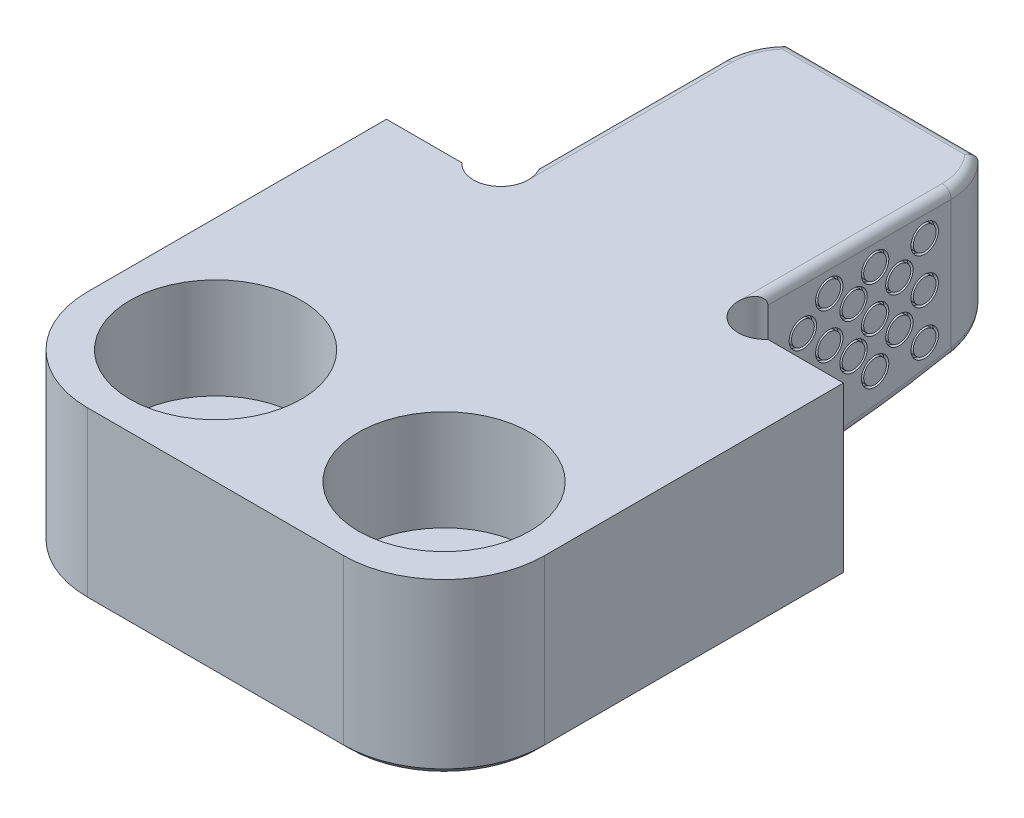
ISO-10303-21;
HEADER;
FILE_DESCRIPTION(('STEP AP214'),'2;1');
FILE_NAME('part.step','',(''),(''),'','','');
FILE_SCHEMA(('AUTOMOTIVE_DESIGN { 1 0 10303 214 1 1 1 1 }'));
ENDSEC;
DATA;
#1=APPLICATION_CONTEXT('core data for automotive mechanical design processes');
#2=APPLICATION_PROTOCOL_DEFINITION('international standard','automotive_design',2000,#1);
#3=PRODUCT_CONTEXT('',#1,'mechanical');
#4=PRODUCT('Part','Part','',(#3));
#5=PRODUCT_RELATED_PRODUCT_CATEGORY('part','',(#4));
#6=PRODUCT_DEFINITION_FORMATION('','',#4);
#7=PRODUCT_DEFINITION_CONTEXT('part definition',#1,'design');
#8=PRODUCT_DEFINITION('design','',#6,#7);
#9=PRODUCT_DEFINITION_SHAPE('','',#8);
#10=(LENGTH_UNIT() NAMED_UNIT(*) SI_UNIT(.MILLI.,.METRE.));
#11=(NAMED_UNIT(*) PLANE_ANGLE_UNIT() SI_UNIT($,.RADIAN.));
#12=(NAMED_UNIT(*) SI_UNIT($,.STERADIAN.) SOLID_ANGLE_UNIT());
#13=UNCERTAINTY_MEASURE_WITH_UNIT(LENGTH_MEASURE(1.E-05),#10,'distance_accuracy_value','');
#14=(GEOMETRIC_REPRESENTATION_CONTEXT(3) GLOBAL_UNCERTAINTY_ASSIGNED_CONTEXT((#13)) GLOBAL_UNIT_ASSIGNED_CONTEXT((#10,
#11,#12)) REPRESENTATION_CONTEXT('',''));
#15=CARTESIAN_POINT('',(0.,0.,0.));
#16=DIRECTION('',(0.,0.,1.));
#17=DIRECTION('',(1.,0.,0.));
#18=AXIS2_PLACEMENT_3D('',#15,#16,#17);
#19=CARTESIAN_POINT('',(-6.34746,-9.4996,0.));
#20=DIRECTION('',(-1.,0.,0.));
#21=DIRECTION('',(0.,0.,1.));
#22=AXIS2_PLACEMENT_3D('',#19,#20,#21);
#23=PLANE('',#22);
#24=CARTESIAN_POINT('',(-6.34746,-5.34571826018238,-4.09726929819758));
#25=DIRECTION('',(1.,0.,0.));
#26=DIRECTION('',(0.,0.,-1.));
#27=AXIS2_PLACEMENT_3D('',#24,#25,#26);
#28=CIRCLE('',#27,0.761999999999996);
#29=CARTESIAN_POINT('',(-6.34746,-5.34571826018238,-4.85926929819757));
#30=VERTEX_POINT('',#29);
#31=EDGE_CURVE('E615',#30,#30,#28,.T.);
#32=ORIENTED_EDGE('',*,*,#31,.T.);
#33=EDGE_LOOP('',(#32));
#34=FACE_BOUND('',#33,.T.);
#35=CARTESIAN_POINT('',(-6.34746,-2.82891262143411,-4.09726929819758));
#36=DIRECTION('',(1.,0.,0.));
#37=DIRECTION('',(0.,0.,-1.));
#38=AXIS2_PLACEMENT_3D('',#35,#36,#37);
#39=CIRCLE('',#38,0.761999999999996);
#40=CARTESIAN_POINT('',(-6.34746,-2.82891262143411,-4.85926929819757));
#41=VERTEX_POINT('',#40);
#42=EDGE_CURVE('E612',#41,#41,#39,.T.);
#43=ORIENTED_EDGE('',*,*,#42,.T.);
#44=EDGE_LOOP('',(#43));
#45=FACE_BOUND('',#44,.T.);
#46=CARTESIAN_POINT('',(-6.34746,-6.66404502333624,-5.56540592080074));
#47=DIRECTION('',(1.,0.,0.));
#48=DIRECTION('',(0.,0.,-1.));
#49=AXIS2_PLACEMENT_3D('',#46,#47,#48);
#50=CIRCLE('',#49,0.761999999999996);
#51=CARTESIAN_POINT('',(-6.34746,-6.66404502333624,-6.32740592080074));
#52=VERTEX_POINT('',#51);
#53=EDGE_CURVE('E628',#52,#52,#50,.T.);
#54=ORIENTED_EDGE('',*,*,#53,.T.);
#55=EDGE_LOOP('',(#54));
#56=FACE_BOUND('',#55,.T.);
#57=CARTESIAN_POINT('',(-6.34746,-4.14723938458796,-5.56540592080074));
#58=DIRECTION('',(1.,0.,0.));
#59=DIRECTION('',(0.,0.,-1.));
#60=AXIS2_PLACEMENT_3D('',#57,#58,#59);
#61=CIRCLE('',#60,0.761999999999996);
#62=CARTESIAN_POINT('',(-6.34746,-4.14723938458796,-6.32740592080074));
#63=VERTEX_POINT('',#62);
#64=EDGE_CURVE('E640',#63,#63,#61,.T.);
#65=ORIENTED_EDGE('',*,*,#64,.T.);
#66=EDGE_LOOP('',(#65));
#67=FACE_BOUND('',#66,.T.);
#68=CARTESIAN_POINT('',(-6.34746,-1.64660400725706,-5.56540592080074));
#69=DIRECTION('',(1.,0.,0.));
#70=DIRECTION('',(0.,0.,-1.));
#71=AXIS2_PLACEMENT_3D('',#68,#69,#70);
#72=CIRCLE('',#71,0.761999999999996);
#73=CARTESIAN_POINT('',(-6.34746,-1.64660400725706,-6.32740592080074));
#74=VERTEX_POINT('',#73);
#75=EDGE_CURVE('E652',#74,#74,#72,.T.);
#76=ORIENTED_EDGE('',*,*,#75,.T.);
#77=EDGE_LOOP('',(#76));
#78=FACE_BOUND('',#77,.T.);
#79=CARTESIAN_POINT('',(-6.34746,-5.34571826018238,-6.91369465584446));
#80=DIRECTION('',(1.,0.,0.));
#81=DIRECTION('',(0.,0.,-1.));
#82=AXIS2_PLACEMENT_3D('',#79,#80,#81);
#83=CIRCLE('',#82,0.761999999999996);
#84=CARTESIAN_POINT('',(-6.34746,-5.34571826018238,-7.67569465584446));
#85=VERTEX_POINT('',#84);
#86=EDGE_CURVE('E664',#85,#85,#83,.T.);
#87=ORIENTED_EDGE('',*,*,#86,.T.);
#88=EDGE_LOOP('',(#87));
#89=FACE_BOUND('',#88,.T.);
#90=CARTESIAN_POINT('',(-6.34746,-2.82891262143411,-6.91369465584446));
#91=DIRECTION('',(1.,0.,0.));
#92=DIRECTION('',(0.,0.,-1.));
#93=AXIS2_PLACEMENT_3D('',#90,#91,#92);
#94=CIRCLE('',#93,0.761999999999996);
#95=CARTESIAN_POINT('',(-6.34746,-2.82891262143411,-7.67569465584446));
#96=VERTEX_POINT('',#95);
#97=EDGE_CURVE('E676',#96,#96,#94,.T.);
#98=ORIENTED_EDGE('',*,*,#97,.T.);
#99=EDGE_LOOP('',(#98));
#100=FACE_BOUND('',#99,.T.);
#101=CARTESIAN_POINT('',(-6.34746,-6.66404502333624,-8.11217353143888));
#102=DIRECTION('',(1.,0.,0.));
#103=DIRECTION('',(0.,0.,-1.));
#104=AXIS2_PLACEMENT_3D('',#101,#102,#103);
#105=CIRCLE('',#104,0.761999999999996);
#106=CARTESIAN_POINT('',(-6.34746,-6.66404502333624,-8.87417353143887));
#107=VERTEX_POINT('',#106);
#108=EDGE_CURVE('E688',#107,#107,#105,.T.);
#109=ORIENTED_EDGE('',*,*,#108,.T.);
#110=EDGE_LOOP('',(#109));
#111=FACE_BOUND('',#110,.T.);
#112=CARTESIAN_POINT('',(-6.34746,-4.14723938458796,-8.11217353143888));
#113=DIRECTION('',(1.,0.,0.));
#114=DIRECTION('',(0.,0.,-1.));
#115=AXIS2_PLACEMENT_3D('',#112,#113,#114);
#116=CIRCLE('',#115,0.761999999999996);
#117=CARTESIAN_POINT('',(-6.34746,-4.14723938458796,-8.87417353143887));
#118=VERTEX_POINT('',#117);
#119=EDGE_CURVE('E700',#118,#118,#116,.T.);
#120=ORIENTED_EDGE('',*,*,#119,.T.);
#121=EDGE_LOOP('',(#120));
#122=FACE_BOUND('',#121,.T.);
#123=CARTESIAN_POINT('',(-6.34746,-1.64660400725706,-8.11217353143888));
#124=DIRECTION('',(1.,0.,0.));
#125=DIRECTION('',(0.,0.,-1.));
#126=AXIS2_PLACEMENT_3D('',#123,#124,#125);
#127=CIRCLE('',#126,0.761999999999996);
#128=CARTESIAN_POINT('',(-6.34746,-1.64660400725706,-8.87417353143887));
#129=VERTEX_POINT('',#128);
#130=EDGE_CURVE('E712',#129,#129,#127,.T.);
#131=ORIENTED_EDGE('',*,*,#130,.T.);
#132=EDGE_LOOP('',(#131));
#133=FACE_BOUND('',#132,.T.);
#134=CARTESIAN_POINT('',(-6.34746,-6.66404502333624,-10.868674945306));
#135=DIRECTION('',(1.,0.,0.));
#136=DIRECTION('',(0.,0.,-1.));
#137=AXIS2_PLACEMENT_3D('',#134,#135,#136);
#138=CIRCLE('',#137,0.761999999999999);
#139=CARTESIAN_POINT('',(-6.34746,-6.66404502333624,-11.630674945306));
#140=VERTEX_POINT('',#139);
#141=EDGE_CURVE('E724',#140,#140,#138,.T.);
#142=ORIENTED_EDGE('',*,*,#141,.T.);
#143=EDGE_LOOP('',(#142));
#144=FACE_BOUND('',#143,.T.);
#145=CARTESIAN_POINT('',(-6.34746,-4.14723938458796,-10.868674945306));
#146=DIRECTION('',(1.,0.,0.));
#147=DIRECTION('',(0.,0.,-1.));
#148=AXIS2_PLACEMENT_3D('',#145,#146,#147);
#149=CIRCLE('',#148,0.761999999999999);
#150=CARTESIAN_POINT('',(-6.34746,-4.14723938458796,-11.630674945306));
#151=VERTEX_POINT('',#150);
#152=EDGE_CURVE('E736',#151,#151,#149,.T.);
#153=ORIENTED_EDGE('',*,*,#152,.T.);
#154=EDGE_LOOP('',(#153));
#155=FACE_BOUND('',#154,.T.);
#156=CARTESIAN_POINT('',(-6.34746,-1.64660400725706,-10.868674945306));
#157=DIRECTION('',(1.,0.,0.));
#158=DIRECTION('',(0.,0.,-1.));
#159=AXIS2_PLACEMENT_3D('',#156,#157,#158);
#160=CIRCLE('',#159,0.761999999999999);
#161=CARTESIAN_POINT('',(-6.34746,-1.64660400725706,-11.630674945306));
#162=VERTEX_POINT('',#161);
#163=EDGE_CURVE('E748',#162,#162,#160,.T.);
#164=ORIENTED_EDGE('',*,*,#163,.T.);
#165=EDGE_LOOP('',(#164));
#166=FACE_BOUND('',#165,.T.);
#167=CARTESIAN_POINT('',(-6.34746,-5.34571826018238,-9.4604622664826));
#168=DIRECTION('',(1.,0.,0.));
#169=DIRECTION('',(0.,0.,-1.));
#170=AXIS2_PLACEMENT_3D('',#167,#168,#169);
#171=CIRCLE('',#170,0.761999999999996);
#172=CARTESIAN_POINT('',(-6.34746,-5.34571826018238,-10.2224622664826));
#173=VERTEX_POINT('',#172);
#174=EDGE_CURVE('E760',#173,#173,#171,.T.);
#175=ORIENTED_EDGE('',*,*,#174,.T.);
#176=EDGE_LOOP('',(#175));
#177=FACE_BOUND('',#176,.T.);
#178=CARTESIAN_POINT('',(-6.34746,-2.82891262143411,-9.4604622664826));
#179=DIRECTION('',(1.,0.,0.));
#180=DIRECTION('',(0.,0.,-1.));
#181=AXIS2_PLACEMENT_3D('',#178,#179,#180);
#182=CIRCLE('',#181,0.761999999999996);
#183=CARTESIAN_POINT('',(-6.34746,-2.82891262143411,-10.2224622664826));
#184=VERTEX_POINT('',#183);
#185=EDGE_CURVE('E772',#184,#184,#182,.T.);
#186=ORIENTED_EDGE('',*,*,#185,.T.);
#187=EDGE_LOOP('',(#186));
#188=FACE_BOUND('',#187,.T.);
#189=DIRECTION('',(0.,1.,0.));
#190=VECTOR('',#189,1.);
#191=CARTESIAN_POINT('',(-6.34746,-9.4996,-12.3444));
#192=LINE('',#191,#190);
#193=CARTESIAN_POINT('',(-6.34746,-7.64451927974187,-12.3444));
#194=VERTEX_POINT('',#193);
#195=CARTESIAN_POINT('',(-6.34746,-0.508,-12.3444));
#196=VERTEX_POINT('',#195);
#197=EDGE_CURVE('E1119',#194,#196,#192,.T.);
#198=ORIENTED_EDGE('',*,*,#197,.F.);
#199=CARTESIAN_POINT('',(-6.34746,54.2544,-0.660399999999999));
#200=DIRECTION('',(-1.,0.,0.));
#201=DIRECTION('',(0.,0.,1.));
#202=AXIS2_PLACEMENT_3D('',#199,#200,#201);
#203=CIRCLE('',#202,62.992);
#204=CARTESIAN_POINT('',(-6.34746,-8.71993941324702,-2.15192253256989));
#205=VERTEX_POINT('',#204);
#206=EDGE_CURVE('E1054',#194,#205,#203,.T.);
#207=ORIENTED_EDGE('',*,*,#206,.T.);
#208=DIRECTION('',(0.,1.,0.));
#209=VECTOR('',#208,1.);
#210=CARTESIAN_POINT('',(-6.34746,-9.4996,-2.15192253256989));
#211=LINE('',#210,#209);
#212=CARTESIAN_POINT('',(-6.34746,-0.508,-2.15192253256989));
#213=VERTEX_POINT('',#212);
#214=EDGE_CURVE('E1118',#213,#205,#211,.F.);
#215=ORIENTED_EDGE('',*,*,#214,.F.);
#216=DIRECTION('',(0.,0.,1.));
#217=VECTOR('',#216,1.);
#218=CARTESIAN_POINT('',(-6.34746,-0.508,0.));
#219=LINE('',#218,#217);
#220=EDGE_CURVE('E1111',#213,#196,#219,.F.);
#221=ORIENTED_EDGE('',*,*,#220,.T.);
#222=EDGE_LOOP('',(#198,#207,#215,#221));
#223=FACE_BOUND('',#222,.T.);
#224=ADVANCED_FACE('F35',(#34,#45,#56,#67,#78,#89,#100,#111,#122,#133,#144,#155,#166,#177,#188,
#223),#23,.T.);
#225=CARTESIAN_POINT('',(6.34746,-9.4996,-14.8844));
#226=DIRECTION('',(1.,0.,0.));
#227=DIRECTION('',(0.,0.,-1.));
#228=AXIS2_PLACEMENT_3D('',#225,#226,#227);
#229=PLANE('',#228);
#230=CARTESIAN_POINT('',(6.34746,-5.34571826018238,-4.09726929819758));
#231=DIRECTION('',(1.,0.,0.));
#232=DIRECTION('',(0.,0.,-1.));
#233=AXIS2_PLACEMENT_3D('',#230,#231,#232);
#234=CIRCLE('',#233,0.761999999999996);
#235=CARTESIAN_POINT('',(6.34746,-5.34571826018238,-4.85926929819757));
#236=VERTEX_POINT('',#235);
#237=EDGE_CURVE('E784',#236,#236,#234,.T.);
#238=ORIENTED_EDGE('',*,*,#237,.F.);
#239=EDGE_LOOP('',(#238));
#240=FACE_BOUND('',#239,.T.);
#241=CARTESIAN_POINT('',(6.34746,-2.82891262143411,-4.09726929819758));
#242=DIRECTION('',(1.,0.,0.));
#243=DIRECTION('',(0.,0.,-1.));
#244=AXIS2_PLACEMENT_3D('',#241,#242,#243);
#245=CIRCLE('',#244,0.761999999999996);
#246=CARTESIAN_POINT('',(6.34746,-2.82891262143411,-4.85926929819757));
#247=VERTEX_POINT('',#246);
#248=EDGE_CURVE('E796',#247,#247,#245,.T.);
#249=ORIENTED_EDGE('',*,*,#248,.F.);
#250=EDGE_LOOP('',(#249));
#251=FACE_BOUND('',#250,.T.);
#252=CARTESIAN_POINT('',(6.34746,-6.66404502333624,-5.56540592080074));
#253=DIRECTION('',(1.,0.,0.));
#254=DIRECTION('',(0.,0.,-1.));
#255=AXIS2_PLACEMENT_3D('',#252,#253,#254);
#256=CIRCLE('',#255,0.761999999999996);
#257=CARTESIAN_POINT('',(6.34746,-6.66404502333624,-6.32740592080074));
#258=VERTEX_POINT('',#257);
#259=EDGE_CURVE('E808',#258,#258,#256,.T.);
#260=ORIENTED_EDGE('',*,*,#259,.F.);
#261=EDGE_LOOP('',(#260));
#262=FACE_BOUND('',#261,.T.);
#263=CARTESIAN_POINT('',(6.34746,-4.14723938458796,-5.56540592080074));
#264=DIRECTION('',(1.,0.,0.));
#265=DIRECTION('',(0.,0.,-1.));
#266=AXIS2_PLACEMENT_3D('',#263,#264,#265);
#267=CIRCLE('',#266,0.761999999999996);
#268=CARTESIAN_POINT('',(6.34746,-4.14723938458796,-6.32740592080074));
#269=VERTEX_POINT('',#268);
#270=EDGE_CURVE('E820',#269,#269,#267,.T.);
#271=ORIENTED_EDGE('',*,*,#270,.F.);
#272=EDGE_LOOP('',(#271));
#273=FACE_BOUND('',#272,.T.);
#274=CARTESIAN_POINT('',(6.34746,-1.64660400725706,-5.56540592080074));
#275=DIRECTION('',(1.,0.,0.));
#276=DIRECTION('',(0.,0.,-1.));
#277=AXIS2_PLACEMENT_3D('',#274,#275,#276);
#278=CIRCLE('',#277,0.761999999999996);
#279=CARTESIAN_POINT('',(6.34746,-1.64660400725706,-6.32740592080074));
#280=VERTEX_POINT('',#279);
#281=EDGE_CURVE('E832',#280,#280,#278,.T.);
#282=ORIENTED_EDGE('',*,*,#281,.F.);
#283=EDGE_LOOP('',(#282));
#284=FACE_BOUND('',#283,.T.);
#285=CARTESIAN_POINT('',(6.34746,-5.34571826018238,-6.91369465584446));
#286=DIRECTION('',(1.,0.,0.));
#287=DIRECTION('',(0.,0.,-1.));
#288=AXIS2_PLACEMENT_3D('',#285,#286,#287);
#289=CIRCLE('',#288,0.761999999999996);
#290=CARTESIAN_POINT('',(6.34746,-5.34571826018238,-7.67569465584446));
#291=VERTEX_POINT('',#290);
#292=EDGE_CURVE('E844',#291,#291,#289,.T.);
#293=ORIENTED_EDGE('',*,*,#292,.F.);
#294=EDGE_LOOP('',(#293));
#295=FACE_BOUND('',#294,.T.);
#296=CARTESIAN_POINT('',(6.34746,-2.82891262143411,-6.91369465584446));
#297=DIRECTION('',(1.,0.,0.));
#298=DIRECTION('',(0.,0.,-1.));
#299=AXIS2_PLACEMENT_3D('',#296,#297,#298);
#300=CIRCLE('',#299,0.761999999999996);
#301=CARTESIAN_POINT('',(6.34746,-2.82891262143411,-7.67569465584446));
#302=VERTEX_POINT('',#301);
#303=EDGE_CURVE('E856',#302,#302,#300,.T.);
#304=ORIENTED_EDGE('',*,*,#303,.F.);
#305=EDGE_LOOP('',(#304));
#306=FACE_BOUND('',#305,.T.);
#307=CARTESIAN_POINT('',(6.34746,-6.66404502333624,-8.11217353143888));
#308=DIRECTION('',(1.,0.,0.));
#309=DIRECTION('',(0.,0.,-1.));
#310=AXIS2_PLACEMENT_3D('',#307,#308,#309);
#311=CIRCLE('',#310,0.761999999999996);
#312=CARTESIAN_POINT('',(6.34746,-6.66404502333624,-8.87417353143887));
#313=VERTEX_POINT('',#312);
#314=EDGE_CURVE('E868',#313,#313,#311,.T.);
#315=ORIENTED_EDGE('',*,*,#314,.F.);
#316=EDGE_LOOP('',(#315));
#317=FACE_BOUND('',#316,.T.);
#318=CARTESIAN_POINT('',(6.34746,-4.14723938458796,-8.11217353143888));
#319=DIRECTION('',(1.,0.,0.));
#320=DIRECTION('',(0.,0.,-1.));
#321=AXIS2_PLACEMENT_3D('',#318,#319,#320);
#322=CIRCLE('',#321,0.761999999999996);
#323=CARTESIAN_POINT('',(6.34746,-4.14723938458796,-8.87417353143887));
#324=VERTEX_POINT('',#323);
#325=EDGE_CURVE('E880',#324,#324,#322,.T.);
#326=ORIENTED_EDGE('',*,*,#325,.F.);
#327=EDGE_LOOP('',(#326));
#328=FACE_BOUND('',#327,.T.);
#329=CARTESIAN_POINT('',(6.34746,-1.64660400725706,-8.11217353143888));
#330=DIRECTION('',(1.,0.,0.));
#331=DIRECTION('',(0.,0.,-1.));
#332=AXIS2_PLACEMENT_3D('',#329,#330,#331);
#333=CIRCLE('',#332,0.761999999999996);
#334=CARTESIAN_POINT('',(6.34746,-1.64660400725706,-8.87417353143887));
#335=VERTEX_POINT('',#334);
#336=EDGE_CURVE('E892',#335,#335,#333,.T.);
#337=ORIENTED_EDGE('',*,*,#336,.F.);
#338=EDGE_LOOP('',(#337));
#339=FACE_BOUND('',#338,.T.);
#340=CARTESIAN_POINT('',(6.34746,-6.66404502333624,-10.868674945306));
#341=DIRECTION('',(1.,0.,0.));
#342=DIRECTION('',(0.,0.,-1.));
#343=AXIS2_PLACEMENT_3D('',#340,#341,#342);
#344=CIRCLE('',#343,0.761999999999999);
#345=CARTESIAN_POINT('',(6.34746,-6.66404502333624,-11.630674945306));
#346=VERTEX_POINT('',#345);
#347=EDGE_CURVE('E904',#346,#346,#344,.T.);
#348=ORIENTED_EDGE('',*,*,#347,.F.);
#349=EDGE_LOOP('',(#348));
#350=FACE_BOUND('',#349,.T.);
#351=CARTESIAN_POINT('',(6.34746,-4.14723938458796,-10.868674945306));
#352=DIRECTION('',(1.,0.,0.));
#353=DIRECTION('',(0.,0.,-1.));
#354=AXIS2_PLACEMENT_3D('',#351,#352,#353);
#355=CIRCLE('',#354,0.761999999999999);
#356=CARTESIAN_POINT('',(6.34746,-4.14723938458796,-11.630674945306));
#357=VERTEX_POINT('',#356);
#358=EDGE_CURVE('E916',#357,#357,#355,.T.);
#359=ORIENTED_EDGE('',*,*,#358,.F.);
#360=EDGE_LOOP('',(#359));
#361=FACE_BOUND('',#360,.T.);
#362=CARTESIAN_POINT('',(6.34746,-1.64660400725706,-10.868674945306));
#363=DIRECTION('',(1.,0.,0.));
#364=DIRECTION('',(0.,0.,-1.));
#365=AXIS2_PLACEMENT_3D('',#362,#363,#364);
#366=CIRCLE('',#365,0.761999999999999);
#367=CARTESIAN_POINT('',(6.34746,-1.64660400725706,-11.630674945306));
#368=VERTEX_POINT('',#367);
#369=EDGE_CURVE('E928',#368,#368,#366,.T.);
#370=ORIENTED_EDGE('',*,*,#369,.F.);
#371=EDGE_LOOP('',(#370));
#372=FACE_BOUND('',#371,.T.);
#373=CARTESIAN_POINT('',(6.34746,-5.34571826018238,-9.4604622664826));
#374=DIRECTION('',(1.,0.,0.));
#375=DIRECTION('',(0.,0.,-1.));
#376=AXIS2_PLACEMENT_3D('',#373,#374,#375);
#377=CIRCLE('',#376,0.761999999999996);
#378=CARTESIAN_POINT('',(6.34746,-5.34571826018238,-10.2224622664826));
#379=VERTEX_POINT('',#378);
#380=EDGE_CURVE('E940',#379,#379,#377,.T.);
#381=ORIENTED_EDGE('',*,*,#380,.F.);
#382=EDGE_LOOP('',(#381));
#383=FACE_BOUND('',#382,.T.);
#384=CARTESIAN_POINT('',(6.34746,-2.82891262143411,-9.4604622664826));
#385=DIRECTION('',(1.,0.,0.));
#386=DIRECTION('',(0.,0.,-1.));
#387=AXIS2_PLACEMENT_3D('',#384,#385,#386);
#388=CIRCLE('',#387,0.761999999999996);
#389=CARTESIAN_POINT('',(6.34746,-2.82891262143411,-10.2224622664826));
#390=VERTEX_POINT('',#389);
#391=EDGE_CURVE('E952',#390,#390,#388,.T.);
#392=ORIENTED_EDGE('',*,*,#391,.F.);
#393=EDGE_LOOP('',(#392));
#394=FACE_BOUND('',#393,.T.);
#395=DIRECTION('',(0.,1.,0.));
#396=VECTOR('',#395,1.);
#397=CARTESIAN_POINT('',(6.34746,-9.4996,-12.3444));
#398=LINE('',#397,#396);
#399=CARTESIAN_POINT('',(6.34746,-7.64451927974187,-12.3444));
#400=VERTEX_POINT('',#399);
#401=CARTESIAN_POINT('',(6.34746,-0.508,-12.3444));
#402=VERTEX_POINT('',#401);
#403=EDGE_CURVE('E1211',#400,#402,#398,.T.);
#404=ORIENTED_EDGE('',*,*,#403,.T.);
#405=DIRECTION('',(0.,0.,-1.));
#406=VECTOR('',#405,1.);
#407=CARTESIAN_POINT('',(6.34746,-0.508,-14.8844));
#408=LINE('',#407,#406);
#409=CARTESIAN_POINT('',(6.34746,-0.508,-2.15192253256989));
#410=VERTEX_POINT('',#409);
#411=EDGE_CURVE('E1106',#402,#410,#408,.F.);
#412=ORIENTED_EDGE('',*,*,#411,.T.);
#413=DIRECTION('',(0.,1.,0.));
#414=VECTOR('',#413,1.);
#415=CARTESIAN_POINT('',(6.34746,-9.4996,-2.15192253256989));
#416=LINE('',#415,#414);
#417=CARTESIAN_POINT('',(6.34746,-8.71993941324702,-2.15192253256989));
#418=VERTEX_POINT('',#417);
#419=EDGE_CURVE('E1208',#418,#410,#416,.T.);
#420=ORIENTED_EDGE('',*,*,#419,.F.);
#421=CARTESIAN_POINT('',(6.34746,54.2544,-0.660399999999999));
#422=DIRECTION('',(1.,0.,0.));
#423=DIRECTION('',(0.,0.,-1.));
#424=AXIS2_PLACEMENT_3D('',#421,#422,#423);
#425=CIRCLE('',#424,62.992);
#426=EDGE_CURVE('E1280',#418,#400,#425,.T.);
#427=ORIENTED_EDGE('',*,*,#426,.T.);
#428=EDGE_LOOP('',(#404,#412,#420,#427));
#429=FACE_BOUND('',#428,.T.);
#430=ADVANCED_FACE('F351',(#240,#251,#262,#273,#284,#295,#306,#317,#328,#339,#350,#361,#372,
#383,#394,#429),#229,.T.);
#431=CARTESIAN_POINT('',(-12.7,-9.4996,0.));
#432=DIRECTION('',(-1.,0.,0.));
#433=DIRECTION('',(0.,0.,1.));
#434=AXIS2_PLACEMENT_3D('',#431,#432,#433);
#435=PLANE('',#434);
#436=DIRECTION('',(0.,1.,0.));
#437=VECTOR('',#436,1.);
#438=CARTESIAN_POINT('',(-12.7,-9.4996,0.));
#439=LINE('',#438,#437);
#440=CARTESIAN_POINT('',(-12.7,-9.11859999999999,0.));
#441=VERTEX_POINT('',#440);
#442=CARTESIAN_POINT('',(-12.7,0.,0.));
#443=VERTEX_POINT('',#442);
#444=EDGE_CURVE('E1188',#441,#443,#439,.T.);
#445=ORIENTED_EDGE('',*,*,#444,.F.);
#446=DIRECTION('',(0.,0.,1.));
#447=VECTOR('',#446,1.);
#448=CARTESIAN_POINT('',(-12.7,-9.11859999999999,16.6116));
#449=LINE('',#448,#447);
#450=CARTESIAN_POINT('',(-12.7,-9.11859999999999,16.6116));
#451=VERTEX_POINT('',#450);
#452=EDGE_CURVE('E1060',#441,#451,#449,.T.);
#453=ORIENTED_EDGE('',*,*,#452,.T.);
#454=DIRECTION('',(0.,1.,0.));
#455=VECTOR('',#454,1.);
#456=CARTESIAN_POINT('',(-12.7,-9.4996,16.6116));
#457=LINE('',#456,#455);
#458=CARTESIAN_POINT('',(-12.7,0.,16.6116));
#459=VERTEX_POINT('',#458);
#460=EDGE_CURVE('E227',#451,#459,#457,.T.);
#461=ORIENTED_EDGE('',*,*,#460,.T.);
#462=DIRECTION('',(0.,0.,1.));
#463=VECTOR('',#462,1.);
#464=CARTESIAN_POINT('',(-12.7,0.,0.));
#465=LINE('',#464,#463);
#466=EDGE_CURVE('E1215',#443,#459,#465,.T.);
#467=ORIENTED_EDGE('',*,*,#466,.F.);
#468=EDGE_LOOP('',(#445,#453,#461,#467));
#469=FACE_BOUND('',#468,.T.);
#470=ADVANCED_FACE('F355',(#469),#435,.T.);
#471=CARTESIAN_POINT('',(-6.34746,-9.4996,0.));
#472=DIRECTION('',(0.,0.,-1.));
#473=DIRECTION('',(-1.,0.,0.));
#474=AXIS2_PLACEMENT_3D('',#471,#472,#473);
#475=PLANE('',#474);
#476=DIRECTION('',(-1.,0.,0.));
#477=VECTOR('',#476,1.);
#478=CARTESIAN_POINT('',(-6.34746,-9.4996,0.));
#479=LINE('',#478,#477);
#480=CARTESIAN_POINT('',(-8.49938253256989,-9.4996,0.));
#481=VERTEX_POINT('',#480);
#482=CARTESIAN_POINT('',(-12.319,-9.4996,0.));
#483=VERTEX_POINT('',#482);
#484=EDGE_CURVE('E1189',#481,#483,#479,.T.);
#485=ORIENTED_EDGE('',*,*,#484,.T.);
#486=DIRECTION('',(-0.707106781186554,0.707106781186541,0.));
#487=VECTOR('',#486,1.);
#488=CARTESIAN_POINT('',(-9.33322999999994,-12.48537,0.));
#489=LINE('',#488,#487);
#490=EDGE_CURVE('E1153',#483,#441,#489,.T.);
#491=ORIENTED_EDGE('',*,*,#490,.T.);
#492=ORIENTED_EDGE('',*,*,#444,.T.);
#493=DIRECTION('',(-1.,0.,0.));
#494=VECTOR('',#493,1.);
#495=CARTESIAN_POINT('',(-6.34746,0.,0.));
#496=LINE('',#495,#494);
#497=CARTESIAN_POINT('',(-8.49938253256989,0.,0.));
#498=VERTEX_POINT('',#497);
#499=EDGE_CURVE('E1222',#498,#443,#496,.T.);
#500=ORIENTED_EDGE('',*,*,#499,.F.);
#501=DIRECTION('',(0.,1.,0.));
#502=VECTOR('',#501,1.);
#503=CARTESIAN_POINT('',(-8.49938253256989,-9.4996,0.));
#504=LINE('',#503,#502);
#505=EDGE_CURVE('E1124',#481,#498,#504,.T.);
#506=ORIENTED_EDGE('',*,*,#505,.F.);
#507=EDGE_LOOP('',(#485,#491,#492,#500,#506));
#508=FACE_BOUND('',#507,.T.);
#509=ADVANCED_FACE('F348',(#508),#475,.T.);
#510=CARTESIAN_POINT('',(-6.34746,-9.4996,-14.8844));
#511=DIRECTION('',(0.,0.,-1.));
#512=DIRECTION('',(-1.,0.,0.));
#513=AXIS2_PLACEMENT_3D('',#510,#511,#512);
#514=PLANE('',#513);
#515=DIRECTION('',(-1.,0.,0.));
#516=VECTOR('',#515,1.);
#517=CARTESIAN_POINT('',(-5.29505001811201,-7.22619375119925,-14.8844));
#518=LINE('',#517,#516);
#519=CARTESIAN_POINT('',(5.29351778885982,-7.22619375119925,-14.8844));
#520=VERTEX_POINT('',#519);
#521=CARTESIAN_POINT('',(-5.29351778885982,-7.22619375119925,-14.8844));
#522=VERTEX_POINT('',#521);
#523=EDGE_CURVE('E329',#520,#522,#518,.T.);
#524=ORIENTED_EDGE('',*,*,#523,.T.);
#525=CARTESIAN_POINT('',(-6.2685923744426,-7.76237381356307,-11.5958921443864));
#526=CARTESIAN_POINT('',(-6.2874313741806,-8.28147287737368,-11.6842971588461));
#527=CARTESIAN_POINT('',(-5.77174824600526,-8.26250908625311,-11.7908123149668));
#528=CARTESIAN_POINT('',(-6.29481673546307,-7.74357263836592,-11.7189137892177));
#529=CARTESIAN_POINT('',(-6.31069568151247,-8.25953427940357,-11.8085922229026));
#530=CARTESIAN_POINT('',(-5.79426315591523,-8.24355628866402,-11.8972842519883));
#531=CARTESIAN_POINT('',(-6.31452549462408,-7.724299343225,-11.843158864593));
#532=CARTESIAN_POINT('',(-6.32738748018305,-8.23699144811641,-11.9341460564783));
#533=CARTESIAN_POINT('',(-5.81118409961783,-8.2241275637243,-12.0048150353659));
#534=CARTESIAN_POINT('',(-6.34086029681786,-7.68495585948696,-12.0930699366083));
#535=CARTESIAN_POINT('',(-6.34739733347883,-8.19099383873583,-12.1860201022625));
#536=CARTESIAN_POINT('',(-5.83379382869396,-8.18446679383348,-12.2211063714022));
#537=CARTESIAN_POINT('',(-6.34746508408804,-7.66488442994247,-12.2187379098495));
#538=CARTESIAN_POINT('',(-6.35077310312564,-8.16755116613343,-12.312293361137));
#539=CARTESIAN_POINT('',(-5.8394643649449,-8.16423349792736,-12.3298686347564));
#540=CARTESIAN_POINT('',(-6.34745168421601,-7.61120904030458,-12.5499390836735));
#541=CARTESIAN_POINT('',(-6.34208703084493,-8.1050305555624,-12.6435033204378));
#542=CARTESIAN_POINT('',(-5.83945286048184,-8.11012524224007,-12.6165143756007));
#543=CARTESIAN_POINT('',(-6.32975966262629,-7.57711299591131,-12.755462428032));
#544=CARTESIAN_POINT('',(-6.31912699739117,-8.06531478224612,-12.8484241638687));
#545=CARTESIAN_POINT('',(-5.82426338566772,-8.07575422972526,-12.7943893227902));
#546=CARTESIAN_POINT('',(-6.25956974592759,-7.5084173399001,-13.1604097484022));
#547=CARTESIAN_POINT('',(-6.23855830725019,-7.98543509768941,-13.2503016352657));
#548=CARTESIAN_POINT('',(-5.76400187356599,-8.00650457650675,-13.1448603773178));
#549=CARTESIAN_POINT('',(-6.20704921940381,-7.47381741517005,-13.3598296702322));
#550=CARTESIAN_POINT('',(-6.18132061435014,-7.94529056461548,-13.4472657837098));
#551=CARTESIAN_POINT('',(-5.71891040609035,-7.97162562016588,-13.3174529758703));
#552=CARTESIAN_POINT('',(-6.06865700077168,-7.40528713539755,-13.7469138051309));
#553=CARTESIAN_POINT('',(-6.03429320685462,-7.8659701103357,-13.8277387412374));
#554=CARTESIAN_POINT('',(-5.60009384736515,-7.90254267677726,-13.6524639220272));
#555=CARTESIAN_POINT('',(-5.98278944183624,-7.37135669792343,-13.9345794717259));
#556=CARTESIAN_POINT('',(-5.94485907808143,-7.82678175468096,-14.0114043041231));
#557=CARTESIAN_POINT('',(-5.52637230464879,-7.8683386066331,-13.8148835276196));
#558=CARTESIAN_POINT('',(-5.78002611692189,-7.30543810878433,-14.2927615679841));
#559=CARTESIAN_POINT('',(-5.73630701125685,-7.7508674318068,-14.3602686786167));
#560=CARTESIAN_POINT('',(-5.35228997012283,-7.80188841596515,-14.1248805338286));
#561=CARTESIAN_POINT('',(-5.66313631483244,-7.27344958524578,-14.4632812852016));
#562=CARTESIAN_POINT('',(-5.61745255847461,-7.71409617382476,-14.5257517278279));
#563=CARTESIAN_POINT('',(-5.25193429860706,-7.76964192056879,-14.2724607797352));
#564=CARTESIAN_POINT('',(-5.4018911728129,-7.21284007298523,-14.7815670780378));
#565=CARTESIAN_POINT('',(-5.35399342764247,-7.64464151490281,-14.8332178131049));
#566=CARTESIAN_POINT('',(-5.02764243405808,-7.70854362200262,-14.5479286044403));
#567=CARTESIAN_POINT('',(-5.25766365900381,-7.1842043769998,-14.9294334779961));
#568=CARTESIAN_POINT('',(-5.20963929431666,-7.61187161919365,-14.9756595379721));
#569=CARTESIAN_POINT('',(-4.90381598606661,-7.67967699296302,-14.6759030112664));
#570=CARTESIAN_POINT('',(-5.02352088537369,-7.14462256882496,-15.1313993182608));
#571=CARTESIAN_POINT('',(-4.9762440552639,-7.56662783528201,-15.1697813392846));
#572=CARTESIAN_POINT('',(-4.70279284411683,-7.63977597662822,-14.8506990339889));
#573=CARTESIAN_POINT('',(-4.94240255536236,-7.13197796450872,-15.195478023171));
#574=CARTESIAN_POINT('',(-4.89576860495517,-7.55221459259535,-15.2311661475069));
#575=CARTESIAN_POINT('',(-4.63314874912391,-7.62702939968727,-14.9061574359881));
#576=CARTESIAN_POINT('',(-4.77476342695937,-7.10795976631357,-15.3165282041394));
#577=CARTESIAN_POINT('',(-4.72989255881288,-7.52487267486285,-15.3469237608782));
#578=CARTESIAN_POINT('',(-4.48922227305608,-7.60281750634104,-15.0109231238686));
#579=CARTESIAN_POINT('',(-4.68824161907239,-7.09658641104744,-15.3734983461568));
#580=CARTESIAN_POINT('',(-4.64447682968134,-7.51193329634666,-15.4013444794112));
#581=CARTESIAN_POINT('',(-4.41493902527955,-7.59135243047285,-15.0602292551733));
#582=CARTESIAN_POINT('',(-4.59928263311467,-7.08591692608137,-15.4266954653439));
#583=CARTESIAN_POINT('',(-4.55669332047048,-7.49978937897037,-15.4521634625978));
#584=CARTESIAN_POINT('',(-4.33856333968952,-7.5805969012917,-15.1062699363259));
#585=(BOUNDED_SURFACE() B_SPLINE_SURFACE(3,2,((#525,#526,#527),(#528,#529,#530),(#531,#532,
#533),(#534,#535,#536),(#537,#538,#539),(#540,#541,#542),(#543,#544,#545),(#546,#547,#548),
(#549,#550,#551),(#552,#553,#554),(#555,#556,#557),(#558,#559,#560),(#561,#562,#563),(#564,#565,
#566),(#567,#568,#569),(#570,#571,#572),(#573,#574,#575),(#576,#577,#578),(#579,#580,#581),
(#582,#583,#584)),.UNSPECIFIED.,.F.,.F.,.F.) B_SPLINE_SURFACE_WITH_KNOTS((4,2,2,2,2,2,2,2,2,4),
(3,3),(0.,0.328598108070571,0.657728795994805,1.19607110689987,1.73476357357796,
2.27338929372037,2.81191154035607,3.34797524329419,3.61662721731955,3.88532953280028),(0.,1.),
.UNSPECIFIED.) GEOMETRIC_REPRESENTATION_ITEM() RATIONAL_B_SPLINE_SURFACE(((1.,0.694070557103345,
1.),(1.,0.696106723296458,1.),(1.,0.698217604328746,1.),(1.,0.70257019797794,1.),(1.,
0.704812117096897,1.),(1.,0.710860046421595,1.),(1.,0.714754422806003,1.),(1.,0.722684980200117,
1.),(1.,0.726721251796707,1.),(1.,0.73477592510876,1.),(1.,0.738794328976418,1.),(1.,
0.746640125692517,1.),(1.,0.750467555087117,1.),(1.,0.757741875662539,1.),(1.,0.761190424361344,
1.),(1.,0.765965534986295,1.),(1.,0.767492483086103,1.),(1.,0.770394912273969,1.),(1.,
0.771770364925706,1.),(1.,0.77306125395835,1.))) REPRESENTATION_ITEM('') SURFACE());
#586=CARTESIAN_POINT('',(-5.29351778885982,-7.22619375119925,-14.8844));
#587=CARTESIAN_POINT('',(-5.29401527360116,-7.22064377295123,-14.8844));
#588=CARTESIAN_POINT('',(-5.29439170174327,-7.21508823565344,-14.8844));
#589=CARTESIAN_POINT('',(-5.29490244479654,-7.20396604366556,-14.8844));
#590=CARTESIAN_POINT('',(-5.29503675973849,-7.19839938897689,-14.8844));
#591=CARTESIAN_POINT('',(-5.29505001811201,-7.19282717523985,-14.8844));
#592=B_SPLINE_CURVE_WITH_KNOTS('',3,(#586,#587,#588,#589,#590,#591),.UNSPECIFIED.,.F.,.F.,(4,2,
4),(0.,0.0167048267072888,0.0334096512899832),.UNSPECIFIED.);
#593=CARTESIAN_POINT('',(-5.29505001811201,-7.19282717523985,-14.8844));
#594=VERTEX_POINT('',#593);
#595=EDGE_CURVE('E337',#522,#594,#592,.T.);
#596=ORIENTED_EDGE('',*,*,#595,.T.);
#597=DIRECTION('',(0.,1.,0.));
#598=VECTOR('',#597,1.);
#599=CARTESIAN_POINT('',(-5.29505001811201,-9.4996,-14.8844));
#600=LINE('',#599,#598);
#601=CARTESIAN_POINT('',(-5.29505001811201,-0.508,-14.8844));
#602=VERTEX_POINT('',#601);
#603=EDGE_CURVE('E1216',#594,#602,#600,.T.);
#604=ORIENTED_EDGE('',*,*,#603,.T.);
#605=DIRECTION('',(-1.,0.,0.));
#606=VECTOR('',#605,1.);
#607=CARTESIAN_POINT('',(-6.34746,-0.508,-14.8844));
#608=LINE('',#607,#606);
#609=CARTESIAN_POINT('',(5.29505001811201,-0.508,-14.8844));
#610=VERTEX_POINT('',#609);
#611=EDGE_CURVE('E327',#602,#610,#608,.F.);
#612=ORIENTED_EDGE('',*,*,#611,.T.);
#613=DIRECTION('',(0.,1.,0.));
#614=VECTOR('',#613,1.);
#615=CARTESIAN_POINT('',(5.29505001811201,-9.4996,-14.8844));
#616=LINE('',#615,#614);
#617=CARTESIAN_POINT('',(5.29505001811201,-7.19282717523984,-14.8844));
#618=VERTEX_POINT('',#617);
#619=EDGE_CURVE('E1212',#618,#610,#616,.T.);
#620=ORIENTED_EDGE('',*,*,#619,.F.);
#621=CARTESIAN_POINT('',(5.77174824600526,-8.2625090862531,-11.7908123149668));
#622=CARTESIAN_POINT('',(6.2874313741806,-8.28147287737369,-11.6842971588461));
#623=CARTESIAN_POINT('',(6.2685923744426,-7.76237381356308,-11.5958921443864));
#624=CARTESIAN_POINT('',(5.79426315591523,-8.24355628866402,-11.8972842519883));
#625=CARTESIAN_POINT('',(6.31069568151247,-8.25953427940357,-11.8085922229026));
#626=CARTESIAN_POINT('',(6.29481673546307,-7.74357263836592,-11.7189137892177));
#627=CARTESIAN_POINT('',(5.81118409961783,-8.2241275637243,-12.0048150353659));
#628=CARTESIAN_POINT('',(6.32738748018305,-8.23699144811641,-11.9341460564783));
#629=CARTESIAN_POINT('',(6.31452549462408,-7.724299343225,-11.843158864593));
#630=CARTESIAN_POINT('',(5.83379382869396,-8.18446679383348,-12.2211063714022));
#631=CARTESIAN_POINT('',(6.34739733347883,-8.19099383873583,-12.1860201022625));
#632=CARTESIAN_POINT('',(6.34086029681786,-7.68495585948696,-12.0930699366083));
#633=CARTESIAN_POINT('',(5.8394643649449,-8.16423349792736,-12.3298686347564));
#634=CARTESIAN_POINT('',(6.35077310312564,-8.16755116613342,-12.312293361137));
#635=CARTESIAN_POINT('',(6.34746508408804,-7.66488442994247,-12.2187379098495));
#636=CARTESIAN_POINT('',(5.83945286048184,-8.11012524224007,-12.6165143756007));
#637=CARTESIAN_POINT('',(6.34208703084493,-8.10503055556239,-12.6435033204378));
#638=CARTESIAN_POINT('',(6.34745168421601,-7.61120904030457,-12.5499390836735));
#639=CARTESIAN_POINT('',(5.82426338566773,-8.07575422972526,-12.7943893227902));
#640=CARTESIAN_POINT('',(6.31912699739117,-8.06531478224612,-12.8484241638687));
#641=CARTESIAN_POINT('',(6.32975966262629,-7.5771129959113,-12.755462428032));
#642=CARTESIAN_POINT('',(5.76400187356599,-8.00650457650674,-13.1448603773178));
#643=CARTESIAN_POINT('',(6.2385583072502,-7.9854350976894,-13.2503016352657));
#644=CARTESIAN_POINT('',(6.25956974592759,-7.50841733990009,-13.1604097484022));
#645=CARTESIAN_POINT('',(5.71891040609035,-7.97162562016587,-13.3174529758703));
#646=CARTESIAN_POINT('',(6.18132061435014,-7.94529056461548,-13.4472657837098));
#647=CARTESIAN_POINT('',(6.20704921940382,-7.47381741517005,-13.3598296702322));
#648=CARTESIAN_POINT('',(5.60009384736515,-7.90254267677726,-13.6524639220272));
#649=CARTESIAN_POINT('',(6.03429320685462,-7.86597011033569,-13.8277387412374));
#650=CARTESIAN_POINT('',(6.06865700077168,-7.40528713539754,-13.7469138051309));
#651=CARTESIAN_POINT('',(5.52637230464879,-7.86833860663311,-13.8148835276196));
#652=CARTESIAN_POINT('',(5.94485907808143,-7.82678175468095,-14.0114043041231));
#653=CARTESIAN_POINT('',(5.98278944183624,-7.37135669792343,-13.9345794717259));
#654=CARTESIAN_POINT('',(5.35228997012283,-7.80188841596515,-14.1248805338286));
#655=CARTESIAN_POINT('',(5.73630701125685,-7.7508674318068,-14.3602686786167));
#656=CARTESIAN_POINT('',(5.78002611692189,-7.30543810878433,-14.2927615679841));
#657=CARTESIAN_POINT('',(5.25193429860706,-7.76964192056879,-14.2724607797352));
#658=CARTESIAN_POINT('',(5.61745255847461,-7.71409617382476,-14.5257517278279));
#659=CARTESIAN_POINT('',(5.66313631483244,-7.27344958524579,-14.4632812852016));
#660=CARTESIAN_POINT('',(5.02764243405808,-7.70854362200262,-14.5479286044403));
#661=CARTESIAN_POINT('',(5.35399342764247,-7.64464151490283,-14.8332178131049));
#662=CARTESIAN_POINT('',(5.4018911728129,-7.21284007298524,-14.7815670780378));
#663=CARTESIAN_POINT('',(4.90381598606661,-7.67967699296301,-14.6759030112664));
#664=CARTESIAN_POINT('',(5.20963929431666,-7.61187161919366,-14.9756595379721));
#665=CARTESIAN_POINT('',(5.25766365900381,-7.18420437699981,-14.9294334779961));
#666=CARTESIAN_POINT('',(4.70279284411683,-7.63977597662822,-14.8506990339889));
#667=CARTESIAN_POINT('',(4.97624405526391,-7.56662783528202,-15.1697813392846));
#668=CARTESIAN_POINT('',(5.02352088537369,-7.14462256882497,-15.1313993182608));
#669=CARTESIAN_POINT('',(4.63314874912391,-7.62702939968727,-14.9061574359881));
#670=CARTESIAN_POINT('',(4.89576860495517,-7.55221459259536,-15.2311661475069));
#671=CARTESIAN_POINT('',(4.94240255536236,-7.13197796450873,-15.195478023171));
#672=CARTESIAN_POINT('',(4.48922227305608,-7.60281750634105,-15.0109231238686));
#673=CARTESIAN_POINT('',(4.72989255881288,-7.52487267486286,-15.3469237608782));
#674=CARTESIAN_POINT('',(4.77476342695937,-7.10795976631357,-15.3165282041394));
#675=CARTESIAN_POINT('',(4.41493902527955,-7.59135243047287,-15.0602292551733));
#676=CARTESIAN_POINT('',(4.64447682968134,-7.51193329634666,-15.4013444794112));
#677=CARTESIAN_POINT('',(4.6882416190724,-7.09658641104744,-15.3734983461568));
#678=CARTESIAN_POINT('',(4.33856333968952,-7.5805969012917,-15.1062699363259));
#679=CARTESIAN_POINT('',(4.55669332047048,-7.49978937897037,-15.4521634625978));
#680=CARTESIAN_POINT('',(4.59928263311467,-7.08591692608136,-15.4266954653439));
#681=(BOUNDED_SURFACE() B_SPLINE_SURFACE(3,2,((#621,#622,#623),(#624,#625,#626),(#627,#628,
#629),(#630,#631,#632),(#633,#634,#635),(#636,#637,#638),(#639,#640,#641),(#642,#643,#644),
(#645,#646,#647),(#648,#649,#650),(#651,#652,#653),(#654,#655,#656),(#657,#658,#659),(#660,#661,
#662),(#663,#664,#665),(#666,#667,#668),(#669,#670,#671),(#672,#673,#674),(#675,#676,#677),
(#678,#679,#680)),.UNSPECIFIED.,.F.,.F.,.F.) B_SPLINE_SURFACE_WITH_KNOTS((4,2,2,2,2,2,2,2,2,4),
(3,3),(0.,0.328598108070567,0.657728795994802,1.19607110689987,1.73476357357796,
2.27338929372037,2.81191154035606,3.34797524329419,3.61662721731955,3.88532953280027),(0.,1.),
.UNSPECIFIED.) GEOMETRIC_REPRESENTATION_ITEM() RATIONAL_B_SPLINE_SURFACE(((1.,0.694070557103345,
1.),(1.,0.696106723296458,1.),(1.,0.698217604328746,1.),(1.,0.70257019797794,1.),(1.,
0.704812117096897,1.),(1.,0.710860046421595,1.),(1.,0.714754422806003,1.),(1.,0.722684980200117,
1.),(1.,0.726721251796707,1.),(1.,0.73477592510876,1.),(1.,0.738794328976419,1.),(1.,
0.746640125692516,1.),(1.,0.750467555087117,1.),(1.,0.757741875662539,1.),(1.,0.761190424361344,
1.),(1.,0.765965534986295,1.),(1.,0.767492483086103,1.),(1.,0.770394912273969,1.),(1.,
0.771770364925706,1.),(1.,0.77306125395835,1.))) REPRESENTATION_ITEM('') SURFACE());
#682=CARTESIAN_POINT('',(5.29505001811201,-7.19282717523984,-14.8844));
#683=CARTESIAN_POINT('',(5.29503675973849,-7.19839938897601,-14.8844));
#684=CARTESIAN_POINT('',(5.29490244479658,-7.2039660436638,-14.8844));
#685=CARTESIAN_POINT('',(5.29439170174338,-7.21508823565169,-14.8844));
#686=CARTESIAN_POINT('',(5.29401527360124,-7.22064377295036,-14.8844));
#687=CARTESIAN_POINT('',(5.29351778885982,-7.22619375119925,-14.8844));
#688=B_SPLINE_CURVE_WITH_KNOTS('',3,(#682,#683,#684,#685,#686,#687),.UNSPECIFIED.,.F.,.F.,(4,2,
4),(0.,0.0167048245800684,0.0334096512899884),.UNSPECIFIED.);
#689=EDGE_CURVE('E331',#618,#520,#688,.T.);
#690=ORIENTED_EDGE('',*,*,#689,.T.);
#691=EDGE_LOOP('',(#524,#596,#604,#612,#620,#690));
#692=FACE_BOUND('',#691,.T.);
#693=ADVANCED_FACE('F342',(#692),#514,.T.);
#694=CARTESIAN_POINT('',(6.34746,-9.4996,0.));
#695=DIRECTION('',(0.,0.,-1.));
#696=DIRECTION('',(-1.,0.,0.));
#697=AXIS2_PLACEMENT_3D('',#694,#695,#696);
#698=PLANE('',#697);
#699=DIRECTION('',(0.,1.,0.));
#700=VECTOR('',#699,1.);
#701=CARTESIAN_POINT('',(12.7,-9.4996,0.));
#702=LINE('',#701,#700);
#703=CARTESIAN_POINT('',(12.7,-9.11859999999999,0.));
#704=VERTEX_POINT('',#703);
#705=CARTESIAN_POINT('',(12.7,0.,0.));
#706=VERTEX_POINT('',#705);
#707=EDGE_CURVE('E1183',#704,#706,#702,.T.);
#708=ORIENTED_EDGE('',*,*,#707,.F.);
#709=DIRECTION('',(-0.707106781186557,-0.707106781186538,0.));
#710=VECTOR('',#709,1.);
#711=CARTESIAN_POINT('',(9.33322999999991,-12.48537,0.));
#712=LINE('',#711,#710);
#713=CARTESIAN_POINT('',(12.319,-9.4996,0.));
#714=VERTEX_POINT('',#713);
#715=EDGE_CURVE('E11',#704,#714,#712,.T.);
#716=ORIENTED_EDGE('',*,*,#715,.T.);
#717=DIRECTION('',(-1.,0.,0.));
#718=VECTOR('',#717,1.);
#719=CARTESIAN_POINT('',(6.34746,-9.4996,0.));
#720=LINE('',#719,#718);
#721=CARTESIAN_POINT('',(8.49938253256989,-9.4996,0.));
#722=VERTEX_POINT('',#721);
#723=EDGE_CURVE('E1177',#714,#722,#720,.T.);
#724=ORIENTED_EDGE('',*,*,#723,.T.);
#725=DIRECTION('',(0.,1.,0.));
#726=VECTOR('',#725,1.);
#727=CARTESIAN_POINT('',(8.49938253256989,-9.4996,0.));
#728=LINE('',#727,#726);
#729=CARTESIAN_POINT('',(8.49938253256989,0.,0.));
#730=VERTEX_POINT('',#729);
#731=EDGE_CURVE('E1206',#730,#722,#728,.F.);
#732=ORIENTED_EDGE('',*,*,#731,.F.);
#733=DIRECTION('',(-1.,0.,0.));
#734=VECTOR('',#733,1.);
#735=CARTESIAN_POINT('',(6.34746,0.,0.));
#736=LINE('',#735,#734);
#737=EDGE_CURVE('E1185',#706,#730,#736,.T.);
#738=ORIENTED_EDGE('',*,*,#737,.F.);
#739=EDGE_LOOP('',(#708,#716,#724,#732,#738));
#740=FACE_BOUND('',#739,.T.);
#741=ADVANCED_FACE('F347',(#740),#698,.T.);
#742=CARTESIAN_POINT('',(12.7,-9.4996,0.));
#743=DIRECTION('',(1.,0.,0.));
#744=DIRECTION('',(0.,0.,-1.));
#745=AXIS2_PLACEMENT_3D('',#742,#743,#744);
#746=PLANE('',#745);
#747=DIRECTION('',(0.,1.,0.));
#748=VECTOR('',#747,1.);
#749=CARTESIAN_POINT('',(12.7,-9.4996,16.6116));
#750=LINE('',#749,#748);
#751=CARTESIAN_POINT('',(12.7,0.,16.6116));
#752=VERTEX_POINT('',#751);
#753=CARTESIAN_POINT('',(12.7,-9.11859999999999,16.6116));
#754=VERTEX_POINT('',#753);
#755=EDGE_CURVE('E1244',#752,#754,#750,.F.);
#756=ORIENTED_EDGE('',*,*,#755,.T.);
#757=DIRECTION('',(0.,0.,-1.));
#758=VECTOR('',#757,1.);
#759=CARTESIAN_POINT('',(12.7,-9.11859999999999,0.));
#760=LINE('',#759,#758);
#761=EDGE_CURVE('E44',#754,#704,#760,.T.);
#762=ORIENTED_EDGE('',*,*,#761,.T.);
#763=ORIENTED_EDGE('',*,*,#707,.T.);
#764=DIRECTION('',(0.,0.,-1.));
#765=VECTOR('',#764,1.);
#766=CARTESIAN_POINT('',(12.7,0.,0.));
#767=LINE('',#766,#765);
#768=EDGE_CURVE('E1228',#752,#706,#767,.T.);
#769=ORIENTED_EDGE('',*,*,#768,.F.);
#770=EDGE_LOOP('',(#756,#762,#763,#769));
#771=FACE_BOUND('',#770,.T.);
#772=ADVANCED_FACE('F361',(#771),#746,.T.);
#773=CARTESIAN_POINT('',(-12.7,-9.4996,22.1996));
#774=DIRECTION('',(0.,0.,1.));
#775=DIRECTION('',(1.,0.,0.));
#776=AXIS2_PLACEMENT_3D('',#773,#774,#775);
#777=PLANE('',#776);
#778=DIRECTION('',(0.,1.,0.));
#779=VECTOR('',#778,1.);
#780=CARTESIAN_POINT('',(-7.112,-9.4996,22.1996));
#781=LINE('',#780,#779);
#782=CARTESIAN_POINT('',(-7.112,0.,22.1996));
#783=VERTEX_POINT('',#782);
#784=CARTESIAN_POINT('',(-7.112,-9.11859999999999,22.1996));
#785=VERTEX_POINT('',#784);
#786=EDGE_CURVE('E1164',#783,#785,#781,.F.);
#787=ORIENTED_EDGE('',*,*,#786,.T.);
#788=DIRECTION('',(1.,0.,0.));
#789=VECTOR('',#788,1.);
#790=CARTESIAN_POINT('',(7.112,-9.11859999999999,22.1996));
#791=LINE('',#790,#789);
#792=CARTESIAN_POINT('',(7.112,-9.11859999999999,22.1996));
#793=VERTEX_POINT('',#792);
#794=EDGE_CURVE('E1157',#785,#793,#791,.T.);
#795=ORIENTED_EDGE('',*,*,#794,.T.);
#796=DIRECTION('',(0.,1.,0.));
#797=VECTOR('',#796,1.);
#798=CARTESIAN_POINT('',(7.112,-9.4996,22.1996));
#799=LINE('',#798,#797);
#800=CARTESIAN_POINT('',(7.112,0.,22.1996));
#801=VERTEX_POINT('',#800);
#802=EDGE_CURVE('E1161',#793,#801,#799,.T.);
#803=ORIENTED_EDGE('',*,*,#802,.T.);
#804=DIRECTION('',(1.,0.,0.));
#805=VECTOR('',#804,1.);
#806=CARTESIAN_POINT('',(-12.7,0.,22.1996));
#807=LINE('',#806,#805);
#808=EDGE_CURVE('E1226',#783,#801,#807,.T.);
#809=ORIENTED_EDGE('',*,*,#808,.F.);
#810=EDGE_LOOP('',(#787,#795,#803,#809));
#811=FACE_BOUND('',#810,.T.);
#812=ADVANCED_FACE('F365',(#811),#777,.T.);
#813=CARTESIAN_POINT('',(-12.7,-9.4996,22.1996));
#814=DIRECTION('',(0.,1.,0.));
#815=DIRECTION('',(0.,0.,1.));
#816=AXIS2_PLACEMENT_3D('',#813,#814,#815);
#817=PLANE('',#816);
#818=CARTESIAN_POINT('',(-6.35,-9.4996,15.8496));
#819=DIRECTION('',(0.,1.,0.));
#820=DIRECTION('',(0.,0.,1.));
#821=AXIS2_PLACEMENT_3D('',#818,#819,#820);
#822=CIRCLE('',#821,2.5527);
#823=CARTESIAN_POINT('',(-6.35,-9.4996,18.4023));
#824=VERTEX_POINT('',#823);
#825=EDGE_CURVE('E969',#824,#824,#822,.T.);
#826=ORIENTED_EDGE('',*,*,#825,.T.);
#827=EDGE_LOOP('',(#826));
#828=FACE_BOUND('',#827,.T.);
#829=CARTESIAN_POINT('',(6.35,-9.4996,15.8496));
#830=DIRECTION('',(0.,1.,0.));
#831=DIRECTION('',(0.,0.,1.));
#832=AXIS2_PLACEMENT_3D('',#829,#830,#831);
#833=CIRCLE('',#832,2.5527);
#834=CARTESIAN_POINT('',(6.35,-9.4996,18.4023));
#835=VERTEX_POINT('',#834);
#836=EDGE_CURVE('E980',#835,#835,#833,.T.);
#837=ORIENTED_EDGE('',*,*,#836,.T.);
#838=EDGE_LOOP('',(#837));
#839=FACE_BOUND('',#838,.T.);
#840=CARTESIAN_POINT('',(-7.112,-9.4996,16.6116));
#841=DIRECTION('',(0.,1.,0.));
#842=DIRECTION('',(0.,0.,1.));
#843=AXIS2_PLACEMENT_3D('',#840,#841,#842);
#844=CIRCLE('',#843,5.20699999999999);
#845=CARTESIAN_POINT('',(-7.112,-9.4996,21.8186));
#846=VERTEX_POINT('',#845);
#847=CARTESIAN_POINT('',(-12.319,-9.4996,16.6116));
#848=VERTEX_POINT('',#847);
#849=EDGE_CURVE('E1149',#846,#848,#844,.F.);
#850=ORIENTED_EDGE('',*,*,#849,.T.);
#851=DIRECTION('',(0.,0.,-1.));
#852=VECTOR('',#851,1.);
#853=CARTESIAN_POINT('',(-12.319,-9.4996,0.));
#854=LINE('',#853,#852);
#855=EDGE_CURVE('E1151',#848,#483,#854,.T.);
#856=ORIENTED_EDGE('',*,*,#855,.T.);
#857=ORIENTED_EDGE('',*,*,#484,.F.);
#858=CARTESIAN_POINT('',(-7.36346,-9.4996,-1.016));
#859=DIRECTION('',(0.,1.,0.));
#860=DIRECTION('',(0.,0.,-1.));
#861=AXIS2_PLACEMENT_3D('',#858,#859,#860);
#862=CIRCLE('',#861,1.524);
#863=CARTESIAN_POINT('',(-6.22753746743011,-9.4996,0.));
#864=VERTEX_POINT('',#863);
#865=EDGE_CURVE('E266',#481,#864,#862,.T.);
#866=ORIENTED_EDGE('',*,*,#865,.T.);
#867=DIRECTION('',(1.,0.,0.));
#868=VECTOR('',#867,1.);
#869=CARTESIAN_POINT('',(-12.7,-9.4996,0.));
#870=LINE('',#869,#868);
#871=CARTESIAN_POINT('',(6.22753746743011,-9.4996,0.));
#872=VERTEX_POINT('',#871);
#873=EDGE_CURVE('E253',#864,#872,#870,.T.);
#874=ORIENTED_EDGE('',*,*,#873,.T.);
#875=CARTESIAN_POINT('',(7.36346,-9.4996,-1.016));
#876=DIRECTION('',(0.,1.,0.));
#877=DIRECTION('',(0.,0.,1.));
#878=AXIS2_PLACEMENT_3D('',#875,#876,#877);
#879=CIRCLE('',#878,1.524);
#880=EDGE_CURVE('E1204',#872,#722,#879,.T.);
#881=ORIENTED_EDGE('',*,*,#880,.T.);
#882=ORIENTED_EDGE('',*,*,#723,.F.);
#883=DIRECTION('',(0.,0.,1.));
#884=VECTOR('',#883,1.);
#885=CARTESIAN_POINT('',(12.319,-9.4996,16.6116));
#886=LINE('',#885,#884);
#887=CARTESIAN_POINT('',(12.319,-9.4996,16.6116));
#888=VERTEX_POINT('',#887);
#889=EDGE_CURVE('E1143',#714,#888,#886,.T.);
#890=ORIENTED_EDGE('',*,*,#889,.T.);
#891=CARTESIAN_POINT('',(7.112,-9.4996,16.6116));
#892=DIRECTION('',(0.,1.,0.));
#893=DIRECTION('',(0.,0.,1.));
#894=AXIS2_PLACEMENT_3D('',#891,#892,#893);
#895=CIRCLE('',#894,5.20699999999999);
#896=CARTESIAN_POINT('',(7.112,-9.4996,21.8186));
#897=VERTEX_POINT('',#896);
#898=EDGE_CURVE('E1145',#888,#897,#895,.F.);
#899=ORIENTED_EDGE('',*,*,#898,.T.);
#900=DIRECTION('',(-1.,0.,0.));
#901=VECTOR('',#900,1.);
#902=CARTESIAN_POINT('',(-7.112,-9.4996,21.8186));
#903=LINE('',#902,#901);
#904=EDGE_CURVE('E1147',#897,#846,#903,.T.);
#905=ORIENTED_EDGE('',*,*,#904,.T.);
#906=EDGE_LOOP('',(#850,#856,#857,#866,#874,#881,#882,#890,#899,#905));
#907=FACE_BOUND('',#906,.T.);
#908=ADVANCED_FACE('F368',(#828,#839,#907),#817,.F.);
#909=CARTESIAN_POINT('',(-12.7,0.,22.1996));
#910=DIRECTION('',(0.,1.,0.));
#911=DIRECTION('',(0.,0.,1.));
#912=AXIS2_PLACEMENT_3D('',#909,#910,#911);
#913=PLANE('',#912);
#914=CARTESIAN_POINT('',(-6.35,0.,15.8496));
#915=DIRECTION('',(0.,1.,0.));
#916=DIRECTION('',(0.,0.,1.));
#917=AXIS2_PLACEMENT_3D('',#914,#915,#916);
#918=CIRCLE('',#917,4.7625);
#919=CARTESIAN_POINT('',(-6.35,0.,20.6121));
#920=VERTEX_POINT('',#919);
#921=EDGE_CURVE('E958',#920,#920,#918,.T.);
#922=ORIENTED_EDGE('',*,*,#921,.F.);
#923=EDGE_LOOP('',(#922));
#924=FACE_BOUND('',#923,.T.);
#925=CARTESIAN_POINT('',(6.35,0.,15.8496));
#926=DIRECTION('',(0.,1.,0.));
#927=DIRECTION('',(0.,0.,1.));
#928=AXIS2_PLACEMENT_3D('',#925,#926,#927);
#929=CIRCLE('',#928,4.7625);
#930=CARTESIAN_POINT('',(6.35,0.,20.6121));
#931=VERTEX_POINT('',#930);
#932=EDGE_CURVE('E972',#931,#931,#929,.T.);
#933=ORIENTED_EDGE('',*,*,#932,.F.);
#934=EDGE_LOOP('',(#933));
#935=FACE_BOUND('',#934,.T.);
#936=CARTESIAN_POINT('',(7.36346,0.,-1.016));
#937=DIRECTION('',(0.,1.,0.));
#938=DIRECTION('',(0.,0.,1.));
#939=AXIS2_PLACEMENT_3D('',#936,#937,#938);
#940=CIRCLE('',#939,1.524);
#941=CARTESIAN_POINT('',(5.83946,0.,-1.016));
#942=VERTEX_POINT('',#941);
#943=EDGE_CURVE('E238',#942,#730,#940,.T.);
#944=ORIENTED_EDGE('',*,*,#943,.F.);
#945=DIRECTION('',(0.,0.,-1.));
#946=VECTOR('',#945,1.);
#947=CARTESIAN_POINT('',(5.83946,0.,22.1996));
#948=LINE('',#947,#946);
#949=CARTESIAN_POINT('',(5.83946,0.,-12.3444));
#950=VERTEX_POINT('',#949);
#951=EDGE_CURVE('E1278',#942,#950,#948,.T.);
#952=ORIENTED_EDGE('',*,*,#951,.T.);
#953=CARTESIAN_POINT('',(2.75609974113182,0.,-12.3444));
#954=DIRECTION('',(0.,1.,0.));
#955=DIRECTION('',(0.,0.,1.));
#956=AXIS2_PLACEMENT_3D('',#953,#954,#955);
#957=CIRCLE('',#956,3.08336025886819);
#958=CARTESIAN_POINT('',(5.07516991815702,0.,-14.3764));
#959=VERTEX_POINT('',#958);
#960=EDGE_CURVE('E1276',#950,#959,#957,.T.);
#961=ORIENTED_EDGE('',*,*,#960,.T.);
#962=DIRECTION('',(-1.,0.,0.));
#963=VECTOR('',#962,1.);
#964=CARTESIAN_POINT('',(-12.7,0.,-14.3764));
#965=LINE('',#964,#963);
#966=CARTESIAN_POINT('',(-5.07516991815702,0.,-14.3764));
#967=VERTEX_POINT('',#966);
#968=EDGE_CURVE('E1274',#959,#967,#965,.T.);
#969=ORIENTED_EDGE('',*,*,#968,.T.);
#970=CARTESIAN_POINT('',(-2.75609974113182,0.,-12.3444));
#971=DIRECTION('',(0.,1.,0.));
#972=DIRECTION('',(0.,0.,1.));
#973=AXIS2_PLACEMENT_3D('',#970,#971,#972);
#974=CIRCLE('',#973,3.08336025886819);
#975=CARTESIAN_POINT('',(-5.83946,0.,-12.3444));
#976=VERTEX_POINT('',#975);
#977=EDGE_CURVE('E1272',#967,#976,#974,.T.);
#978=ORIENTED_EDGE('',*,*,#977,.T.);
#979=DIRECTION('',(0.,0.,1.));
#980=VECTOR('',#979,1.);
#981=CARTESIAN_POINT('',(-5.83946,0.,22.1996));
#982=LINE('',#981,#980);
#983=CARTESIAN_POINT('',(-5.83946,0.,-1.016));
#984=VERTEX_POINT('',#983);
#985=EDGE_CURVE('E1269',#976,#984,#982,.T.);
#986=ORIENTED_EDGE('',*,*,#985,.T.);
#987=CARTESIAN_POINT('',(-7.36346,0.,-1.016));
#988=DIRECTION('',(0.,1.,0.));
#989=DIRECTION('',(0.,0.,-1.));
#990=AXIS2_PLACEMENT_3D('',#987,#988,#989);
#991=CIRCLE('',#990,1.524);
#992=EDGE_CURVE('E265',#498,#984,#991,.T.);
#993=ORIENTED_EDGE('',*,*,#992,.F.);
#994=ORIENTED_EDGE('',*,*,#499,.T.);
#995=ORIENTED_EDGE('',*,*,#466,.T.);
#996=CARTESIAN_POINT('',(-7.112,0.,16.6116));
#997=DIRECTION('',(0.,1.,0.));
#998=DIRECTION('',(0.,0.,1.));
#999=AXIS2_PLACEMENT_3D('',#996,#997,#998);
#1000=CIRCLE('',#999,5.588);
#1001=EDGE_CURVE('E1168',#459,#783,#1000,.T.);
#1002=ORIENTED_EDGE('',*,*,#1001,.T.);
#1003=ORIENTED_EDGE('',*,*,#808,.T.);
#1004=CARTESIAN_POINT('',(7.112,0.,16.6116));
#1005=DIRECTION('',(0.,1.,0.));
#1006=DIRECTION('',(0.,0.,1.));
#1007=AXIS2_PLACEMENT_3D('',#1004,#1005,#1006);
#1008=CIRCLE('',#1007,5.588);
#1009=EDGE_CURVE('E1166',#801,#752,#1008,.T.);
#1010=ORIENTED_EDGE('',*,*,#1009,.T.);
#1011=ORIENTED_EDGE('',*,*,#768,.T.);
#1012=ORIENTED_EDGE('',*,*,#737,.T.);
#1013=EDGE_LOOP('',(#944,#952,#961,#969,#978,#986,#993,#994,#995,#1002,#1003,#1010,#1011,#1012));
#1014=FACE_BOUND('',#1013,.T.);
#1015=ADVANCED_FACE('F1235',(#924,#935,#1014),#913,.T.);
#1016=CARTESIAN_POINT('',(-2.75609974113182,-9.4996,-12.3444));
#1017=DIRECTION('',(0.,1.,0.));
#1018=DIRECTION('',(0.,0.,1.));
#1019=AXIS2_PLACEMENT_3D('',#1016,#1017,#1018);
#1020=CYLINDRICAL_SURFACE('',#1019,3.59136025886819);
#1021=ORIENTED_EDGE('',*,*,#603,.F.);
#1022=CARTESIAN_POINT('',(-4.59928263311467,-7.08591692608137,-15.4266954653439));
#1023=CARTESIAN_POINT('',(-4.68824161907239,-7.09658641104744,-15.3734983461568));
#1024=CARTESIAN_POINT('',(-4.77476342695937,-7.10795976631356,-15.3165282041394));
#1025=CARTESIAN_POINT('',(-4.94240255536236,-7.13197796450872,-15.195478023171));
#1026=CARTESIAN_POINT('',(-5.02352088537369,-7.14462256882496,-15.1313993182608));
#1027=CARTESIAN_POINT('',(-5.25766365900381,-7.1842043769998,-14.9294334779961));
#1028=CARTESIAN_POINT('',(-5.4018911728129,-7.21284007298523,-14.7815670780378));
#1029=CARTESIAN_POINT('',(-5.66313631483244,-7.27344958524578,-14.4632812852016));
#1030=CARTESIAN_POINT('',(-5.78002611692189,-7.30543810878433,-14.2927615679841));
#1031=CARTESIAN_POINT('',(-5.98278944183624,-7.37135669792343,-13.9345794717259));
#1032=CARTESIAN_POINT('',(-6.06865700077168,-7.40528713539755,-13.7469138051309));
#1033=CARTESIAN_POINT('',(-6.20704921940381,-7.47381741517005,-13.3598296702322));
#1034=CARTESIAN_POINT('',(-6.25956974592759,-7.5084173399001,-13.1604097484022));
#1035=CARTESIAN_POINT('',(-6.32975966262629,-7.57711299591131,-12.755462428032));
#1036=CARTESIAN_POINT('',(-6.34745168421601,-7.61120904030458,-12.5499390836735));
#1037=CARTESIAN_POINT('',(-6.34746508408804,-7.66488442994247,-12.2187379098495));
#1038=CARTESIAN_POINT('',(-6.34086029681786,-7.68495585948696,-12.0930699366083));
#1039=CARTESIAN_POINT('',(-6.31452549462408,-7.724299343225,-11.843158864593));
#1040=CARTESIAN_POINT('',(-6.29481673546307,-7.74357263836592,-11.7189137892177));
#1041=CARTESIAN_POINT('',(-6.2685923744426,-7.76237381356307,-11.5958921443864));
#1042=B_SPLINE_CURVE_WITH_KNOTS('',3,(#1022,#1023,#1024,#1025,#1026,#1027,#1028,#1029,#1030,
#1031,#1032,#1033,#1034,#1035,#1036,#1037,#1038,#1039,#1040,#1041),.UNSPECIFIED.,.F.,.F.,(4,2,2,
2,2,2,2,2,2,4),(0.,0.268702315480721,0.537354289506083,1.07341799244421,1.6119402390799,
2.15056595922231,2.68925842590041,3.22760073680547,3.5567314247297,3.88532953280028),.UNSPECIFIED.);
#1043=EDGE_CURVE('E1247',#594,#194,#1042,.T.);
#1044=ORIENTED_EDGE('',*,*,#1043,.T.);
#1045=ORIENTED_EDGE('',*,*,#197,.T.);
#1046=CARTESIAN_POINT('',(-2.75609974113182,-0.508,-12.3444));
#1047=DIRECTION('',(0.,1.,0.));
#1048=DIRECTION('',(0.,0.,1.));
#1049=AXIS2_PLACEMENT_3D('',#1046,#1047,#1048);
#1050=CIRCLE('',#1049,3.59136025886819);
#1051=EDGE_CURVE('E1246',#196,#602,#1050,.F.);
#1052=ORIENTED_EDGE('',*,*,#1051,.T.);
#1053=EDGE_LOOP('',(#1021,#1044,#1045,#1052));
#1054=FACE_BOUND('',#1053,.T.);
#1055=ADVANCED_FACE('F1251',(#1054),#1020,.T.);
#1056=CARTESIAN_POINT('',(2.75609974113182,-9.4996,-12.3444));
#1057=DIRECTION('',(0.,1.,0.));
#1058=DIRECTION('',(0.,0.,1.));
#1059=AXIS2_PLACEMENT_3D('',#1056,#1057,#1058);
#1060=CYLINDRICAL_SURFACE('',#1059,3.59136025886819);
#1061=ORIENTED_EDGE('',*,*,#403,.F.);
#1062=CARTESIAN_POINT('',(6.2685923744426,-7.76237381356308,-11.5958921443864));
#1063=CARTESIAN_POINT('',(6.29481673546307,-7.74357263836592,-11.7189137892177));
#1064=CARTESIAN_POINT('',(6.31452549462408,-7.724299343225,-11.843158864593));
#1065=CARTESIAN_POINT('',(6.34086029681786,-7.68495585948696,-12.0930699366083));
#1066=CARTESIAN_POINT('',(6.34746508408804,-7.66488442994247,-12.2187379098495));
#1067=CARTESIAN_POINT('',(6.34745168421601,-7.61120904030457,-12.5499390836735));
#1068=CARTESIAN_POINT('',(6.32975966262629,-7.5771129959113,-12.755462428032));
#1069=CARTESIAN_POINT('',(6.25956974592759,-7.50841733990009,-13.1604097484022));
#1070=CARTESIAN_POINT('',(6.20704921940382,-7.47381741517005,-13.3598296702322));
#1071=CARTESIAN_POINT('',(6.06865700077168,-7.40528713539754,-13.7469138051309));
#1072=CARTESIAN_POINT('',(5.98278944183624,-7.37135669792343,-13.9345794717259));
#1073=CARTESIAN_POINT('',(5.78002611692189,-7.30543810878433,-14.2927615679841));
#1074=CARTESIAN_POINT('',(5.66313631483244,-7.27344958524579,-14.4632812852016));
#1075=CARTESIAN_POINT('',(5.4018911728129,-7.21284007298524,-14.7815670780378));
#1076=CARTESIAN_POINT('',(5.25766365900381,-7.18420437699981,-14.9294334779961));
#1077=CARTESIAN_POINT('',(5.02352088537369,-7.14462256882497,-15.1313993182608));
#1078=CARTESIAN_POINT('',(4.94240255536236,-7.13197796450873,-15.195478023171));
#1079=CARTESIAN_POINT('',(4.77476342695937,-7.10795976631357,-15.3165282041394));
#1080=CARTESIAN_POINT('',(4.6882416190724,-7.09658641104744,-15.3734983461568));
#1081=CARTESIAN_POINT('',(4.59928263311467,-7.08591692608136,-15.4266954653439));
#1082=B_SPLINE_CURVE_WITH_KNOTS('',3,(#1062,#1063,#1064,#1065,#1066,#1067,#1068,#1069,#1070,
#1071,#1072,#1073,#1074,#1075,#1076,#1077,#1078,#1079,#1080,#1081),.UNSPECIFIED.,.F.,.F.,(4,2,2,
2,2,2,2,2,2,4),(0.,0.328598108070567,0.657728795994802,1.19607110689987,1.73476357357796,
2.27338929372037,2.81191154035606,3.34797524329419,3.61662721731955,3.88532953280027),.UNSPECIFIED.);
#1083=EDGE_CURVE('E1264',#400,#618,#1082,.T.);
#1084=ORIENTED_EDGE('',*,*,#1083,.T.);
#1085=ORIENTED_EDGE('',*,*,#619,.T.);
#1086=CARTESIAN_POINT('',(2.75609974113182,-0.508,-12.3444));
#1087=DIRECTION('',(0.,1.,0.));
#1088=DIRECTION('',(0.,0.,1.));
#1089=AXIS2_PLACEMENT_3D('',#1086,#1087,#1088);
#1090=CIRCLE('',#1089,3.59136025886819);
#1091=EDGE_CURVE('E1270',#610,#402,#1090,.F.);
#1092=ORIENTED_EDGE('',*,*,#1091,.T.);
#1093=EDGE_LOOP('',(#1061,#1084,#1085,#1092));
#1094=FACE_BOUND('',#1093,.T.);
#1095=ADVANCED_FACE('F1254',(#1094),#1060,.T.);
#1096=CARTESIAN_POINT('',(7.36346,-9.4996,-1.016));
#1097=DIRECTION('',(0.,1.,0.));
#1098=DIRECTION('',(0.,0.,1.));
#1099=AXIS2_PLACEMENT_3D('',#1096,#1097,#1098);
#1100=CYLINDRICAL_SURFACE('',#1099,1.524);
#1101=ORIENTED_EDGE('',*,*,#419,.T.);
#1102=CARTESIAN_POINT('',(6.34746,-0.508,-2.15192253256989));
#1103=CARTESIAN_POINT('',(6.34749687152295,-0.485394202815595,-2.1519353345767));
#1104=CARTESIAN_POINT('',(6.34595335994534,-0.462814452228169,-2.15057500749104));
#1105=CARTESIAN_POINT('',(6.33999543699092,-0.418466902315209,-2.14521394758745));
#1106=CARTESIAN_POINT('',(6.33559496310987,-0.396695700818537,-2.14122603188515));
#1107=CARTESIAN_POINT('',(6.32421222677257,-0.35450944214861,-2.13071785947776));
#1108=CARTESIAN_POINT('',(6.31723190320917,-0.334093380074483,-2.12419950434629));
#1109=CARTESIAN_POINT('',(6.30115867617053,-0.295059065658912,-2.10880201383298));
#1110=CARTESIAN_POINT('',(6.29206421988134,-0.276442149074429,-2.09992114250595));
#1111=CARTESIAN_POINT('',(6.27190437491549,-0.240613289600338,-2.07962290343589));
#1112=CARTESIAN_POINT('',(6.2607745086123,-0.223487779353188,-2.06811800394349));
#1113=CARTESIAN_POINT('',(6.23742146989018,-0.19164378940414,-2.04308694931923));
#1114=CARTESIAN_POINT('',(6.22519778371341,-0.176926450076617,-2.0295598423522));
#1115=CARTESIAN_POINT('',(6.19362212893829,-0.142727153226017,-1.99318712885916));
#1116=CARTESIAN_POINT('',(6.17390332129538,-0.12481213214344,-1.96918316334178));
#1117=CARTESIAN_POINT('',(6.13468717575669,-0.0938353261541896,-1.91807597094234));
#1118=CARTESIAN_POINT('',(6.11519042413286,-0.0807843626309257,-1.89096600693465));
#1119=CARTESIAN_POINT('',(6.0676442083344,-0.0529133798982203,-1.81979316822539));
#1120=CARTESIAN_POINT('',(6.04038224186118,-0.0406650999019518,-1.77420990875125));
#1121=CARTESIAN_POINT('',(5.99039381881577,-0.0222067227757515,-1.67944828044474));
#1122=CARTESIAN_POINT('',(5.96768133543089,-0.0160150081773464,-1.63025945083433));
#1123=CARTESIAN_POINT('',(5.93263347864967,-0.00838550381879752,-1.54226405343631));
#1124=CARTESIAN_POINT('',(5.91912657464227,-0.00614118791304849,-1.5039802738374));
#1125=CARTESIAN_POINT('',(5.89519327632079,-0.00292143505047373,-1.42638734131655));
#1126=CARTESIAN_POINT('',(5.88476863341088,-0.00194671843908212,-1.38707761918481));
#1127=CARTESIAN_POINT('',(5.86710718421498,-0.000676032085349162,-1.30780707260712));
#1128=CARTESIAN_POINT('',(5.85986548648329,-0.000379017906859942,-1.26784734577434));
#1129=CARTESIAN_POINT('',(5.84859740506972,-5.05920486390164E-05,-1.18749729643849));
#1130=CARTESIAN_POINT('',(5.84456889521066,-1.90046029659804E-05,-1.14710727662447));
#1131=CARTESIAN_POINT('',(5.84125772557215,-2.7429808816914E-06,-1.0915334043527));
#1132=CARTESIAN_POINT('',(5.84058312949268,-1.07242066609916E-06,-1.07642274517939));
#1133=CARTESIAN_POINT('',(5.83968461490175,1.78751055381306E-07,-1.04620856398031));
#1134=CARTESIAN_POINT('',(5.83946008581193,-2.37803287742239E-07,-1.03110506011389));
#1135=CARTESIAN_POINT('',(5.83946,0.,-1.016));
#1136=B_SPLINE_CURVE_WITH_KNOTS('',3,(#1102,#1103,#1104,#1105,#1106,#1107,#1108,#1109,#1110,
#1111,#1112,#1113,#1114,#1115,#1116,#1117,#1118,#1119,#1120,#1121,#1122,#1123,#1124,#1125,#1126,
#1127,#1128,#1129,#1130,#1131,#1132,#1133,#1134,#1135),.UNSPECIFIED.,.F.,.F.,(4,2,2,2,2,2,2,2,2,
2,2,2,2,2,2,2,4),(0.,0.0676830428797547,0.135038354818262,0.202343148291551,0.269697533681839,
0.339756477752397,0.409848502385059,0.516816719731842,0.624021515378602,0.786632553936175,
0.949735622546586,1.0715626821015,1.19345883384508,1.31516699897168,1.43679456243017,
1.48216655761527,1.52747695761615),.UNSPECIFIED.);
#1137=EDGE_CURVE('E1105',#410,#942,#1136,.T.);
#1138=ORIENTED_EDGE('',*,*,#1137,.T.);
#1139=ORIENTED_EDGE('',*,*,#943,.T.);
#1140=ORIENTED_EDGE('',*,*,#731,.T.);
#1141=ORIENTED_EDGE('',*,*,#880,.F.);
#1142=DIRECTION('',(0.,1.,0.));
#1143=VECTOR('',#1142,1.);
#1144=CARTESIAN_POINT('',(6.2275374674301,-9.4996,0.));
#1145=LINE('',#1144,#1143);
#1146=CARTESIAN_POINT('',(6.2275374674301,-9.2456,0.));
#1147=VERTEX_POINT('',#1146);
#1148=EDGE_CURVE('E256',#872,#1147,#1145,.T.);
#1149=ORIENTED_EDGE('',*,*,#1148,.T.);
#1150=CARTESIAN_POINT('',(7.36346,-9.24559999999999,-1.016));
#1151=DIRECTION('',(0.,1.,0.));
#1152=DIRECTION('',(0.,0.,1.));
#1153=AXIS2_PLACEMENT_3D('',#1150,#1151,#1152);
#1154=CIRCLE('',#1153,1.524);
#1155=CARTESIAN_POINT('',(5.88152726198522,-9.24559999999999,-0.660399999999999));
#1156=VERTEX_POINT('',#1155);
#1157=EDGE_CURVE('E245',#1147,#1156,#1154,.F.);
#1158=ORIENTED_EDGE('',*,*,#1157,.T.);
#1159=CARTESIAN_POINT('',(5.88152726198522,-9.24559999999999,-0.660399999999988));
#1160=CARTESIAN_POINT('',(5.87152322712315,-9.24560021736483,-0.702092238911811));
#1161=CARTESIAN_POINT('',(5.86328395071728,-9.24555888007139,-0.744186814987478));
#1162=CARTESIAN_POINT('',(5.85037881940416,-9.24539049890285,-0.828917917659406));
#1163=CARTESIAN_POINT('',(5.84571279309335,-9.24526345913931,-0.871554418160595));
#1164=CARTESIAN_POINT('',(5.83715062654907,-9.24475056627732,-0.999718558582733));
#1165=CARTESIAN_POINT('',(5.83865026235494,-9.24423296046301,-1.08566886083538));
#1166=CARTESIAN_POINT('',(5.85604987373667,-9.24286325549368,-1.25608379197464));
#1167=CARTESIAN_POINT('',(5.8719551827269,-9.2420110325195,-1.34054785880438));
#1168=CARTESIAN_POINT('',(5.91772374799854,-9.24002784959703,-1.50565045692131));
#1169=CARTESIAN_POINT('',(5.9475921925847,-9.23889678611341,-1.58628755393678));
#1170=CARTESIAN_POINT('',(6.0204634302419,-9.23644453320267,-1.7414637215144));
#1171=CARTESIAN_POINT('',(6.06347834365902,-9.23512316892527,-1.81599708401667));
#1172=CARTESIAN_POINT('',(6.16136419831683,-9.23240675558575,-1.95666729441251));
#1173=CARTESIAN_POINT('',(6.21621252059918,-9.23101185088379,-2.02281978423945));
#1174=CARTESIAN_POINT('',(6.29918289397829,-9.22911736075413,-2.10732183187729));
#1175=CARTESIAN_POINT('',(6.32297035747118,-9.22859527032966,-2.13002804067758));
#1176=CARTESIAN_POINT('',(6.34746,-9.22808073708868,-2.15192253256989));
#1177=B_SPLINE_CURVE_WITH_KNOTS('',3,(#1159,#1160,#1161,#1162,#1163,#1164,#1165,#1166,#1167,
#1168,#1169,#1170,#1171,#1172,#1173,#1174,#1175,#1176),.UNSPECIFIED.,.F.,.F.,(4,2,2,2,2,2,2,2,
4),(0.,0.128547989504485,0.257089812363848,0.513661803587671,0.770328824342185,1.02709129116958,
1.28409119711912,1.54060414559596,1.63919656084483),.UNSPECIFIED.);
#1178=CARTESIAN_POINT('',(5.83946,-9.24460431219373,-1.016));
#1179=VERTEX_POINT('',#1178);
#1180=EDGE_CURVE('E242',#1156,#1179,#1177,.T.);
#1181=ORIENTED_EDGE('',*,*,#1180,.T.);
#1182=CARTESIAN_POINT('',(5.83946,-9.24460431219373,-1.016));
#1183=CARTESIAN_POINT('',(5.83945548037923,-9.24432689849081,-1.05854617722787));
#1184=CARTESIAN_POINT('',(5.8412415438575,-9.24408385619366,-1.10109223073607));
#1185=CARTESIAN_POINT('',(5.84836527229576,-9.24338441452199,-1.18592270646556));
#1186=CARTESIAN_POINT('',(5.85370613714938,-9.242927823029,-1.22820685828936));
#1187=CARTESIAN_POINT('',(5.86797384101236,-9.24151231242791,-1.3125529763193));
#1188=CARTESIAN_POINT('',(5.87693258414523,-9.24054890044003,-1.35460950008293));
#1189=CARTESIAN_POINT('',(5.8983522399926,-9.23754461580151,-1.4377547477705));
#1190=CARTESIAN_POINT('',(5.91081097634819,-9.23550441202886,-1.47884405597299));
#1191=CARTESIAN_POINT('',(5.94329766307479,-9.22870662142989,-1.57169331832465));
#1192=CARTESIAN_POINT('',(5.96447445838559,-9.22332388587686,-1.62301569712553));
#1193=CARTESIAN_POINT('',(6.01187546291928,-9.20722303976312,-1.72225062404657));
#1194=CARTESIAN_POINT('',(6.03807841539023,-9.1965271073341,-1.77017640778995));
#1195=CARTESIAN_POINT('',(6.08512531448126,-9.17167096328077,-1.84651694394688));
#1196=CARTESIAN_POINT('',(6.10498415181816,-9.15972974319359,-1.87625113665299));
#1197=CARTESIAN_POINT('',(6.14551855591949,-9.13102965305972,-1.93272984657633));
#1198=CARTESIAN_POINT('',(6.16619313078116,-9.11427648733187,-1.9594778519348));
#1199=CARTESIAN_POINT('',(6.20214359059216,-9.07971127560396,-2.0031808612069));
#1200=CARTESIAN_POINT('',(6.21754454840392,-9.06307711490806,-2.0209588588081));
#1201=CARTESIAN_POINT('',(6.24710830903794,-9.02628613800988,-2.0536990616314));
#1202=CARTESIAN_POINT('',(6.26127243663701,-9.00613316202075,-2.06866429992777));
#1203=CARTESIAN_POINT('',(6.28517873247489,-8.96599613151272,-2.09309343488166));
#1204=CARTESIAN_POINT('',(6.29526526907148,-8.94652266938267,-2.10305669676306));
#1205=CARTESIAN_POINT('',(6.31318370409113,-8.9055043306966,-2.12037765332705));
#1206=CARTESIAN_POINT('',(6.32101856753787,-8.88396222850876,-2.12773877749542));
#1207=CARTESIAN_POINT('',(6.33388350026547,-8.83918983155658,-2.13966850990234));
#1208=CARTESIAN_POINT('',(6.33890022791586,-8.81595208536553,-2.1442238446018));
#1209=CARTESIAN_POINT('',(6.34572200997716,-8.76847432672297,-2.15036839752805));
#1210=CARTESIAN_POINT('',(6.3475054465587,-8.74422866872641,-2.1519376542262));
#1211=CARTESIAN_POINT('',(6.34746,-8.71993941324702,-2.15192253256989));
#1212=B_SPLINE_CURVE_WITH_KNOTS('',3,(#1182,#1183,#1184,#1185,#1186,#1187,#1188,#1189,#1190,
#1191,#1192,#1193,#1194,#1195,#1196,#1197,#1198,#1199,#1200,#1201,#1202,#1203,#1204,#1205,#1206,
#1207,#1208,#1209,#1210,#1211),.UNSPECIFIED.,.F.,.F.,(4,2,2,2,2,2,2,2,2,2,2,2,2,2,4),(0.,
0.127603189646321,0.255321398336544,0.384191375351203,0.512981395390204,0.67985555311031,
0.846038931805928,0.958799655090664,1.07142725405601,1.15753880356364,1.24355695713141,
1.31551815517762,1.3873841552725,1.45958757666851,1.53227199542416),.UNSPECIFIED.);
#1213=EDGE_CURVE('E1099',#1179,#418,#1212,.T.);
#1214=ORIENTED_EDGE('',*,*,#1213,.T.);
#1215=EDGE_LOOP('',(#1101,#1138,#1139,#1140,#1141,#1149,#1158,#1181,#1214));
#1216=FACE_BOUND('',#1215,.T.);
#1217=ADVANCED_FACE('F268',(#1216),#1100,.F.);
#1218=CARTESIAN_POINT('',(-7.36346,-9.4996,-1.016));
#1219=DIRECTION('',(0.,1.,0.));
#1220=DIRECTION('',(0.,0.,1.));
#1221=AXIS2_PLACEMENT_3D('',#1218,#1219,#1220);
#1222=CYLINDRICAL_SURFACE('',#1221,1.524);
#1223=ORIENTED_EDGE('',*,*,#214,.T.);
#1224=CARTESIAN_POINT('',(-6.34746,-8.71993941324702,-2.15192253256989));
#1225=CARTESIAN_POINT('',(-6.34749671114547,-8.74286488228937,-2.15193469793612));
#1226=CARTESIAN_POINT('',(-6.34591133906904,-8.76575710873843,-2.15053755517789));
#1227=CARTESIAN_POINT('',(-6.33981859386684,-8.81069962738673,-2.14505405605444));
#1228=CARTESIAN_POINT('',(-6.33532668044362,-8.83275372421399,-2.140981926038));
#1229=CARTESIAN_POINT('',(-6.32374363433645,-8.87547533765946,-2.13028172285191));
#1230=CARTESIAN_POINT('',(-6.3166555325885,-8.8961444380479,-2.12365662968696));
#1231=CARTESIAN_POINT('',(-6.30036639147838,-8.93568136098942,-2.1080329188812));
#1232=CARTESIAN_POINT('',(-6.29116343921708,-8.95454753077,-2.09903215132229));
#1233=CARTESIAN_POINT('',(-6.27069580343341,-8.99105917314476,-2.07838535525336));
#1234=CARTESIAN_POINT('',(-6.2593514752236,-9.00859762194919,-2.06663022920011));
#1235=CARTESIAN_POINT('',(-6.23556481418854,-9.04123665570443,-2.0410536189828));
#1236=CARTESIAN_POINT('',(-6.22312200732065,-9.05633618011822,-2.02723124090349));
#1237=CARTESIAN_POINT('',(-6.19086746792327,-9.09161449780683,-1.98990346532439));
#1238=CARTESIAN_POINT('',(-6.17068420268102,-9.11017134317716,-1.96518204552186));
#1239=CARTESIAN_POINT('',(-6.13059471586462,-9.14231636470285,-1.91250736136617));
#1240=CARTESIAN_POINT('',(-6.11068921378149,-9.15589335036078,-1.88454700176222));
#1241=CARTESIAN_POINT('',(-6.06242217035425,-9.18485741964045,-1.81138490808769));
#1242=CARTESIAN_POINT('',(-6.03489053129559,-9.19767183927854,-1.76462938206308));
#1243=CARTESIAN_POINT('',(-5.98459062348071,-9.21719253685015,-1.66739884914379));
#1244=CARTESIAN_POINT('',(-5.96183677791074,-9.22388051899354,-1.61691318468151));
#1245=CARTESIAN_POINT('',(-5.92722213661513,-9.23227420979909,-1.52732135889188));
#1246=CARTESIAN_POINT('',(-5.91407508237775,-9.23483350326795,-1.4887770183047));
#1247=CARTESIAN_POINT('',(-5.89088994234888,-9.23870496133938,-1.41068083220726));
#1248=CARTESIAN_POINT('',(-5.8808535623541,-9.24001644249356,-1.37112844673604));
#1249=CARTESIAN_POINT('',(-5.86399797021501,-9.24195414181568,-1.29140438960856));
#1250=CARTESIAN_POINT('',(-5.85717326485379,-9.24258153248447,-1.25123389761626));
#1251=CARTESIAN_POINT('',(-5.84676526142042,-9.24353847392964,-1.17049294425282));
#1252=CARTESIAN_POINT('',(-5.84317975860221,-9.24386822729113,-1.12992277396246));
#1253=CARTESIAN_POINT('',(-5.84063510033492,-9.24423279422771,-1.0770740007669));
#1254=CARTESIAN_POINT('',(-5.84019418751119,-9.24431257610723,-1.06485535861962));
#1255=CARTESIAN_POINT('',(-5.83960684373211,-9.24446414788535,-1.04042486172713));
#1256=CARTESIAN_POINT('',(-5.83946007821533,-9.24453594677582,-1.02821301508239));
#1257=CARTESIAN_POINT('',(-5.83946,-9.24460431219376,-1.016));
#1258=B_SPLINE_CURVE_WITH_KNOTS('',3,(#1224,#1225,#1226,#1227,#1228,#1229,#1230,#1231,#1232,
#1233,#1234,#1235,#1236,#1237,#1238,#1239,#1240,#1241,#1242,#1243,#1244,#1245,#1246,#1247,#1248,
#1249,#1250,#1251,#1252,#1253,#1254,#1255,#1256,#1257),.UNSPECIFIED.,.F.,.F.,(4,2,2,2,2,2,2,2,2,
2,2,2,2,2,2,2,4),(0.,0.068627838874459,0.136893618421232,0.205079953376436,0.273328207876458,
0.344962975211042,0.416628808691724,0.52674880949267,0.637114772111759,0.803440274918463,
0.970260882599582,1.09252887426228,1.2148637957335,1.33698870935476,1.45903043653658,
1.4957086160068,1.53234505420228),.UNSPECIFIED.);
#1259=CARTESIAN_POINT('',(-5.83946,-9.24460431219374,-1.016));
#1260=VERTEX_POINT('',#1259);
#1261=EDGE_CURVE('E223',#205,#1260,#1258,.T.);
#1262=ORIENTED_EDGE('',*,*,#1261,.T.);
#1263=CARTESIAN_POINT('',(-6.34746,-9.22808073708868,-2.15192253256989));
#1264=CARTESIAN_POINT('',(-6.31549392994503,-9.22875247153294,-2.12333078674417));
#1265=CARTESIAN_POINT('',(-6.28475057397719,-9.22943629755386,-2.09340313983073));
#1266=CARTESIAN_POINT('',(-6.22589478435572,-9.23081282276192,-2.03106686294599));
#1267=CARTESIAN_POINT('',(-6.19778222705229,-9.23150552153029,-1.99865834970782));
#1268=CARTESIAN_POINT('',(-6.11776969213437,-9.23357134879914,-1.89812549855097));
#1269=CARTESIAN_POINT('',(-6.07006766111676,-9.23493497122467,-1.82657985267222));
#1270=CARTESIAN_POINT('',(-5.98735535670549,-9.23751417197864,-1.67650473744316));
#1271=CARTESIAN_POINT('',(-5.95234986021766,-9.23872969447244,-1.5979726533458));
#1272=CARTESIAN_POINT('',(-5.89600238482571,-9.24091345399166,-1.43610103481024));
#1273=CARTESIAN_POINT('',(-5.87466539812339,-9.24188160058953,-1.35275975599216));
#1274=CARTESIAN_POINT('',(-5.846279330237,-9.24350064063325,-1.18363758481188));
#1275=CARTESIAN_POINT('',(-5.83923877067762,-9.2441513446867,-1.09785526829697));
#1276=CARTESIAN_POINT('',(-5.83969093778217,-9.2451001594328,-0.926446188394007));
#1277=CARTESIAN_POINT('',(-5.84715607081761,-9.2453989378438,-0.840819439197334));
#1278=CARTESIAN_POINT('',(-5.86728398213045,-9.24557636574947,-0.724252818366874));
#1279=CARTESIAN_POINT('',(-5.87389074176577,-9.245600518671,-0.692193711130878));
#1280=CARTESIAN_POINT('',(-5.88152726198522,-9.24559999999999,-0.660399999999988));
#1281=B_SPLINE_CURVE_WITH_KNOTS('',3,(#1263,#1264,#1265,#1266,#1267,#1268,#1269,#1270,#1271,
#1272,#1273,#1274,#1275,#1276,#1277,#1278,#1279,#1280),.UNSPECIFIED.,.F.,.F.,(4,2,2,2,2,2,2,2,
4),(0.,0.128598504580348,0.257190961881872,0.513869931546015,0.770645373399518,1.02751454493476,
1.28453678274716,1.54107057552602,1.6391952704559),.UNSPECIFIED.);
#1282=CARTESIAN_POINT('',(-5.88152726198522,-9.24559999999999,-0.660399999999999));
#1283=VERTEX_POINT('',#1282);
#1284=EDGE_CURVE('E216',#1260,#1283,#1281,.T.);
#1285=ORIENTED_EDGE('',*,*,#1284,.T.);
#1286=CARTESIAN_POINT('',(-7.36346,-9.24559999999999,-1.016));
#1287=DIRECTION('',(0.,1.,0.));
#1288=DIRECTION('',(0.,0.,1.));
#1289=AXIS2_PLACEMENT_3D('',#1286,#1287,#1288);
#1290=CIRCLE('',#1289,1.524);
#1291=CARTESIAN_POINT('',(-6.22753746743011,-9.2456,0.));
#1292=VERTEX_POINT('',#1291);
#1293=EDGE_CURVE('E221',#1283,#1292,#1290,.F.);
#1294=ORIENTED_EDGE('',*,*,#1293,.T.);
#1295=DIRECTION('',(0.,1.,0.));
#1296=VECTOR('',#1295,1.);
#1297=CARTESIAN_POINT('',(-6.22753746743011,-9.4996,0.));
#1298=LINE('',#1297,#1296);
#1299=EDGE_CURVE('E228',#1292,#864,#1298,.F.);
#1300=ORIENTED_EDGE('',*,*,#1299,.T.);
#1301=ORIENTED_EDGE('',*,*,#865,.F.);
#1302=ORIENTED_EDGE('',*,*,#505,.T.);
#1303=ORIENTED_EDGE('',*,*,#992,.T.);
#1304=CARTESIAN_POINT('',(-5.83946,0.,-1.016));
#1305=CARTESIAN_POINT('',(-5.83945561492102,-3.97677157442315E-05,-1.05859491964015));
#1306=CARTESIAN_POINT('',(-5.84124562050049,-1.19144443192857E-06,-1.10118907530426));
#1307=CARTESIAN_POINT('',(-5.8483854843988,-5.52614726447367E-05,-1.18611498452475));
#1308=CARTESIAN_POINT('',(-5.85373842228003,-0.000148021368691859,-1.22844647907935));
#1309=CARTESIAN_POINT('',(-5.86803913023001,-0.00075632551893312,-1.31288939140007));
#1310=CARTESIAN_POINT('',(-5.87701879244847,-0.00127566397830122,-1.35499540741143));
#1311=CARTESIAN_POINT('',(-5.89849306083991,-0.00332628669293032,-1.43824959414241));
#1312=CARTESIAN_POINT('',(-5.91098550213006,-0.00485694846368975,-1.47939833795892));
#1313=CARTESIAN_POINT('',(-5.94339885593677,-0.0104001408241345,-1.57191040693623));
#1314=CARTESIAN_POINT('',(-5.96442169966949,-0.014993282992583,-1.62286214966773));
#1315=CARTESIAN_POINT('',(-6.01148806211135,-0.0293827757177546,-1.72148188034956));
#1316=CARTESIAN_POINT('',(-6.03751064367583,-0.0391577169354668,-1.76916247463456));
#1317=CARTESIAN_POINT('',(-6.08418003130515,-0.0623392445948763,-1.84504387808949));
#1318=CARTESIAN_POINT('',(-6.1038182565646,-0.073526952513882,-1.87453228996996));
#1319=CARTESIAN_POINT('',(-6.14395601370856,-0.100653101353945,-1.93064014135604));
#1320=CARTESIAN_POINT('',(-6.16445448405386,-0.116585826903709,-1.95726298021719));
#1321=CARTESIAN_POINT('',(-6.20013130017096,-0.149639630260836,-2.00080446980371));
#1322=CARTESIAN_POINT('',(-6.21541676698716,-0.165579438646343,-2.01852605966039));
#1323=CARTESIAN_POINT('',(-6.24482667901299,-0.200967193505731,-2.05123776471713));
#1324=CARTESIAN_POINT('',(-6.258952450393,-0.220411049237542,-2.06623102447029));
#1325=CARTESIAN_POINT('',(-6.28290922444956,-0.259301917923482,-2.0908177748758));
#1326=CARTESIAN_POINT('',(-6.29306545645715,-0.278242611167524,-2.100892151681));
#1327=CARTESIAN_POINT('',(-6.31119160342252,-0.318225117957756,-2.11848208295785));
#1328=CARTESIAN_POINT('',(-6.31916399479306,-0.339264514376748,-2.12600053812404));
#1329=CARTESIAN_POINT('',(-6.33275102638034,-0.384266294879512,-2.13863441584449));
#1330=CARTESIAN_POINT('',(-6.33820012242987,-0.408327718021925,-2.14358319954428));
#1331=CARTESIAN_POINT('',(-6.34372043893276,-0.445208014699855,-2.14856912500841));
#1332=CARTESIAN_POINT('',(-6.34511852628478,-0.457686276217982,-2.14982496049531));
#1333=CARTESIAN_POINT('',(-6.34698934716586,-0.482773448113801,-2.15150172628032));
#1334=CARTESIAN_POINT('',(-6.34746164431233,-0.495382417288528,-2.15192226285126));
#1335=CARTESIAN_POINT('',(-6.34746,-0.507999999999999,-2.15192253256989));
#1336=B_SPLINE_CURVE_WITH_KNOTS('',3,(#1304,#1305,#1306,#1307,#1308,#1309,#1310,#1311,#1312,
#1313,#1314,#1315,#1316,#1317,#1318,#1319,#1320,#1321,#1322,#1323,#1324,#1325,#1326,#1327,#1328,
#1329,#1330,#1331,#1332,#1333,#1334,#1335),.UNSPECIFIED.,.F.,.F.,(4,2,2,2,2,2,2,2,2,2,2,2,2,2,2,
4),(0.,0.127745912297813,0.255602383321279,0.384608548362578,0.513535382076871,
0.679014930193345,0.843816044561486,0.954955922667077,1.06596247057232,1.15060077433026,
1.2351409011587,1.30604569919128,1.37686975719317,1.45184417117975,1.48964659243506,
1.52746682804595),.UNSPECIFIED.);
#1337=EDGE_CURVE('E1048',#984,#213,#1336,.T.);
#1338=ORIENTED_EDGE('',*,*,#1337,.T.);
#1339=EDGE_LOOP('',(#1223,#1262,#1285,#1294,#1300,#1301,#1302,#1303,#1338));
#1340=FACE_BOUND('',#1339,.T.);
#1341=ADVANCED_FACE('F219',(#1340),#1222,.F.);
#1342=CARTESIAN_POINT('',(-12.7,54.2544,-0.660399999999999));
#1343=DIRECTION('',(1.,0.,0.));
#1344=DIRECTION('',(0.,0.,-1.));
#1345=AXIS2_PLACEMENT_3D('',#1342,#1343,#1344);
#1346=CYLINDRICAL_SURFACE('',#1345,63.5);
#1347=ORIENTED_EDGE('',*,*,#1284,.F.);
#1348=CARTESIAN_POINT('',(-5.83946,54.2544,-0.660399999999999));
#1349=DIRECTION('',(-1.,0.,0.));
#1350=DIRECTION('',(0.,0.,1.));
#1351=AXIS2_PLACEMENT_3D('',#1348,#1349,#1350);
#1352=CIRCLE('',#1351,63.5);
#1353=CARTESIAN_POINT('',(-5.83946,-8.14370411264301,-12.4386258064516));
#1354=VERTEX_POINT('',#1353);
#1355=EDGE_CURVE('E325',#1260,#1354,#1352,.F.);
#1356=ORIENTED_EDGE('',*,*,#1355,.T.);
#1357=CARTESIAN_POINT('',(-5.77174824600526,-8.26250908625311,-11.7908123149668));
#1358=CARTESIAN_POINT('',(-5.79426315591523,-8.24355628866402,-11.8972842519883));
#1359=CARTESIAN_POINT('',(-5.81118409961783,-8.2241275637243,-12.0048150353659));
#1360=CARTESIAN_POINT('',(-5.83379382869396,-8.18446679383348,-12.2211063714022));
#1361=CARTESIAN_POINT('',(-5.8394643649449,-8.16423349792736,-12.3298686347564));
#1362=CARTESIAN_POINT('',(-5.83945286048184,-8.11012524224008,-12.6165143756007));
#1363=CARTESIAN_POINT('',(-5.82426338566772,-8.07575422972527,-12.7943893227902));
#1364=CARTESIAN_POINT('',(-5.76400187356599,-8.00650457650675,-13.1448603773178));
#1365=CARTESIAN_POINT('',(-5.71891040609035,-7.97162562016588,-13.3174529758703));
#1366=CARTESIAN_POINT('',(-5.60009384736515,-7.90254267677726,-13.6524639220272));
#1367=CARTESIAN_POINT('',(-5.52637230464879,-7.8683386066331,-13.8148835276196));
#1368=CARTESIAN_POINT('',(-5.35228997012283,-7.80188841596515,-14.1248805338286));
#1369=CARTESIAN_POINT('',(-5.25193429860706,-7.76964192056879,-14.2724607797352));
#1370=CARTESIAN_POINT('',(-5.02764243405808,-7.70854362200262,-14.5479286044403));
#1371=CARTESIAN_POINT('',(-4.90381598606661,-7.67967699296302,-14.6759030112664));
#1372=CARTESIAN_POINT('',(-4.70279284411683,-7.63977597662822,-14.8506990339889));
#1373=CARTESIAN_POINT('',(-4.63314874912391,-7.62702939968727,-14.9061574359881));
#1374=CARTESIAN_POINT('',(-4.48922227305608,-7.60281750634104,-15.0109231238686));
#1375=CARTESIAN_POINT('',(-4.41493902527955,-7.59135243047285,-15.0602292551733));
#1376=CARTESIAN_POINT('',(-4.33856333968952,-7.5805969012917,-15.1062699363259));
#1377=B_SPLINE_CURVE_WITH_KNOTS('',3,(#1357,#1358,#1359,#1360,#1361,#1362,#1363,#1364,#1365,
#1366,#1367,#1368,#1369,#1370,#1371,#1372,#1373,#1374,#1375,#1376),.UNSPECIFIED.,.F.,.F.,(4,2,2,
2,2,2,2,2,2,4),(0.,0.328598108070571,0.657728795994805,1.19607110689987,1.73476357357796,
2.27338929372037,2.81191154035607,3.34797524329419,3.61662721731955,3.88532953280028),.UNSPECIFIED.);
#1378=CARTESIAN_POINT('',(-5.07516991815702,-7.72200499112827,-14.4870129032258));
#1379=VERTEX_POINT('',#1378);
#1380=EDGE_CURVE('E320',#1354,#1379,#1377,.T.);
#1381=ORIENTED_EDGE('',*,*,#1380,.T.);
#1382=DIRECTION('',(1.,0.,0.));
#1383=VECTOR('',#1382,1.);
#1384=CARTESIAN_POINT('',(-12.7,-7.72200499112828,-14.4870129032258));
#1385=LINE('',#1384,#1383);
#1386=CARTESIAN_POINT('',(5.07516991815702,-7.72200499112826,-14.4870129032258));
#1387=VERTEX_POINT('',#1386);
#1388=EDGE_CURVE('E310',#1379,#1387,#1385,.T.);
#1389=ORIENTED_EDGE('',*,*,#1388,.T.);
#1390=CARTESIAN_POINT('',(4.33856333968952,-7.5805969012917,-15.1062699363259));
#1391=CARTESIAN_POINT('',(4.41493902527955,-7.59135243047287,-15.0602292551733));
#1392=CARTESIAN_POINT('',(4.48922227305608,-7.60281750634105,-15.0109231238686));
#1393=CARTESIAN_POINT('',(4.63314874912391,-7.62702939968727,-14.9061574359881));
#1394=CARTESIAN_POINT('',(4.70279284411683,-7.63977597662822,-14.8506990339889));
#1395=CARTESIAN_POINT('',(4.90381598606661,-7.67967699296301,-14.6759030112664));
#1396=CARTESIAN_POINT('',(5.02764243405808,-7.70854362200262,-14.5479286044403));
#1397=CARTESIAN_POINT('',(5.25193429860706,-7.76964192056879,-14.2724607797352));
#1398=CARTESIAN_POINT('',(5.35228997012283,-7.80188841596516,-14.1248805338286));
#1399=CARTESIAN_POINT('',(5.52637230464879,-7.86833860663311,-13.8148835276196));
#1400=CARTESIAN_POINT('',(5.60009384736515,-7.90254267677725,-13.6524639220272));
#1401=CARTESIAN_POINT('',(5.71891040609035,-7.97162562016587,-13.3174529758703));
#1402=CARTESIAN_POINT('',(5.76400187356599,-8.00650457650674,-13.1448603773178));
#1403=CARTESIAN_POINT('',(5.82426338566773,-8.07575422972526,-12.7943893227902));
#1404=CARTESIAN_POINT('',(5.83945286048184,-8.11012524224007,-12.6165143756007));
#1405=CARTESIAN_POINT('',(5.8394643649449,-8.16423349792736,-12.3298686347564));
#1406=CARTESIAN_POINT('',(5.83379382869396,-8.18446679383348,-12.2211063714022));
#1407=CARTESIAN_POINT('',(5.81118409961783,-8.2241275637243,-12.0048150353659));
#1408=CARTESIAN_POINT('',(5.79426315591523,-8.24355628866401,-11.8972842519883));
#1409=CARTESIAN_POINT('',(5.77174824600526,-8.2625090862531,-11.7908123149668));
#1410=B_SPLINE_CURVE_WITH_KNOTS('',3,(#1390,#1391,#1392,#1393,#1394,#1395,#1396,#1397,#1398,
#1399,#1400,#1401,#1402,#1403,#1404,#1405,#1406,#1407,#1408,#1409),.UNSPECIFIED.,.F.,.F.,(4,2,2,
2,2,2,2,2,2,4),(0.,0.26870231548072,0.53735428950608,1.07341799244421,1.6119402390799,
2.15056595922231,2.68925842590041,3.22760073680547,3.5567314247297,3.88532953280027),.UNSPECIFIED.);
#1411=CARTESIAN_POINT('',(5.83946,-8.14370411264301,-12.4386258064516));
#1412=VERTEX_POINT('',#1411);
#1413=EDGE_CURVE('E303',#1387,#1412,#1410,.T.);
#1414=ORIENTED_EDGE('',*,*,#1413,.T.);
#1415=CARTESIAN_POINT('',(5.83946,54.2544,-0.660399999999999));
#1416=DIRECTION('',(1.,0.,0.));
#1417=DIRECTION('',(0.,0.,-1.));
#1418=AXIS2_PLACEMENT_3D('',#1415,#1416,#1417);
#1419=CIRCLE('',#1418,63.5);
#1420=EDGE_CURVE('E311',#1412,#1179,#1419,.F.);
#1421=ORIENTED_EDGE('',*,*,#1420,.T.);
#1422=ORIENTED_EDGE('',*,*,#1180,.F.);
#1423=DIRECTION('',(1.,0.,0.));
#1424=VECTOR('',#1423,1.);
#1425=CARTESIAN_POINT('',(-12.7,-9.24559999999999,-0.660399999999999));
#1426=LINE('',#1425,#1424);
#1427=EDGE_CURVE('E233',#1283,#1156,#1426,.T.);
#1428=ORIENTED_EDGE('',*,*,#1427,.F.);
#1429=EDGE_LOOP('',(#1347,#1356,#1381,#1389,#1414,#1421,#1422,#1428));
#1430=FACE_BOUND('',#1429,.T.);
#1431=ADVANCED_FACE('F240',(#1430),#1346,.T.);
#1432=CARTESIAN_POINT('',(-12.7,-9.2456,0.));
#1433=DIRECTION('',(0.,0.,1.));
#1434=DIRECTION('',(0.,-1.,0.));
#1435=AXIS2_PLACEMENT_3D('',#1432,#1433,#1434);
#1436=PLANE('',#1435);
#1437=ORIENTED_EDGE('',*,*,#873,.F.);
#1438=ORIENTED_EDGE('',*,*,#1299,.F.);
#1439=DIRECTION('',(1.,0.,0.));
#1440=VECTOR('',#1439,1.);
#1441=CARTESIAN_POINT('',(-12.7,-9.2456,0.));
#1442=LINE('',#1441,#1440);
#1443=EDGE_CURVE('E236',#1292,#1147,#1442,.T.);
#1444=ORIENTED_EDGE('',*,*,#1443,.T.);
#1445=ORIENTED_EDGE('',*,*,#1148,.F.);
#1446=EDGE_LOOP('',(#1437,#1438,#1444,#1445));
#1447=FACE_BOUND('',#1446,.T.);
#1448=ADVANCED_FACE('F275',(#1447),#1436,.F.);
#1449=CARTESIAN_POINT('',(-12.7,-9.2456,0.));
#1450=DIRECTION('',(0.,1.,0.));
#1451=DIRECTION('',(0.,0.,1.));
#1452=AXIS2_PLACEMENT_3D('',#1449,#1450,#1451);
#1453=PLANE('',#1452);
#1454=ORIENTED_EDGE('',*,*,#1443,.F.);
#1455=ORIENTED_EDGE('',*,*,#1293,.F.);
#1456=ORIENTED_EDGE('',*,*,#1427,.T.);
#1457=ORIENTED_EDGE('',*,*,#1157,.F.);
#1458=EDGE_LOOP('',(#1454,#1455,#1456,#1457));
#1459=FACE_BOUND('',#1458,.T.);
#1460=ADVANCED_FACE('F232',(#1459),#1453,.F.);
#1461=CARTESIAN_POINT('',(-7.112,-9.4996,16.6116));
#1462=DIRECTION('',(0.,1.,0.));
#1463=DIRECTION('',(0.,0.,1.));
#1464=AXIS2_PLACEMENT_3D('',#1461,#1462,#1463);
#1465=CYLINDRICAL_SURFACE('',#1464,5.588);
#1466=ORIENTED_EDGE('',*,*,#460,.F.);
#1467=CARTESIAN_POINT('',(-7.112,-9.11859999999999,16.6116));
#1468=DIRECTION('',(0.,1.,0.));
#1469=DIRECTION('',(0.,0.,1.));
#1470=AXIS2_PLACEMENT_3D('',#1467,#1468,#1469);
#1471=CIRCLE('',#1470,5.588);
#1472=EDGE_CURVE('E1155',#451,#785,#1471,.T.);
#1473=ORIENTED_EDGE('',*,*,#1472,.T.);
#1474=ORIENTED_EDGE('',*,*,#786,.F.);
#1475=ORIENTED_EDGE('',*,*,#1001,.F.);
#1476=EDGE_LOOP('',(#1466,#1473,#1474,#1475));
#1477=FACE_BOUND('',#1476,.T.);
#1478=ADVANCED_FACE('F373',(#1477),#1465,.T.);
#1479=CARTESIAN_POINT('',(7.112,-9.4996,16.6116));
#1480=DIRECTION('',(0.,1.,0.));
#1481=DIRECTION('',(0.,0.,1.));
#1482=AXIS2_PLACEMENT_3D('',#1479,#1480,#1481);
#1483=CYLINDRICAL_SURFACE('',#1482,5.588);
#1484=ORIENTED_EDGE('',*,*,#802,.F.);
#1485=CARTESIAN_POINT('',(7.112,-9.11859999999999,16.6116));
#1486=DIRECTION('',(0.,1.,0.));
#1487=DIRECTION('',(0.,0.,1.));
#1488=AXIS2_PLACEMENT_3D('',#1485,#1486,#1487);
#1489=CIRCLE('',#1488,5.588);
#1490=EDGE_CURVE('E59',#793,#754,#1489,.T.);
#1491=ORIENTED_EDGE('',*,*,#1490,.T.);
#1492=ORIENTED_EDGE('',*,*,#755,.F.);
#1493=ORIENTED_EDGE('',*,*,#1009,.F.);
#1494=EDGE_LOOP('',(#1484,#1491,#1492,#1493));
#1495=FACE_BOUND('',#1494,.T.);
#1496=ADVANCED_FACE('F375',(#1495),#1483,.T.);
#1497=CARTESIAN_POINT('',(5.83946,54.2544,-0.660399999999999));
#1498=DIRECTION('',(1.,0.,0.));
#1499=DIRECTION('',(0.,0.,-1.));
#1500=AXIS2_PLACEMENT_3D('',#1497,#1498,#1499);
#1501=TOROIDAL_SURFACE('',#1500,62.992,0.508);
#1502=ORIENTED_EDGE('',*,*,#1213,.F.);
#1503=ORIENTED_EDGE('',*,*,#1420,.F.);
#1504=CARTESIAN_POINT('',(5.83946,-7.64451927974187,-12.3444));
#1505=DIRECTION('',(0.,0.185483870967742,-0.98264730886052));
#1506=DIRECTION('',(0.,0.98264730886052,0.185483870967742));
#1507=AXIS2_PLACEMENT_3D('',#1504,#1505,#1506);
#1508=CIRCLE('',#1507,0.508);
#1509=EDGE_CURVE('E243',#400,#1412,#1508,.T.);
#1510=ORIENTED_EDGE('',*,*,#1509,.F.);
#1511=ORIENTED_EDGE('',*,*,#426,.F.);
#1512=EDGE_LOOP('',(#1502,#1503,#1510,#1511));
#1513=FACE_BOUND('',#1512,.T.);
#1514=ADVANCED_FACE('F378',(#1513),#1501,.T.);
#1515=ORIENTED_EDGE('',*,*,#1509,.T.);
#1516=ORIENTED_EDGE('',*,*,#1413,.F.);
#1517=CARTESIAN_POINT('',(5.29351778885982,-7.22619375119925,-14.8844));
#1518=CARTESIAN_POINT('',(5.29093276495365,-7.25396393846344,-14.8844299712));
#1519=CARTESIAN_POINT('',(5.28742905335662,-7.28161769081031,-14.8821257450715));
#1520=CARTESIAN_POINT('',(5.27872012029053,-7.33584304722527,-14.8731745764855));
#1521=CARTESIAN_POINT('',(5.27352069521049,-7.36241799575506,-14.8665423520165));
#1522=CARTESIAN_POINT('',(5.26154256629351,-7.41381093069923,-14.8492647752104));
#1523=CARTESIAN_POINT('',(5.25476531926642,-7.43863051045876,-14.8386231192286));
#1524=CARTESIAN_POINT('',(5.23990501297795,-7.48598423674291,-14.8137642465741));
#1525=CARTESIAN_POINT('',(5.23182140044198,-7.50851740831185,-14.7995455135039));
#1526=CARTESIAN_POINT('',(5.21406632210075,-7.55185543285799,-14.7672640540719));
#1527=CARTESIAN_POINT('',(5.20433635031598,-7.57252095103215,-14.7490467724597));
#1528=CARTESIAN_POINT('',(5.18391311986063,-7.61045466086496,-14.7097964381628));
#1529=CARTESIAN_POINT('',(5.17321867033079,-7.62771856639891,-14.6887598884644));
#1530=CARTESIAN_POINT('',(5.14879079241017,-7.6616910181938,-14.639957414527));
#1531=CARTESIAN_POINT('',(5.13488324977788,-7.67756337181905,-14.6116952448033));
#1532=CARTESIAN_POINT('',(5.10646328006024,-7.70358275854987,-14.553006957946));
#1533=CARTESIAN_POINT('',(5.09195240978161,-7.71374365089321,-14.522586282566));
#1534=CARTESIAN_POINT('',(5.07661403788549,-7.72131415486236,-14.4900761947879));
#1535=CARTESIAN_POINT('',(5.07589209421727,-7.72166317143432,-14.4885451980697));
#1536=CARTESIAN_POINT('',(5.07516991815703,-7.72200499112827,-14.4870129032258));
#1537=B_SPLINE_CURVE_WITH_KNOTS('',3,(#1517,#1518,#1519,#1520,#1521,#1522,#1523,#1524,#1525,
#1526,#1527,#1528,#1529,#1530,#1531,#1532,#1533,#1534,#1535,#1536),.UNSPECIFIED.,.F.,.F.,(4,2,2,
2,2,2,2,2,2,4),(0.,0.0835150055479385,0.166747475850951,0.249903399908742,0.333094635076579,
0.420373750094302,0.507762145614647,0.6130288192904,0.718038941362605,0.723223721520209),.UNSPECIFIED.);
#1538=EDGE_CURVE('E248',#520,#1387,#1537,.T.);
#1539=ORIENTED_EDGE('',*,*,#1538,.F.);
#1540=ORIENTED_EDGE('',*,*,#689,.F.);
#1541=ORIENTED_EDGE('',*,*,#1083,.F.);
#1542=EDGE_LOOP('',(#1515,#1516,#1539,#1540,#1541));
#1543=FACE_BOUND('',#1542,.T.);
#1544=ADVANCED_FACE('F296',(#1543),#681,.T.);
#1545=CARTESIAN_POINT('',(-12.7,-7.22619375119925,-14.3764));
#1546=DIRECTION('',(1.,0.,0.));
#1547=DIRECTION('',(0.,0.,-1.));
#1548=AXIS2_PLACEMENT_3D('',#1545,#1546,#1547);
#1549=CYLINDRICAL_SURFACE('',#1548,0.508);
#1550=ORIENTED_EDGE('',*,*,#1538,.T.);
#1551=ORIENTED_EDGE('',*,*,#1388,.F.);
#1552=CARTESIAN_POINT('',(-5.29351778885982,-7.22619375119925,-14.8844));
#1553=CARTESIAN_POINT('',(-5.29093276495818,-7.25396393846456,-14.8844299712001));
#1554=CARTESIAN_POINT('',(-5.28742905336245,-7.28161769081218,-14.8821257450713));
#1555=CARTESIAN_POINT('',(-5.27872012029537,-7.33584304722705,-14.8731745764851));
#1556=CARTESIAN_POINT('',(-5.27352069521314,-7.36241799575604,-14.8665423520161));
#1557=CARTESIAN_POINT('',(-5.26154256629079,-7.41381093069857,-14.8492647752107));
#1558=CARTESIAN_POINT('',(-5.25476531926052,-7.43863051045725,-14.8386231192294));
#1559=CARTESIAN_POINT('',(-5.23990501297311,-7.48598423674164,-14.8137642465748));
#1560=CARTESIAN_POINT('',(-5.23182140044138,-7.50851740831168,-14.7995455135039));
#1561=CARTESIAN_POINT('',(-5.21406632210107,-7.5518554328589,-14.7672640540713));
#1562=CARTESIAN_POINT('',(-5.20433635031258,-7.57252095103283,-14.7490467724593));
#1563=CARTESIAN_POINT('',(-5.18391311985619,-7.61045466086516,-14.7097964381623));
#1564=CARTESIAN_POINT('',(-5.17321867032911,-7.62771856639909,-14.688759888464));
#1565=CARTESIAN_POINT('',(-5.14879079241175,-7.66169101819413,-14.6399574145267));
#1566=CARTESIAN_POINT('',(-5.13488324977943,-7.67756337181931,-14.6116952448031));
#1567=CARTESIAN_POINT('',(-5.10646328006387,-7.70358275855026,-14.5530069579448));
#1568=CARTESIAN_POINT('',(-5.09195240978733,-7.71374365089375,-14.5225862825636));
#1569=CARTESIAN_POINT('',(-5.07661403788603,-7.72131415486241,-14.4900761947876));
#1570=CARTESIAN_POINT('',(-5.07589209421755,-7.72166317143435,-14.4885451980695));
#1571=CARTESIAN_POINT('',(-5.07516991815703,-7.72200499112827,-14.4870129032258));
#1572=B_SPLINE_CURVE_WITH_KNOTS('',3,(#1552,#1553,#1554,#1555,#1556,#1557,#1558,#1559,#1560,
#1561,#1562,#1563,#1564,#1565,#1566,#1567,#1568,#1569,#1570,#1571),.UNSPECIFIED.,.F.,.F.,(4,2,2,
2,2,2,2,2,2,4),(0.,0.083515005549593,0.166747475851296,0.249903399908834,0.333094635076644,
0.420373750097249,0.50776214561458,0.613028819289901,0.718038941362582,0.723223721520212),.UNSPECIFIED.);
#1573=EDGE_CURVE('E1075',#522,#1379,#1572,.T.);
#1574=ORIENTED_EDGE('',*,*,#1573,.F.);
#1575=ORIENTED_EDGE('',*,*,#523,.F.);
#1576=EDGE_LOOP('',(#1550,#1551,#1574,#1575));
#1577=FACE_BOUND('',#1576,.T.);
#1578=ADVANCED_FACE('F1067',(#1577),#1549,.T.);
#1579=CARTESIAN_POINT('',(-5.83946,54.2544,-0.660399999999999));
#1580=DIRECTION('',(-1.,0.,0.));
#1581=DIRECTION('',(0.,0.,1.));
#1582=AXIS2_PLACEMENT_3D('',#1579,#1580,#1581);
#1583=TOROIDAL_SURFACE('',#1582,62.992,0.508);
#1584=ORIENTED_EDGE('',*,*,#1261,.F.);
#1585=ORIENTED_EDGE('',*,*,#206,.F.);
#1586=CARTESIAN_POINT('',(-5.83946,-7.64451927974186,-12.3444));
#1587=DIRECTION('',(0.,0.185483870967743,-0.98264730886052));
#1588=DIRECTION('',(0.,0.98264730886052,0.185483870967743));
#1589=AXIS2_PLACEMENT_3D('',#1586,#1587,#1588);
#1590=CIRCLE('',#1589,0.508);
#1591=EDGE_CURVE('E1061',#1354,#194,#1590,.T.);
#1592=ORIENTED_EDGE('',*,*,#1591,.F.);
#1593=ORIENTED_EDGE('',*,*,#1355,.F.);
#1594=EDGE_LOOP('',(#1584,#1585,#1592,#1593));
#1595=FACE_BOUND('',#1594,.T.);
#1596=ADVANCED_FACE('F1063',(#1595),#1583,.T.);
#1597=ORIENTED_EDGE('',*,*,#1573,.T.);
#1598=ORIENTED_EDGE('',*,*,#1380,.F.);
#1599=ORIENTED_EDGE('',*,*,#1591,.T.);
#1600=ORIENTED_EDGE('',*,*,#1043,.F.);
#1601=ORIENTED_EDGE('',*,*,#595,.F.);
#1602=EDGE_LOOP('',(#1597,#1598,#1599,#1600,#1601));
#1603=FACE_BOUND('',#1602,.T.);
#1604=ADVANCED_FACE('F290',(#1603),#585,.T.);
#1605=CARTESIAN_POINT('',(-5.83946,-0.508,22.1996));
#1606=DIRECTION('',(0.,0.,1.));
#1607=DIRECTION('',(1.,0.,0.));
#1608=AXIS2_PLACEMENT_3D('',#1605,#1606,#1607);
#1609=CYLINDRICAL_SURFACE('',#1608,0.508);
#1610=ORIENTED_EDGE('',*,*,#1337,.F.);
#1611=ORIENTED_EDGE('',*,*,#985,.F.);
#1612=CARTESIAN_POINT('',(-5.83946,-0.508,-12.3444));
#1613=DIRECTION('',(0.,0.,-1.));
#1614=DIRECTION('',(-1.,0.,0.));
#1615=AXIS2_PLACEMENT_3D('',#1612,#1613,#1614);
#1616=CIRCLE('',#1615,0.508);
#1617=EDGE_CURVE('E1134',#196,#976,#1616,.T.);
#1618=ORIENTED_EDGE('',*,*,#1617,.F.);
#1619=ORIENTED_EDGE('',*,*,#220,.F.);
#1620=EDGE_LOOP('',(#1610,#1611,#1618,#1619));
#1621=FACE_BOUND('',#1620,.T.);
#1622=ADVANCED_FACE('F1039',(#1621),#1609,.T.);
#1623=CARTESIAN_POINT('',(-2.75609974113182,-0.508,-12.3444));
#1624=DIRECTION('',(0.,1.,0.));
#1625=DIRECTION('',(0.,0.,1.));
#1626=AXIS2_PLACEMENT_3D('',#1623,#1624,#1625);
#1627=TOROIDAL_SURFACE('',#1626,3.08336025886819,0.508);
#1628=ORIENTED_EDGE('',*,*,#1617,.T.);
#1629=ORIENTED_EDGE('',*,*,#977,.F.);
#1630=CARTESIAN_POINT('',(-5.29505001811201,-0.508,-14.8844));
#1631=CARTESIAN_POINT('',(-5.29506081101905,-0.481017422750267,-14.8844304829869));
#1632=CARTESIAN_POINT('',(-5.29416065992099,-0.454053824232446,-14.8822523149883));
#1633=CARTESIAN_POINT('',(-5.29062334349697,-0.400986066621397,-14.8737166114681));
#1634=CARTESIAN_POINT('',(-5.28799090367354,-0.37487977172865,-14.8673704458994));
#1635=CARTESIAN_POINT('',(-5.28107383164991,-0.324199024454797,-14.850736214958));
#1636=CARTESIAN_POINT('',(-5.27678956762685,-0.299624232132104,-14.8404490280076));
#1637=CARTESIAN_POINT('',(-5.26671050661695,-0.252615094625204,-14.8163321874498));
#1638=CARTESIAN_POINT('',(-5.26091519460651,-0.230181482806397,-14.8025013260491));
#1639=CARTESIAN_POINT('',(-5.24779304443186,-0.187335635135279,-14.7713192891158));
#1640=CARTESIAN_POINT('',(-5.24042589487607,-0.167003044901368,-14.753875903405));
#1641=CARTESIAN_POINT('',(-5.22447735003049,-0.129544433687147,-14.7163110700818));
#1642=CARTESIAN_POINT('',(-5.21589558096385,-0.112419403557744,-14.6961887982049));
#1643=CARTESIAN_POINT('',(-5.19707616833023,-0.0805439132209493,-14.652321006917));
#1644=CARTESIAN_POINT('',(-5.18676376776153,-0.0660534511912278,-14.6284188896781));
#1645=CARTESIAN_POINT('',(-5.16524625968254,-0.0412796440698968,-14.5788923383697));
#1646=CARTESIAN_POINT('',(-5.15404078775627,-0.0309980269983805,-14.5532672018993));
#1647=CARTESIAN_POINT('',(-5.13204059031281,-0.0154818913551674,-14.5033300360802));
#1648=CARTESIAN_POINT('',(-5.12129982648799,-0.00987608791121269,-14.4791077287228));
#1649=CARTESIAN_POINT('',(-5.09949735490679,-0.00226418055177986,-14.4302861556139));
#1650=CARTESIAN_POINT('',(-5.08843630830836,-0.000251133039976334,-14.405687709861));
#1651=CARTESIAN_POINT('',(-5.07660039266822,-7.33665171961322E-06,-14.3795560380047));
#1652=CARTESIAN_POINT('',(-5.07588526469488,1.68051805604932E-08,-14.3779778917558));
#1653=CARTESIAN_POINT('',(-5.07516991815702,0.,-14.3764));
#1654=B_SPLINE_CURVE_WITH_KNOTS('',3,(#1630,#1631,#1632,#1633,#1634,#1635,#1636,#1637,#1638,
#1639,#1640,#1641,#1642,#1643,#1644,#1645,#1646,#1647,#1648,#1649,#1650,#1651,#1652,#1653),
.UNSPECIFIED.,.F.,.F.,(4,2,2,2,2,2,2,2,2,2,2,4),(0.,0.0808155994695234,0.161411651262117,
0.241989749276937,0.322595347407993,0.405590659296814,0.488611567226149,0.577614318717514,
0.666653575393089,0.747670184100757,0.828530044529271,0.833727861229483),.UNSPECIFIED.);
#1655=EDGE_CURVE('E1014',#602,#967,#1654,.T.);
#1656=ORIENTED_EDGE('',*,*,#1655,.F.);
#1657=ORIENTED_EDGE('',*,*,#1051,.F.);
#1658=EDGE_LOOP('',(#1628,#1629,#1656,#1657));
#1659=FACE_BOUND('',#1658,.T.);
#1660=ADVANCED_FACE('F1033',(#1659),#1627,.T.);
#1661=CARTESIAN_POINT('',(-12.7,-0.508,-14.3764));
#1662=DIRECTION('',(-1.,0.,0.));
#1663=DIRECTION('',(0.,0.,1.));
#1664=AXIS2_PLACEMENT_3D('',#1661,#1662,#1663);
#1665=CYLINDRICAL_SURFACE('',#1664,0.508);
#1666=ORIENTED_EDGE('',*,*,#1655,.T.);
#1667=ORIENTED_EDGE('',*,*,#968,.F.);
#1668=CARTESIAN_POINT('',(5.29505001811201,-0.508,-14.8844));
#1669=CARTESIAN_POINT('',(5.29506081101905,-0.481017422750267,-14.8844304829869));
#1670=CARTESIAN_POINT('',(5.29416065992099,-0.454053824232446,-14.8822523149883));
#1671=CARTESIAN_POINT('',(5.29062334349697,-0.400986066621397,-14.8737166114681));
#1672=CARTESIAN_POINT('',(5.28799090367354,-0.37487977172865,-14.8673704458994));
#1673=CARTESIAN_POINT('',(5.28107383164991,-0.324199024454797,-14.850736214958));
#1674=CARTESIAN_POINT('',(5.27678956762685,-0.299624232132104,-14.8404490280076));
#1675=CARTESIAN_POINT('',(5.26671050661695,-0.252615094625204,-14.8163321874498));
#1676=CARTESIAN_POINT('',(5.26091519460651,-0.230181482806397,-14.8025013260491));
#1677=CARTESIAN_POINT('',(5.24779304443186,-0.187335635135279,-14.7713192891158));
#1678=CARTESIAN_POINT('',(5.24042589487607,-0.167003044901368,-14.753875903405));
#1679=CARTESIAN_POINT('',(5.22447735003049,-0.129544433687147,-14.7163110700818));
#1680=CARTESIAN_POINT('',(5.21589558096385,-0.112419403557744,-14.6961887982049));
#1681=CARTESIAN_POINT('',(5.19707616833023,-0.0805439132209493,-14.652321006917));
#1682=CARTESIAN_POINT('',(5.18676376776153,-0.0660534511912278,-14.6284188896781));
#1683=CARTESIAN_POINT('',(5.16524625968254,-0.0412796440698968,-14.5788923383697));
#1684=CARTESIAN_POINT('',(5.15404078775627,-0.0309980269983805,-14.5532672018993));
#1685=CARTESIAN_POINT('',(5.13204059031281,-0.0154818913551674,-14.5033300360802));
#1686=CARTESIAN_POINT('',(5.12129982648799,-0.00987608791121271,-14.4791077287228));
#1687=CARTESIAN_POINT('',(5.09949735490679,-0.00226418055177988,-14.4302861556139));
#1688=CARTESIAN_POINT('',(5.08843630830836,-0.000251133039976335,-14.405687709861));
#1689=CARTESIAN_POINT('',(5.07660039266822,-7.33665171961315E-06,-14.3795560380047));
#1690=CARTESIAN_POINT('',(5.07588526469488,1.68051805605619E-08,-14.3779778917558));
#1691=CARTESIAN_POINT('',(5.07516991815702,0.,-14.3764));
#1692=B_SPLINE_CURVE_WITH_KNOTS('',3,(#1668,#1669,#1670,#1671,#1672,#1673,#1674,#1675,#1676,
#1677,#1678,#1679,#1680,#1681,#1682,#1683,#1684,#1685,#1686,#1687,#1688,#1689,#1690,#1691),
.UNSPECIFIED.,.F.,.F.,(4,2,2,2,2,2,2,2,2,2,2,4),(0.,0.0808155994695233,0.161411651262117,
0.241989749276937,0.322595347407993,0.405590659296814,0.488611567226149,0.577614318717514,
0.666653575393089,0.747670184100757,0.828530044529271,0.833727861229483),.UNSPECIFIED.);
#1693=EDGE_CURVE('E1006',#610,#959,#1692,.T.);
#1694=ORIENTED_EDGE('',*,*,#1693,.F.);
#1695=ORIENTED_EDGE('',*,*,#611,.F.);
#1696=EDGE_LOOP('',(#1666,#1667,#1694,#1695));
#1697=FACE_BOUND('',#1696,.T.);
#1698=ADVANCED_FACE('F1030',(#1697),#1665,.T.);
#1699=CARTESIAN_POINT('',(2.75609974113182,-0.508,-12.3444));
#1700=DIRECTION('',(0.,1.,0.));
#1701=DIRECTION('',(0.,0.,1.));
#1702=AXIS2_PLACEMENT_3D('',#1699,#1700,#1701);
#1703=TOROIDAL_SURFACE('',#1702,3.08336025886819,0.508);
#1704=ORIENTED_EDGE('',*,*,#1693,.T.);
#1705=ORIENTED_EDGE('',*,*,#960,.F.);
#1706=CARTESIAN_POINT('',(5.83946,-0.508,-12.3444));
#1707=DIRECTION('',(0.,0.,1.));
#1708=DIRECTION('',(1.,0.,0.));
#1709=AXIS2_PLACEMENT_3D('',#1706,#1707,#1708);
#1710=CIRCLE('',#1709,0.508);
#1711=EDGE_CURVE('E1002',#402,#950,#1710,.T.);
#1712=ORIENTED_EDGE('',*,*,#1711,.F.);
#1713=ORIENTED_EDGE('',*,*,#1091,.F.);
#1714=EDGE_LOOP('',(#1704,#1705,#1712,#1713));
#1715=FACE_BOUND('',#1714,.T.);
#1716=ADVANCED_FACE('F1027',(#1715),#1703,.T.);
#1717=CARTESIAN_POINT('',(5.83946,-0.508,22.1996));
#1718=DIRECTION('',(0.,0.,-1.));
#1719=DIRECTION('',(-1.,0.,0.));
#1720=AXIS2_PLACEMENT_3D('',#1717,#1718,#1719);
#1721=CYLINDRICAL_SURFACE('',#1720,0.508);
#1722=ORIENTED_EDGE('',*,*,#1137,.F.);
#1723=ORIENTED_EDGE('',*,*,#411,.F.);
#1724=ORIENTED_EDGE('',*,*,#1711,.T.);
#1725=ORIENTED_EDGE('',*,*,#951,.F.);
#1726=EDGE_LOOP('',(#1722,#1723,#1724,#1725));
#1727=FACE_BOUND('',#1726,.T.);
#1728=ADVANCED_FACE('F1096',(#1727),#1721,.T.);
#1729=CARTESIAN_POINT('',(12.7,-9.11859999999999,0.));
#1730=DIRECTION('',(0.707106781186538,-0.707106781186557,0.));
#1731=DIRECTION('',(0.707106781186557,0.707106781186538,0.));
#1732=AXIS2_PLACEMENT_3D('',#1729,#1730,#1731);
#1733=PLANE('',#1732);
#1734=ORIENTED_EDGE('',*,*,#715,.F.);
#1735=ORIENTED_EDGE('',*,*,#761,.F.);
#1736=DIRECTION('',(0.707106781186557,0.707106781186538,0.));
#1737=VECTOR('',#1736,1.);
#1738=CARTESIAN_POINT('',(12.319,-9.4996,16.6116));
#1739=LINE('',#1738,#1737);
#1740=EDGE_CURVE('E39',#888,#754,#1739,.T.);
#1741=ORIENTED_EDGE('',*,*,#1740,.F.);
#1742=ORIENTED_EDGE('',*,*,#889,.F.);
#1743=EDGE_LOOP('',(#1734,#1735,#1741,#1742));
#1744=FACE_BOUND('',#1743,.T.);
#1745=ADVANCED_FACE('F37',(#1744),#1733,.T.);
#1746=CARTESIAN_POINT('',(7.112,-9.4996,16.6116));
#1747=DIRECTION('',(0.,1.,0.));
#1748=DIRECTION('',(0.,0.,1.));
#1749=AXIS2_PLACEMENT_3D('',#1746,#1747,#1748);
#1750=CONICAL_SURFACE('',#1749,5.20699999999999,0.785398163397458);
#1751=ORIENTED_EDGE('',*,*,#1740,.T.);
#1752=ORIENTED_EDGE('',*,*,#1490,.F.);
#1753=DIRECTION('',(0.,0.707106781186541,0.707106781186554));
#1754=VECTOR('',#1753,1.);
#1755=CARTESIAN_POINT('',(7.112,-9.4996,21.8186));
#1756=LINE('',#1755,#1754);
#1757=EDGE_CURVE('E993',#897,#793,#1756,.T.);
#1758=ORIENTED_EDGE('',*,*,#1757,.F.);
#1759=ORIENTED_EDGE('',*,*,#898,.F.);
#1760=EDGE_LOOP('',(#1751,#1752,#1758,#1759));
#1761=FACE_BOUND('',#1760,.T.);
#1762=ADVANCED_FACE('F1170',(#1761),#1750,.T.);
#1763=CARTESIAN_POINT('',(-12.7,-9.11859999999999,22.1996));
#1764=DIRECTION('',(0.,-0.707106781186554,0.707106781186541));
#1765=DIRECTION('',(0.,-0.707106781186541,-0.707106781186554));
#1766=AXIS2_PLACEMENT_3D('',#1763,#1764,#1765);
#1767=PLANE('',#1766);
#1768=ORIENTED_EDGE('',*,*,#1757,.T.);
#1769=ORIENTED_EDGE('',*,*,#794,.F.);
#1770=DIRECTION('',(0.,0.707106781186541,0.707106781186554));
#1771=VECTOR('',#1770,1.);
#1772=CARTESIAN_POINT('',(-7.112,-9.4996,21.8186));
#1773=LINE('',#1772,#1771);
#1774=EDGE_CURVE('E985',#846,#785,#1773,.T.);
#1775=ORIENTED_EDGE('',*,*,#1774,.F.);
#1776=ORIENTED_EDGE('',*,*,#904,.F.);
#1777=EDGE_LOOP('',(#1768,#1769,#1775,#1776));
#1778=FACE_BOUND('',#1777,.T.);
#1779=ADVANCED_FACE('F1171',(#1778),#1767,.T.);
#1780=CARTESIAN_POINT('',(-7.112,-9.4996,16.6116));
#1781=DIRECTION('',(0.,1.,0.));
#1782=DIRECTION('',(0.,0.,1.));
#1783=AXIS2_PLACEMENT_3D('',#1780,#1781,#1782);
#1784=CONICAL_SURFACE('',#1783,5.20699999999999,0.785398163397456);
#1785=ORIENTED_EDGE('',*,*,#1774,.T.);
#1786=ORIENTED_EDGE('',*,*,#1472,.F.);
#1787=DIRECTION('',(-0.707106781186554,0.707106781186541,0.));
#1788=VECTOR('',#1787,1.);
#1789=CARTESIAN_POINT('',(-12.319,-9.4996,16.6116));
#1790=LINE('',#1789,#1788);
#1791=EDGE_CURVE('E982',#848,#451,#1790,.T.);
#1792=ORIENTED_EDGE('',*,*,#1791,.F.);
#1793=ORIENTED_EDGE('',*,*,#849,.F.);
#1794=EDGE_LOOP('',(#1785,#1786,#1792,#1793));
#1795=FACE_BOUND('',#1794,.T.);
#1796=ADVANCED_FACE('F2235',(#1795),#1784,.T.);
#1797=CARTESIAN_POINT('',(-12.7,-9.11859999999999,0.));
#1798=DIRECTION('',(-0.707106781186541,-0.707106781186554,0.));
#1799=DIRECTION('',(0.707106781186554,-0.707106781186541,0.));
#1800=AXIS2_PLACEMENT_3D('',#1797,#1798,#1799);
#1801=PLANE('',#1800);
#1802=ORIENTED_EDGE('',*,*,#490,.F.);
#1803=ORIENTED_EDGE('',*,*,#855,.F.);
#1804=ORIENTED_EDGE('',*,*,#1791,.T.);
#1805=ORIENTED_EDGE('',*,*,#452,.F.);
#1806=EDGE_LOOP('',(#1802,#1803,#1804,#1805));
#1807=FACE_BOUND('',#1806,.T.);
#1808=ADVANCED_FACE('F1045',(#1807),#1801,.T.);
#1809=CARTESIAN_POINT('',(6.35,0.,15.8496));
#1810=DIRECTION('',(0.,1.,0.));
#1811=DIRECTION('',(0.,0.,1.));
#1812=AXIS2_PLACEMENT_3D('',#1809,#1810,#1811);
#1813=CYLINDRICAL_SURFACE('',#1812,2.5527);
#1814=ORIENTED_EDGE('',*,*,#836,.F.);
#1815=EDGE_LOOP('',(#1814));
#1816=FACE_BOUND('',#1815,.T.);
#1817=CARTESIAN_POINT('',(6.35,-5.588,15.8496));
#1818=DIRECTION('',(0.,1.,0.));
#1819=DIRECTION('',(0.,0.,1.));
#1820=AXIS2_PLACEMENT_3D('',#1817,#1818,#1819);
#1821=CIRCLE('',#1820,2.5527);
#1822=CARTESIAN_POINT('',(6.35,-5.588,18.4023));
#1823=VERTEX_POINT('',#1822);
#1824=EDGE_CURVE('E978',#1823,#1823,#1821,.T.);
#1825=ORIENTED_EDGE('',*,*,#1824,.T.);
#1826=EDGE_LOOP('',(#1825));
#1827=FACE_BOUND('',#1826,.T.);
#1828=ADVANCED_FACE('F1294',(#1816,#1827),#1813,.F.);
#1829=CARTESIAN_POINT('',(8.9027,-5.588,15.8496));
#1830=DIRECTION('',(0.,-1.,0.));
#1831=DIRECTION('',(0.,0.,-1.));
#1832=AXIS2_PLACEMENT_3D('',#1829,#1830,#1831);
#1833=PLANE('',#1832);
#1834=ORIENTED_EDGE('',*,*,#1824,.F.);
#1835=EDGE_LOOP('',(#1834));
#1836=FACE_BOUND('',#1835,.T.);
#1837=CARTESIAN_POINT('',(6.35,-5.588,15.8496));
#1838=DIRECTION('',(0.,1.,0.));
#1839=DIRECTION('',(0.,0.,1.));
#1840=AXIS2_PLACEMENT_3D('',#1837,#1838,#1839);
#1841=CIRCLE('',#1840,4.7625);
#1842=CARTESIAN_POINT('',(6.35,-5.588,20.6121));
#1843=VERTEX_POINT('',#1842);
#1844=EDGE_CURVE('E975',#1843,#1843,#1841,.T.);
#1845=ORIENTED_EDGE('',*,*,#1844,.T.);
#1846=EDGE_LOOP('',(#1845));
#1847=FACE_BOUND('',#1846,.T.);
#1848=ADVANCED_FACE('F1297',(#1836,#1847),#1833,.F.);
#1849=CARTESIAN_POINT('',(6.35,0.,15.8496));
#1850=DIRECTION('',(0.,1.,0.));
#1851=DIRECTION('',(0.,0.,1.));
#1852=AXIS2_PLACEMENT_3D('',#1849,#1850,#1851);
#1853=CYLINDRICAL_SURFACE('',#1852,4.7625);
#1854=ORIENTED_EDGE('',*,*,#1844,.F.);
#1855=EDGE_LOOP('',(#1854));
#1856=FACE_BOUND('',#1855,.T.);
#1857=ORIENTED_EDGE('',*,*,#932,.T.);
#1858=EDGE_LOOP('',(#1857));
#1859=FACE_BOUND('',#1858,.T.);
#1860=ADVANCED_FACE('F1301',(#1856,#1859),#1853,.F.);
#1861=CARTESIAN_POINT('',(-6.35,0.,15.8496));
#1862=DIRECTION('',(0.,1.,0.));
#1863=DIRECTION('',(0.,0.,1.));
#1864=AXIS2_PLACEMENT_3D('',#1861,#1862,#1863);
#1865=CYLINDRICAL_SURFACE('',#1864,2.5527);
#1866=ORIENTED_EDGE('',*,*,#825,.F.);
#1867=EDGE_LOOP('',(#1866));
#1868=FACE_BOUND('',#1867,.T.);
#1869=CARTESIAN_POINT('',(-6.35,-5.588,15.8496));
#1870=DIRECTION('',(0.,1.,0.));
#1871=DIRECTION('',(0.,0.,1.));
#1872=AXIS2_PLACEMENT_3D('',#1869,#1870,#1871);
#1873=CIRCLE('',#1872,2.5527);
#1874=CARTESIAN_POINT('',(-6.35,-5.588,18.4023));
#1875=VERTEX_POINT('',#1874);
#1876=EDGE_CURVE('E966',#1875,#1875,#1873,.T.);
#1877=ORIENTED_EDGE('',*,*,#1876,.T.);
#1878=EDGE_LOOP('',(#1877));
#1879=FACE_BOUND('',#1878,.T.);
#1880=ADVANCED_FACE('F1305',(#1868,#1879),#1865,.F.);
#1881=CARTESIAN_POINT('',(-3.7973,-5.588,15.8496));
#1882=DIRECTION('',(0.,-1.,0.));
#1883=DIRECTION('',(0.,0.,-1.));
#1884=AXIS2_PLACEMENT_3D('',#1881,#1882,#1883);
#1885=PLANE('',#1884);
#1886=ORIENTED_EDGE('',*,*,#1876,.F.);
#1887=EDGE_LOOP('',(#1886));
#1888=FACE_BOUND('',#1887,.T.);
#1889=CARTESIAN_POINT('',(-6.35,-5.588,15.8496));
#1890=DIRECTION('',(0.,1.,0.));
#1891=DIRECTION('',(0.,0.,1.));
#1892=AXIS2_PLACEMENT_3D('',#1889,#1890,#1891);
#1893=CIRCLE('',#1892,4.7625);
#1894=CARTESIAN_POINT('',(-6.35,-5.588,20.6121));
#1895=VERTEX_POINT('',#1894);
#1896=EDGE_CURVE('E963',#1895,#1895,#1893,.T.);
#1897=ORIENTED_EDGE('',*,*,#1896,.T.);
#1898=EDGE_LOOP('',(#1897));
#1899=FACE_BOUND('',#1898,.T.);
#1900=ADVANCED_FACE('F1309',(#1888,#1899),#1885,.F.);
#1901=CARTESIAN_POINT('',(-6.35,0.,15.8496));
#1902=DIRECTION('',(0.,1.,0.));
#1903=DIRECTION('',(0.,0.,1.));
#1904=AXIS2_PLACEMENT_3D('',#1901,#1902,#1903);
#1905=CYLINDRICAL_SURFACE('',#1904,4.7625);
#1906=ORIENTED_EDGE('',*,*,#1896,.F.);
#1907=EDGE_LOOP('',(#1906));
#1908=FACE_BOUND('',#1907,.T.);
#1909=ORIENTED_EDGE('',*,*,#921,.T.);
#1910=EDGE_LOOP('',(#1909));
#1911=FACE_BOUND('',#1910,.T.);
#1912=ADVANCED_FACE('F1313',(#1908,#1911),#1905,.F.);
#1913=CARTESIAN_POINT('',(6.09346,-2.82891262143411,-9.4604622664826));
#1914=DIRECTION('',(1.,0.,0.));
#1915=DIRECTION('',(0.,0.,-1.));
#1916=AXIS2_PLACEMENT_3D('',#1913,#1914,#1915);
#1917=CYLINDRICAL_SURFACE('',#1916,0.761999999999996);
#1918=CARTESIAN_POINT('',(6.09346,-2.82891262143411,-9.4604622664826));
#1919=DIRECTION('',(1.,0.,0.));
#1920=DIRECTION('',(0.,0.,-1.));
#1921=AXIS2_PLACEMENT_3D('',#1918,#1919,#1920);
#1922=CIRCLE('',#1921,0.761999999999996);
#1923=CARTESIAN_POINT('',(6.09346,-2.82891262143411,-10.2224622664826));
#1924=VERTEX_POINT('',#1923);
#1925=EDGE_CURVE('E955',#1924,#1924,#1922,.T.);
#1926=ORIENTED_EDGE('',*,*,#1925,.F.);
#1927=EDGE_LOOP('',(#1926));
#1928=FACE_BOUND('',#1927,.T.);
#1929=ORIENTED_EDGE('',*,*,#391,.T.);
#1930=EDGE_LOOP('',(#1929));
#1931=FACE_BOUND('',#1930,.T.);
#1932=ADVANCED_FACE('F1317',(#1928,#1931),#1917,.F.);
#1933=CARTESIAN_POINT('',(6.09346,-2.82891262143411,-9.4604622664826));
#1934=DIRECTION('',(1.,0.,0.));
#1935=DIRECTION('',(0.,0.,-1.));
#1936=AXIS2_PLACEMENT_3D('',#1933,#1934,#1935);
#1937=PLANE('',#1936);
#1938=CARTESIAN_POINT('',(6.09346,-2.82891262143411,-9.4604622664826));
#1939=DIRECTION('',(1.,0.,0.));
#1940=DIRECTION('',(0.,0.,-1.));
#1941=AXIS2_PLACEMENT_3D('',#1938,#1939,#1940);
#1942=CIRCLE('',#1941,0.634999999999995);
#1943=CARTESIAN_POINT('',(6.09346,-2.82891262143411,-10.0954622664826));
#1944=VERTEX_POINT('',#1943);
#1945=EDGE_CURVE('E949',#1944,#1944,#1942,.T.);
#1946=ORIENTED_EDGE('',*,*,#1945,.F.);
#1947=EDGE_LOOP('',(#1946));
#1948=FACE_BOUND('',#1947,.T.);
#1949=ORIENTED_EDGE('',*,*,#1925,.T.);
#1950=EDGE_LOOP('',(#1949));
#1951=FACE_BOUND('',#1950,.T.);
#1952=ADVANCED_FACE('F1321',(#1948,#1951),#1937,.T.);
#1953=CARTESIAN_POINT('',(6.09346,-2.82891262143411,-9.4604622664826));
#1954=DIRECTION('',(1.,0.,0.));
#1955=DIRECTION('',(0.,0.,-1.));
#1956=AXIS2_PLACEMENT_3D('',#1953,#1954,#1955);
#1957=CYLINDRICAL_SURFACE('',#1956,0.634999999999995);
#1958=ORIENTED_EDGE('',*,*,#1945,.T.);
#1959=EDGE_LOOP('',(#1958));
#1960=FACE_BOUND('',#1959,.T.);
#1961=CARTESIAN_POINT('',(6.34746,-2.82891262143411,-9.4604622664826));
#1962=DIRECTION('',(1.,0.,0.));
#1963=DIRECTION('',(0.,0.,-1.));
#1964=AXIS2_PLACEMENT_3D('',#1961,#1962,#1963);
#1965=CIRCLE('',#1964,0.634999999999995);
#1966=CARTESIAN_POINT('',(6.34746,-2.82891262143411,-10.0954622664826));
#1967=VERTEX_POINT('',#1966);
#1968=EDGE_CURVE('E946',#1967,#1967,#1965,.T.);
#1969=ORIENTED_EDGE('',*,*,#1968,.F.);
#1970=EDGE_LOOP('',(#1969));
#1971=FACE_BOUND('',#1970,.T.);
#1972=ADVANCED_FACE('F1325',(#1960,#1971),#1957,.T.);
#1973=ORIENTED_EDGE('',*,*,#1968,.T.);
#1974=EDGE_LOOP('',(#1973));
#1975=FACE_BOUND('',#1974,.T.);
#1976=ADVANCED_FACE('F358',(#1975),#229,.T.);
#1977=CARTESIAN_POINT('',(6.09346,-5.34571826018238,-9.4604622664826));
#1978=DIRECTION('',(1.,0.,0.));
#1979=DIRECTION('',(0.,0.,-1.));
#1980=AXIS2_PLACEMENT_3D('',#1977,#1978,#1979);
#1981=CYLINDRICAL_SURFACE('',#1980,0.761999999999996);
#1982=CARTESIAN_POINT('',(6.09346,-5.34571826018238,-9.4604622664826));
#1983=DIRECTION('',(1.,0.,0.));
#1984=DIRECTION('',(0.,0.,-1.));
#1985=AXIS2_PLACEMENT_3D('',#1982,#1983,#1984);
#1986=CIRCLE('',#1985,0.761999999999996);
#1987=CARTESIAN_POINT('',(6.09346,-5.34571826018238,-10.2224622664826));
#1988=VERTEX_POINT('',#1987);
#1989=EDGE_CURVE('E943',#1988,#1988,#1986,.T.);
#1990=ORIENTED_EDGE('',*,*,#1989,.F.);
#1991=EDGE_LOOP('',(#1990));
#1992=FACE_BOUND('',#1991,.T.);
#1993=ORIENTED_EDGE('',*,*,#380,.T.);
#1994=EDGE_LOOP('',(#1993));
#1995=FACE_BOUND('',#1994,.T.);
#1996=ADVANCED_FACE('F1330',(#1992,#1995),#1981,.F.);
#1997=CARTESIAN_POINT('',(6.09346,-5.34571826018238,-9.4604622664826));
#1998=DIRECTION('',(1.,0.,0.));
#1999=DIRECTION('',(0.,0.,-1.));
#2000=AXIS2_PLACEMENT_3D('',#1997,#1998,#1999);
#2001=PLANE('',#2000);
#2002=CARTESIAN_POINT('',(6.09346,-5.34571826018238,-9.4604622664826));
#2003=DIRECTION('',(1.,0.,0.));
#2004=DIRECTION('',(0.,0.,-1.));
#2005=AXIS2_PLACEMENT_3D('',#2002,#2003,#2004);
#2006=CIRCLE('',#2005,0.634999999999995);
#2007=CARTESIAN_POINT('',(6.09346,-5.34571826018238,-10.0954622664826));
#2008=VERTEX_POINT('',#2007);
#2009=EDGE_CURVE('E937',#2008,#2008,#2006,.T.);
#2010=ORIENTED_EDGE('',*,*,#2009,.F.);
#2011=EDGE_LOOP('',(#2010));
#2012=FACE_BOUND('',#2011,.T.);
#2013=ORIENTED_EDGE('',*,*,#1989,.T.);
#2014=EDGE_LOOP('',(#2013));
#2015=FACE_BOUND('',#2014,.T.);
#2016=ADVANCED_FACE('F1333',(#2012,#2015),#2001,.T.);
#2017=CARTESIAN_POINT('',(6.09346,-5.34571826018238,-9.4604622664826));
#2018=DIRECTION('',(1.,0.,0.));
#2019=DIRECTION('',(0.,0.,-1.));
#2020=AXIS2_PLACEMENT_3D('',#2017,#2018,#2019);
#2021=CYLINDRICAL_SURFACE('',#2020,0.634999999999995);
#2022=ORIENTED_EDGE('',*,*,#2009,.T.);
#2023=EDGE_LOOP('',(#2022));
#2024=FACE_BOUND('',#2023,.T.);
#2025=CARTESIAN_POINT('',(6.34746,-5.34571826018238,-9.4604622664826));
#2026=DIRECTION('',(1.,0.,0.));
#2027=DIRECTION('',(0.,0.,-1.));
#2028=AXIS2_PLACEMENT_3D('',#2025,#2026,#2027);
#2029=CIRCLE('',#2028,0.634999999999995);
#2030=CARTESIAN_POINT('',(6.34746,-5.34571826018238,-10.0954622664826));
#2031=VERTEX_POINT('',#2030);
#2032=EDGE_CURVE('E934',#2031,#2031,#2029,.T.);
#2033=ORIENTED_EDGE('',*,*,#2032,.F.);
#2034=EDGE_LOOP('',(#2033));
#2035=FACE_BOUND('',#2034,.T.);
#2036=ADVANCED_FACE('F1337',(#2024,#2035),#2021,.T.);
#2037=ORIENTED_EDGE('',*,*,#2032,.T.);
#2038=EDGE_LOOP('',(#2037));
#2039=FACE_BOUND('',#2038,.T.);
#2040=ADVANCED_FACE('F1341',(#2039),#229,.T.);
#2041=CARTESIAN_POINT('',(6.09346,-1.64660400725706,-10.868674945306));
#2042=DIRECTION('',(1.,0.,0.));
#2043=DIRECTION('',(0.,0.,-1.));
#2044=AXIS2_PLACEMENT_3D('',#2041,#2042,#2043);
#2045=CYLINDRICAL_SURFACE('',#2044,0.761999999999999);
#2046=CARTESIAN_POINT('',(6.09346,-1.64660400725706,-10.868674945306));
#2047=DIRECTION('',(1.,0.,0.));
#2048=DIRECTION('',(0.,0.,-1.));
#2049=AXIS2_PLACEMENT_3D('',#2046,#2047,#2048);
#2050=CIRCLE('',#2049,0.761999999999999);
#2051=CARTESIAN_POINT('',(6.09346,-1.64660400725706,-11.630674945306));
#2052=VERTEX_POINT('',#2051);
#2053=EDGE_CURVE('E931',#2052,#2052,#2050,.T.);
#2054=ORIENTED_EDGE('',*,*,#2053,.F.);
#2055=EDGE_LOOP('',(#2054));
#2056=FACE_BOUND('',#2055,.T.);
#2057=ORIENTED_EDGE('',*,*,#369,.T.);
#2058=EDGE_LOOP('',(#2057));
#2059=FACE_BOUND('',#2058,.T.);
#2060=ADVANCED_FACE('F1343',(#2056,#2059),#2045,.F.);
#2061=CARTESIAN_POINT('',(6.09346,-1.64660400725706,-10.868674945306));
#2062=DIRECTION('',(1.,0.,0.));
#2063=DIRECTION('',(0.,0.,-1.));
#2064=AXIS2_PLACEMENT_3D('',#2061,#2062,#2063);
#2065=PLANE('',#2064);
#2066=CARTESIAN_POINT('',(6.09346,-1.64660400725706,-10.868674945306));
#2067=DIRECTION('',(1.,0.,0.));
#2068=DIRECTION('',(0.,0.,-1.));
#2069=AXIS2_PLACEMENT_3D('',#2066,#2067,#2068);
#2070=CIRCLE('',#2069,0.634999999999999);
#2071=CARTESIAN_POINT('',(6.09346,-1.64660400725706,-11.503674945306));
#2072=VERTEX_POINT('',#2071);
#2073=EDGE_CURVE('E925',#2072,#2072,#2070,.T.);
#2074=ORIENTED_EDGE('',*,*,#2073,.F.);
#2075=EDGE_LOOP('',(#2074));
#2076=FACE_BOUND('',#2075,.T.);
#2077=ORIENTED_EDGE('',*,*,#2053,.T.);
#2078=EDGE_LOOP('',(#2077));
#2079=FACE_BOUND('',#2078,.T.);
#2080=ADVANCED_FACE('F1346',(#2076,#2079),#2065,.T.);
#2081=CARTESIAN_POINT('',(6.09346,-1.64660400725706,-10.868674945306));
#2082=DIRECTION('',(1.,0.,0.));
#2083=DIRECTION('',(0.,0.,-1.));
#2084=AXIS2_PLACEMENT_3D('',#2081,#2082,#2083);
#2085=CYLINDRICAL_SURFACE('',#2084,0.634999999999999);
#2086=ORIENTED_EDGE('',*,*,#2073,.T.);
#2087=EDGE_LOOP('',(#2086));
#2088=FACE_BOUND('',#2087,.T.);
#2089=CARTESIAN_POINT('',(6.34746,-1.64660400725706,-10.868674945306));
#2090=DIRECTION('',(1.,0.,0.));
#2091=DIRECTION('',(0.,0.,-1.));
#2092=AXIS2_PLACEMENT_3D('',#2089,#2090,#2091);
#2093=CIRCLE('',#2092,0.634999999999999);
#2094=CARTESIAN_POINT('',(6.34746,-1.64660400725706,-11.503674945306));
#2095=VERTEX_POINT('',#2094);
#2096=EDGE_CURVE('E922',#2095,#2095,#2093,.T.);
#2097=ORIENTED_EDGE('',*,*,#2096,.F.);
#2098=EDGE_LOOP('',(#2097));
#2099=FACE_BOUND('',#2098,.T.);
#2100=ADVANCED_FACE('F1350',(#2088,#2099),#2085,.T.);
#2101=ORIENTED_EDGE('',*,*,#2096,.T.);
#2102=EDGE_LOOP('',(#2101));
#2103=FACE_BOUND('',#2102,.T.);
#2104=ADVANCED_FACE('F1354',(#2103),#229,.T.);
#2105=CARTESIAN_POINT('',(6.09346,-4.14723938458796,-10.868674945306));
#2106=DIRECTION('',(1.,0.,0.));
#2107=DIRECTION('',(0.,0.,-1.));
#2108=AXIS2_PLACEMENT_3D('',#2105,#2106,#2107);
#2109=CYLINDRICAL_SURFACE('',#2108,0.761999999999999);
#2110=CARTESIAN_POINT('',(6.09346,-4.14723938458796,-10.868674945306));
#2111=DIRECTION('',(1.,0.,0.));
#2112=DIRECTION('',(0.,0.,-1.));
#2113=AXIS2_PLACEMENT_3D('',#2110,#2111,#2112);
#2114=CIRCLE('',#2113,0.761999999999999);
#2115=CARTESIAN_POINT('',(6.09346,-4.14723938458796,-11.630674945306));
#2116=VERTEX_POINT('',#2115);
#2117=EDGE_CURVE('E919',#2116,#2116,#2114,.T.);
#2118=ORIENTED_EDGE('',*,*,#2117,.F.);
#2119=EDGE_LOOP('',(#2118));
#2120=FACE_BOUND('',#2119,.T.);
#2121=ORIENTED_EDGE('',*,*,#358,.T.);
#2122=EDGE_LOOP('',(#2121));
#2123=FACE_BOUND('',#2122,.T.);
#2124=ADVANCED_FACE('F1356',(#2120,#2123),#2109,.F.);
#2125=CARTESIAN_POINT('',(6.09346,-4.14723938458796,-10.868674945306));
#2126=DIRECTION('',(1.,0.,0.));
#2127=DIRECTION('',(0.,0.,-1.));
#2128=AXIS2_PLACEMENT_3D('',#2125,#2126,#2127);
#2129=PLANE('',#2128);
#2130=CARTESIAN_POINT('',(6.09346,-4.14723938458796,-10.868674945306));
#2131=DIRECTION('',(1.,0.,0.));
#2132=DIRECTION('',(0.,0.,-1.));
#2133=AXIS2_PLACEMENT_3D('',#2130,#2131,#2132);
#2134=CIRCLE('',#2133,0.634999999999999);
#2135=CARTESIAN_POINT('',(6.09346,-4.14723938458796,-11.503674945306));
#2136=VERTEX_POINT('',#2135);
#2137=EDGE_CURVE('E913',#2136,#2136,#2134,.T.);
#2138=ORIENTED_EDGE('',*,*,#2137,.F.);
#2139=EDGE_LOOP('',(#2138));
#2140=FACE_BOUND('',#2139,.T.);
#2141=ORIENTED_EDGE('',*,*,#2117,.T.);
#2142=EDGE_LOOP('',(#2141));
#2143=FACE_BOUND('',#2142,.T.);
#2144=ADVANCED_FACE('F1359',(#2140,#2143),#2129,.T.);
#2145=CARTESIAN_POINT('',(6.09346,-4.14723938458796,-10.868674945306));
#2146=DIRECTION('',(1.,0.,0.));
#2147=DIRECTION('',(0.,0.,-1.));
#2148=AXIS2_PLACEMENT_3D('',#2145,#2146,#2147);
#2149=CYLINDRICAL_SURFACE('',#2148,0.634999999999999);
#2150=ORIENTED_EDGE('',*,*,#2137,.T.);
#2151=EDGE_LOOP('',(#2150));
#2152=FACE_BOUND('',#2151,.T.);
#2153=CARTESIAN_POINT('',(6.34746,-4.14723938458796,-10.868674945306));
#2154=DIRECTION('',(1.,0.,0.));
#2155=DIRECTION('',(0.,0.,-1.));
#2156=AXIS2_PLACEMENT_3D('',#2153,#2154,#2155);
#2157=CIRCLE('',#2156,0.634999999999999);
#2158=CARTESIAN_POINT('',(6.34746,-4.14723938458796,-11.503674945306));
#2159=VERTEX_POINT('',#2158);
#2160=EDGE_CURVE('E910',#2159,#2159,#2157,.T.);
#2161=ORIENTED_EDGE('',*,*,#2160,.F.);
#2162=EDGE_LOOP('',(#2161));
#2163=FACE_BOUND('',#2162,.T.);
#2164=ADVANCED_FACE('F1363',(#2152,#2163),#2149,.T.);
#2165=ORIENTED_EDGE('',*,*,#2160,.T.);
#2166=EDGE_LOOP('',(#2165));
#2167=FACE_BOUND('',#2166,.T.);
#2168=ADVANCED_FACE('F1367',(#2167),#229,.T.);
#2169=CARTESIAN_POINT('',(6.09346,-6.66404502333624,-10.868674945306));
#2170=DIRECTION('',(1.,0.,0.));
#2171=DIRECTION('',(0.,0.,-1.));
#2172=AXIS2_PLACEMENT_3D('',#2169,#2170,#2171);
#2173=CYLINDRICAL_SURFACE('',#2172,0.761999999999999);
#2174=CARTESIAN_POINT('',(6.09346,-6.66404502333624,-10.868674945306));
#2175=DIRECTION('',(1.,0.,0.));
#2176=DIRECTION('',(0.,0.,-1.));
#2177=AXIS2_PLACEMENT_3D('',#2174,#2175,#2176);
#2178=CIRCLE('',#2177,0.761999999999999);
#2179=CARTESIAN_POINT('',(6.09346,-6.66404502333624,-11.630674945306));
#2180=VERTEX_POINT('',#2179);
#2181=EDGE_CURVE('E907',#2180,#2180,#2178,.T.);
#2182=ORIENTED_EDGE('',*,*,#2181,.F.);
#2183=EDGE_LOOP('',(#2182));
#2184=FACE_BOUND('',#2183,.T.);
#2185=ORIENTED_EDGE('',*,*,#347,.T.);
#2186=EDGE_LOOP('',(#2185));
#2187=FACE_BOUND('',#2186,.T.);
#2188=ADVANCED_FACE('F1369',(#2184,#2187),#2173,.F.);
#2189=CARTESIAN_POINT('',(6.09346,-6.66404502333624,-10.868674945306));
#2190=DIRECTION('',(1.,0.,0.));
#2191=DIRECTION('',(0.,0.,-1.));
#2192=AXIS2_PLACEMENT_3D('',#2189,#2190,#2191);
#2193=PLANE('',#2192);
#2194=CARTESIAN_POINT('',(6.09346,-6.66404502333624,-10.868674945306));
#2195=DIRECTION('',(1.,0.,0.));
#2196=DIRECTION('',(0.,0.,-1.));
#2197=AXIS2_PLACEMENT_3D('',#2194,#2195,#2196);
#2198=CIRCLE('',#2197,0.634999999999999);
#2199=CARTESIAN_POINT('',(6.09346,-6.66404502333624,-11.503674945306));
#2200=VERTEX_POINT('',#2199);
#2201=EDGE_CURVE('E901',#2200,#2200,#2198,.T.);
#2202=ORIENTED_EDGE('',*,*,#2201,.F.);
#2203=EDGE_LOOP('',(#2202));
#2204=FACE_BOUND('',#2203,.T.);
#2205=ORIENTED_EDGE('',*,*,#2181,.T.);
#2206=EDGE_LOOP('',(#2205));
#2207=FACE_BOUND('',#2206,.T.);
#2208=ADVANCED_FACE('F1372',(#2204,#2207),#2193,.T.);
#2209=CARTESIAN_POINT('',(6.09346,-6.66404502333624,-10.868674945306));
#2210=DIRECTION('',(1.,0.,0.));
#2211=DIRECTION('',(0.,0.,-1.));
#2212=AXIS2_PLACEMENT_3D('',#2209,#2210,#2211);
#2213=CYLINDRICAL_SURFACE('',#2212,0.634999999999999);
#2214=ORIENTED_EDGE('',*,*,#2201,.T.);
#2215=EDGE_LOOP('',(#2214));
#2216=FACE_BOUND('',#2215,.T.);
#2217=CARTESIAN_POINT('',(6.34746,-6.66404502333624,-10.868674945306));
#2218=DIRECTION('',(1.,0.,0.));
#2219=DIRECTION('',(0.,0.,-1.));
#2220=AXIS2_PLACEMENT_3D('',#2217,#2218,#2219);
#2221=CIRCLE('',#2220,0.634999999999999);
#2222=CARTESIAN_POINT('',(6.34746,-6.66404502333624,-11.503674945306));
#2223=VERTEX_POINT('',#2222);
#2224=EDGE_CURVE('E898',#2223,#2223,#2221,.T.);
#2225=ORIENTED_EDGE('',*,*,#2224,.F.);
#2226=EDGE_LOOP('',(#2225));
#2227=FACE_BOUND('',#2226,.T.);
#2228=ADVANCED_FACE('F1376',(#2216,#2227),#2213,.T.);
#2229=ORIENTED_EDGE('',*,*,#2224,.T.);
#2230=EDGE_LOOP('',(#2229));
#2231=FACE_BOUND('',#2230,.T.);
#2232=ADVANCED_FACE('F1380',(#2231),#229,.T.);
#2233=CARTESIAN_POINT('',(6.09346,-1.64660400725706,-8.11217353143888));
#2234=DIRECTION('',(1.,0.,0.));
#2235=DIRECTION('',(0.,0.,-1.));
#2236=AXIS2_PLACEMENT_3D('',#2233,#2234,#2235);
#2237=CYLINDRICAL_SURFACE('',#2236,0.761999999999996);
#2238=CARTESIAN_POINT('',(6.09346,-1.64660400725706,-8.11217353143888));
#2239=DIRECTION('',(1.,0.,0.));
#2240=DIRECTION('',(0.,0.,-1.));
#2241=AXIS2_PLACEMENT_3D('',#2238,#2239,#2240);
#2242=CIRCLE('',#2241,0.761999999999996);
#2243=CARTESIAN_POINT('',(6.09346,-1.64660400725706,-8.87417353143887));
#2244=VERTEX_POINT('',#2243);
#2245=EDGE_CURVE('E895',#2244,#2244,#2242,.T.);
#2246=ORIENTED_EDGE('',*,*,#2245,.F.);
#2247=EDGE_LOOP('',(#2246));
#2248=FACE_BOUND('',#2247,.T.);
#2249=ORIENTED_EDGE('',*,*,#336,.T.);
#2250=EDGE_LOOP('',(#2249));
#2251=FACE_BOUND('',#2250,.T.);
#2252=ADVANCED_FACE('F1382',(#2248,#2251),#2237,.F.);
#2253=CARTESIAN_POINT('',(6.09346,-1.64660400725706,-8.11217353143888));
#2254=DIRECTION('',(1.,0.,0.));
#2255=DIRECTION('',(0.,0.,-1.));
#2256=AXIS2_PLACEMENT_3D('',#2253,#2254,#2255);
#2257=PLANE('',#2256);
#2258=CARTESIAN_POINT('',(6.09346,-1.64660400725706,-8.11217353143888));
#2259=DIRECTION('',(1.,0.,0.));
#2260=DIRECTION('',(0.,0.,-1.));
#2261=AXIS2_PLACEMENT_3D('',#2258,#2259,#2260);
#2262=CIRCLE('',#2261,0.634999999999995);
#2263=CARTESIAN_POINT('',(6.09346,-1.64660400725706,-8.74717353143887));
#2264=VERTEX_POINT('',#2263);
#2265=EDGE_CURVE('E889',#2264,#2264,#2262,.T.);
#2266=ORIENTED_EDGE('',*,*,#2265,.F.);
#2267=EDGE_LOOP('',(#2266));
#2268=FACE_BOUND('',#2267,.T.);
#2269=ORIENTED_EDGE('',*,*,#2245,.T.);
#2270=EDGE_LOOP('',(#2269));
#2271=FACE_BOUND('',#2270,.T.);
#2272=ADVANCED_FACE('F1385',(#2268,#2271),#2257,.T.);
#2273=CARTESIAN_POINT('',(6.09346,-1.64660400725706,-8.11217353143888));
#2274=DIRECTION('',(1.,0.,0.));
#2275=DIRECTION('',(0.,0.,-1.));
#2276=AXIS2_PLACEMENT_3D('',#2273,#2274,#2275);
#2277=CYLINDRICAL_SURFACE('',#2276,0.634999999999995);
#2278=ORIENTED_EDGE('',*,*,#2265,.T.);
#2279=EDGE_LOOP('',(#2278));
#2280=FACE_BOUND('',#2279,.T.);
#2281=CARTESIAN_POINT('',(6.34746,-1.64660400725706,-8.11217353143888));
#2282=DIRECTION('',(1.,0.,0.));
#2283=DIRECTION('',(0.,0.,-1.));
#2284=AXIS2_PLACEMENT_3D('',#2281,#2282,#2283);
#2285=CIRCLE('',#2284,0.634999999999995);
#2286=CARTESIAN_POINT('',(6.34746,-1.64660400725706,-8.74717353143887));
#2287=VERTEX_POINT('',#2286);
#2288=EDGE_CURVE('E886',#2287,#2287,#2285,.T.);
#2289=ORIENTED_EDGE('',*,*,#2288,.F.);
#2290=EDGE_LOOP('',(#2289));
#2291=FACE_BOUND('',#2290,.T.);
#2292=ADVANCED_FACE('F1389',(#2280,#2291),#2277,.T.);
#2293=ORIENTED_EDGE('',*,*,#2288,.T.);
#2294=EDGE_LOOP('',(#2293));
#2295=FACE_BOUND('',#2294,.T.);
#2296=ADVANCED_FACE('F1393',(#2295),#229,.T.);
#2297=CARTESIAN_POINT('',(6.09346,-4.14723938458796,-8.11217353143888));
#2298=DIRECTION('',(1.,0.,0.));
#2299=DIRECTION('',(0.,0.,-1.));
#2300=AXIS2_PLACEMENT_3D('',#2297,#2298,#2299);
#2301=CYLINDRICAL_SURFACE('',#2300,0.761999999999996);
#2302=CARTESIAN_POINT('',(6.09346,-4.14723938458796,-8.11217353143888));
#2303=DIRECTION('',(1.,0.,0.));
#2304=DIRECTION('',(0.,0.,-1.));
#2305=AXIS2_PLACEMENT_3D('',#2302,#2303,#2304);
#2306=CIRCLE('',#2305,0.761999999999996);
#2307=CARTESIAN_POINT('',(6.09346,-4.14723938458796,-8.87417353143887));
#2308=VERTEX_POINT('',#2307);
#2309=EDGE_CURVE('E883',#2308,#2308,#2306,.T.);
#2310=ORIENTED_EDGE('',*,*,#2309,.F.);
#2311=EDGE_LOOP('',(#2310));
#2312=FACE_BOUND('',#2311,.T.);
#2313=ORIENTED_EDGE('',*,*,#325,.T.);
#2314=EDGE_LOOP('',(#2313));
#2315=FACE_BOUND('',#2314,.T.);
#2316=ADVANCED_FACE('F1395',(#2312,#2315),#2301,.F.);
#2317=CARTESIAN_POINT('',(6.09346,-4.14723938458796,-8.11217353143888));
#2318=DIRECTION('',(1.,0.,0.));
#2319=DIRECTION('',(0.,0.,-1.));
#2320=AXIS2_PLACEMENT_3D('',#2317,#2318,#2319);
#2321=PLANE('',#2320);
#2322=CARTESIAN_POINT('',(6.09346,-4.14723938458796,-8.11217353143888));
#2323=DIRECTION('',(1.,0.,0.));
#2324=DIRECTION('',(0.,0.,-1.));
#2325=AXIS2_PLACEMENT_3D('',#2322,#2323,#2324);
#2326=CIRCLE('',#2325,0.634999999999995);
#2327=CARTESIAN_POINT('',(6.09346,-4.14723938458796,-8.74717353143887));
#2328=VERTEX_POINT('',#2327);
#2329=EDGE_CURVE('E877',#2328,#2328,#2326,.T.);
#2330=ORIENTED_EDGE('',*,*,#2329,.F.);
#2331=EDGE_LOOP('',(#2330));
#2332=FACE_BOUND('',#2331,.T.);
#2333=ORIENTED_EDGE('',*,*,#2309,.T.);
#2334=EDGE_LOOP('',(#2333));
#2335=FACE_BOUND('',#2334,.T.);
#2336=ADVANCED_FACE('F1398',(#2332,#2335),#2321,.T.);
#2337=CARTESIAN_POINT('',(6.09346,-4.14723938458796,-8.11217353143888));
#2338=DIRECTION('',(1.,0.,0.));
#2339=DIRECTION('',(0.,0.,-1.));
#2340=AXIS2_PLACEMENT_3D('',#2337,#2338,#2339);
#2341=CYLINDRICAL_SURFACE('',#2340,0.634999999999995);
#2342=ORIENTED_EDGE('',*,*,#2329,.T.);
#2343=EDGE_LOOP('',(#2342));
#2344=FACE_BOUND('',#2343,.T.);
#2345=CARTESIAN_POINT('',(6.34746,-4.14723938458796,-8.11217353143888));
#2346=DIRECTION('',(1.,0.,0.));
#2347=DIRECTION('',(0.,0.,-1.));
#2348=AXIS2_PLACEMENT_3D('',#2345,#2346,#2347);
#2349=CIRCLE('',#2348,0.634999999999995);
#2350=CARTESIAN_POINT('',(6.34746,-4.14723938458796,-8.74717353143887));
#2351=VERTEX_POINT('',#2350);
#2352=EDGE_CURVE('E874',#2351,#2351,#2349,.T.);
#2353=ORIENTED_EDGE('',*,*,#2352,.F.);
#2354=EDGE_LOOP('',(#2353));
#2355=FACE_BOUND('',#2354,.T.);
#2356=ADVANCED_FACE('F1402',(#2344,#2355),#2341,.T.);
#2357=ORIENTED_EDGE('',*,*,#2352,.T.);
#2358=EDGE_LOOP('',(#2357));
#2359=FACE_BOUND('',#2358,.T.);
#2360=ADVANCED_FACE('F1406',(#2359),#229,.T.);
#2361=CARTESIAN_POINT('',(6.09346,-6.66404502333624,-8.11217353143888));
#2362=DIRECTION('',(1.,0.,0.));
#2363=DIRECTION('',(0.,0.,-1.));
#2364=AXIS2_PLACEMENT_3D('',#2361,#2362,#2363);
#2365=CYLINDRICAL_SURFACE('',#2364,0.761999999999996);
#2366=CARTESIAN_POINT('',(6.09346,-6.66404502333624,-8.11217353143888));
#2367=DIRECTION('',(1.,0.,0.));
#2368=DIRECTION('',(0.,0.,-1.));
#2369=AXIS2_PLACEMENT_3D('',#2366,#2367,#2368);
#2370=CIRCLE('',#2369,0.761999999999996);
#2371=CARTESIAN_POINT('',(6.09346,-6.66404502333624,-8.87417353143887));
#2372=VERTEX_POINT('',#2371);
#2373=EDGE_CURVE('E871',#2372,#2372,#2370,.T.);
#2374=ORIENTED_EDGE('',*,*,#2373,.F.);
#2375=EDGE_LOOP('',(#2374));
#2376=FACE_BOUND('',#2375,.T.);
#2377=ORIENTED_EDGE('',*,*,#314,.T.);
#2378=EDGE_LOOP('',(#2377));
#2379=FACE_BOUND('',#2378,.T.);
#2380=ADVANCED_FACE('F1408',(#2376,#2379),#2365,.F.);
#2381=CARTESIAN_POINT('',(6.09346,-6.66404502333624,-8.11217353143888));
#2382=DIRECTION('',(1.,0.,0.));
#2383=DIRECTION('',(0.,0.,-1.));
#2384=AXIS2_PLACEMENT_3D('',#2381,#2382,#2383);
#2385=PLANE('',#2384);
#2386=CARTESIAN_POINT('',(6.09346,-6.66404502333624,-8.11217353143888));
#2387=DIRECTION('',(1.,0.,0.));
#2388=DIRECTION('',(0.,0.,-1.));
#2389=AXIS2_PLACEMENT_3D('',#2386,#2387,#2388);
#2390=CIRCLE('',#2389,0.634999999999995);
#2391=CARTESIAN_POINT('',(6.09346,-6.66404502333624,-8.74717353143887));
#2392=VERTEX_POINT('',#2391);
#2393=EDGE_CURVE('E865',#2392,#2392,#2390,.T.);
#2394=ORIENTED_EDGE('',*,*,#2393,.F.);
#2395=EDGE_LOOP('',(#2394));
#2396=FACE_BOUND('',#2395,.T.);
#2397=ORIENTED_EDGE('',*,*,#2373,.T.);
#2398=EDGE_LOOP('',(#2397));
#2399=FACE_BOUND('',#2398,.T.);
#2400=ADVANCED_FACE('F1411',(#2396,#2399),#2385,.T.);
#2401=CARTESIAN_POINT('',(6.09346,-6.66404502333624,-8.11217353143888));
#2402=DIRECTION('',(1.,0.,0.));
#2403=DIRECTION('',(0.,0.,-1.));
#2404=AXIS2_PLACEMENT_3D('',#2401,#2402,#2403);
#2405=CYLINDRICAL_SURFACE('',#2404,0.634999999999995);
#2406=ORIENTED_EDGE('',*,*,#2393,.T.);
#2407=EDGE_LOOP('',(#2406));
#2408=FACE_BOUND('',#2407,.T.);
#2409=CARTESIAN_POINT('',(6.34746,-6.66404502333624,-8.11217353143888));
#2410=DIRECTION('',(1.,0.,0.));
#2411=DIRECTION('',(0.,0.,-1.));
#2412=AXIS2_PLACEMENT_3D('',#2409,#2410,#2411);
#2413=CIRCLE('',#2412,0.634999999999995);
#2414=CARTESIAN_POINT('',(6.34746,-6.66404502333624,-8.74717353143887));
#2415=VERTEX_POINT('',#2414);
#2416=EDGE_CURVE('E862',#2415,#2415,#2413,.T.);
#2417=ORIENTED_EDGE('',*,*,#2416,.F.);
#2418=EDGE_LOOP('',(#2417));
#2419=FACE_BOUND('',#2418,.T.);
#2420=ADVANCED_FACE('F1415',(#2408,#2419),#2405,.T.);
#2421=ORIENTED_EDGE('',*,*,#2416,.T.);
#2422=EDGE_LOOP('',(#2421));
#2423=FACE_BOUND('',#2422,.T.);
#2424=ADVANCED_FACE('F1419',(#2423),#229,.T.);
#2425=CARTESIAN_POINT('',(6.09346,-2.82891262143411,-6.91369465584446));
#2426=DIRECTION('',(1.,0.,0.));
#2427=DIRECTION('',(0.,0.,-1.));
#2428=AXIS2_PLACEMENT_3D('',#2425,#2426,#2427);
#2429=CYLINDRICAL_SURFACE('',#2428,0.761999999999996);
#2430=CARTESIAN_POINT('',(6.09346,-2.82891262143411,-6.91369465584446));
#2431=DIRECTION('',(1.,0.,0.));
#2432=DIRECTION('',(0.,0.,-1.));
#2433=AXIS2_PLACEMENT_3D('',#2430,#2431,#2432);
#2434=CIRCLE('',#2433,0.761999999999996);
#2435=CARTESIAN_POINT('',(6.09346,-2.82891262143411,-7.67569465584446));
#2436=VERTEX_POINT('',#2435);
#2437=EDGE_CURVE('E859',#2436,#2436,#2434,.T.);
#2438=ORIENTED_EDGE('',*,*,#2437,.F.);
#2439=EDGE_LOOP('',(#2438));
#2440=FACE_BOUND('',#2439,.T.);
#2441=ORIENTED_EDGE('',*,*,#303,.T.);
#2442=EDGE_LOOP('',(#2441));
#2443=FACE_BOUND('',#2442,.T.);
#2444=ADVANCED_FACE('F1421',(#2440,#2443),#2429,.F.);
#2445=CARTESIAN_POINT('',(6.09346,-2.82891262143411,-6.91369465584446));
#2446=DIRECTION('',(1.,0.,0.));
#2447=DIRECTION('',(0.,0.,-1.));
#2448=AXIS2_PLACEMENT_3D('',#2445,#2446,#2447);
#2449=PLANE('',#2448);
#2450=CARTESIAN_POINT('',(6.09346,-2.82891262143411,-6.91369465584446));
#2451=DIRECTION('',(1.,0.,0.));
#2452=DIRECTION('',(0.,0.,-1.));
#2453=AXIS2_PLACEMENT_3D('',#2450,#2451,#2452);
#2454=CIRCLE('',#2453,0.634999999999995);
#2455=CARTESIAN_POINT('',(6.09346,-2.82891262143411,-7.54869465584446));
#2456=VERTEX_POINT('',#2455);
#2457=EDGE_CURVE('E853',#2456,#2456,#2454,.T.);
#2458=ORIENTED_EDGE('',*,*,#2457,.F.);
#2459=EDGE_LOOP('',(#2458));
#2460=FACE_BOUND('',#2459,.T.);
#2461=ORIENTED_EDGE('',*,*,#2437,.T.);
#2462=EDGE_LOOP('',(#2461));
#2463=FACE_BOUND('',#2462,.T.);
#2464=ADVANCED_FACE('F1424',(#2460,#2463),#2449,.T.);
#2465=CARTESIAN_POINT('',(6.09346,-2.82891262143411,-6.91369465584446));
#2466=DIRECTION('',(1.,0.,0.));
#2467=DIRECTION('',(0.,0.,-1.));
#2468=AXIS2_PLACEMENT_3D('',#2465,#2466,#2467);
#2469=CYLINDRICAL_SURFACE('',#2468,0.634999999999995);
#2470=ORIENTED_EDGE('',*,*,#2457,.T.);
#2471=EDGE_LOOP('',(#2470));
#2472=FACE_BOUND('',#2471,.T.);
#2473=CARTESIAN_POINT('',(6.34746,-2.82891262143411,-6.91369465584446));
#2474=DIRECTION('',(1.,0.,0.));
#2475=DIRECTION('',(0.,0.,-1.));
#2476=AXIS2_PLACEMENT_3D('',#2473,#2474,#2475);
#2477=CIRCLE('',#2476,0.634999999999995);
#2478=CARTESIAN_POINT('',(6.34746,-2.82891262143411,-7.54869465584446));
#2479=VERTEX_POINT('',#2478);
#2480=EDGE_CURVE('E850',#2479,#2479,#2477,.T.);
#2481=ORIENTED_EDGE('',*,*,#2480,.F.);
#2482=EDGE_LOOP('',(#2481));
#2483=FACE_BOUND('',#2482,.T.);
#2484=ADVANCED_FACE('F1428',(#2472,#2483),#2469,.T.);
#2485=ORIENTED_EDGE('',*,*,#2480,.T.);
#2486=EDGE_LOOP('',(#2485));
#2487=FACE_BOUND('',#2486,.T.);
#2488=ADVANCED_FACE('F1432',(#2487),#229,.T.);
#2489=CARTESIAN_POINT('',(6.09346,-5.34571826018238,-6.91369465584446));
#2490=DIRECTION('',(1.,0.,0.));
#2491=DIRECTION('',(0.,0.,-1.));
#2492=AXIS2_PLACEMENT_3D('',#2489,#2490,#2491);
#2493=CYLINDRICAL_SURFACE('',#2492,0.761999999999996);
#2494=CARTESIAN_POINT('',(6.09346,-5.34571826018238,-6.91369465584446));
#2495=DIRECTION('',(1.,0.,0.));
#2496=DIRECTION('',(0.,0.,-1.));
#2497=AXIS2_PLACEMENT_3D('',#2494,#2495,#2496);
#2498=CIRCLE('',#2497,0.761999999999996);
#2499=CARTESIAN_POINT('',(6.09346,-5.34571826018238,-7.67569465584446));
#2500=VERTEX_POINT('',#2499);
#2501=EDGE_CURVE('E847',#2500,#2500,#2498,.T.);
#2502=ORIENTED_EDGE('',*,*,#2501,.F.);
#2503=EDGE_LOOP('',(#2502));
#2504=FACE_BOUND('',#2503,.T.);
#2505=ORIENTED_EDGE('',*,*,#292,.T.);
#2506=EDGE_LOOP('',(#2505));
#2507=FACE_BOUND('',#2506,.T.);
#2508=ADVANCED_FACE('F1434',(#2504,#2507),#2493,.F.);
#2509=CARTESIAN_POINT('',(6.09346,-5.34571826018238,-6.91369465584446));
#2510=DIRECTION('',(1.,0.,0.));
#2511=DIRECTION('',(0.,0.,-1.));
#2512=AXIS2_PLACEMENT_3D('',#2509,#2510,#2511);
#2513=PLANE('',#2512);
#2514=CARTESIAN_POINT('',(6.09346,-5.34571826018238,-6.91369465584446));
#2515=DIRECTION('',(1.,0.,0.));
#2516=DIRECTION('',(0.,0.,-1.));
#2517=AXIS2_PLACEMENT_3D('',#2514,#2515,#2516);
#2518=CIRCLE('',#2517,0.634999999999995);
#2519=CARTESIAN_POINT('',(6.09346,-5.34571826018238,-7.54869465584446));
#2520=VERTEX_POINT('',#2519);
#2521=EDGE_CURVE('E841',#2520,#2520,#2518,.T.);
#2522=ORIENTED_EDGE('',*,*,#2521,.F.);
#2523=EDGE_LOOP('',(#2522));
#2524=FACE_BOUND('',#2523,.T.);
#2525=ORIENTED_EDGE('',*,*,#2501,.T.);
#2526=EDGE_LOOP('',(#2525));
#2527=FACE_BOUND('',#2526,.T.);
#2528=ADVANCED_FACE('F1437',(#2524,#2527),#2513,.T.);
#2529=CARTESIAN_POINT('',(6.09346,-5.34571826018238,-6.91369465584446));
#2530=DIRECTION('',(1.,0.,0.));
#2531=DIRECTION('',(0.,0.,-1.));
#2532=AXIS2_PLACEMENT_3D('',#2529,#2530,#2531);
#2533=CYLINDRICAL_SURFACE('',#2532,0.634999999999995);
#2534=ORIENTED_EDGE('',*,*,#2521,.T.);
#2535=EDGE_LOOP('',(#2534));
#2536=FACE_BOUND('',#2535,.T.);
#2537=CARTESIAN_POINT('',(6.34746,-5.34571826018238,-6.91369465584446));
#2538=DIRECTION('',(1.,0.,0.));
#2539=DIRECTION('',(0.,0.,-1.));
#2540=AXIS2_PLACEMENT_3D('',#2537,#2538,#2539);
#2541=CIRCLE('',#2540,0.634999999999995);
#2542=CARTESIAN_POINT('',(6.34746,-5.34571826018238,-7.54869465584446));
#2543=VERTEX_POINT('',#2542);
#2544=EDGE_CURVE('E838',#2543,#2543,#2541,.T.);
#2545=ORIENTED_EDGE('',*,*,#2544,.F.);
#2546=EDGE_LOOP('',(#2545));
#2547=FACE_BOUND('',#2546,.T.);
#2548=ADVANCED_FACE('F1441',(#2536,#2547),#2533,.T.);
#2549=ORIENTED_EDGE('',*,*,#2544,.T.);
#2550=EDGE_LOOP('',(#2549));
#2551=FACE_BOUND('',#2550,.T.);
#2552=ADVANCED_FACE('F1445',(#2551),#229,.T.);
#2553=CARTESIAN_POINT('',(6.09346,-1.64660400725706,-5.56540592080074));
#2554=DIRECTION('',(1.,0.,0.));
#2555=DIRECTION('',(0.,0.,-1.));
#2556=AXIS2_PLACEMENT_3D('',#2553,#2554,#2555);
#2557=CYLINDRICAL_SURFACE('',#2556,0.761999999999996);
#2558=CARTESIAN_POINT('',(6.09346,-1.64660400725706,-5.56540592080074));
#2559=DIRECTION('',(1.,0.,0.));
#2560=DIRECTION('',(0.,0.,-1.));
#2561=AXIS2_PLACEMENT_3D('',#2558,#2559,#2560);
#2562=CIRCLE('',#2561,0.761999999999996);
#2563=CARTESIAN_POINT('',(6.09346,-1.64660400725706,-6.32740592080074));
#2564=VERTEX_POINT('',#2563);
#2565=EDGE_CURVE('E835',#2564,#2564,#2562,.T.);
#2566=ORIENTED_EDGE('',*,*,#2565,.F.);
#2567=EDGE_LOOP('',(#2566));
#2568=FACE_BOUND('',#2567,.T.);
#2569=ORIENTED_EDGE('',*,*,#281,.T.);
#2570=EDGE_LOOP('',(#2569));
#2571=FACE_BOUND('',#2570,.T.);
#2572=ADVANCED_FACE('F1447',(#2568,#2571),#2557,.F.);
#2573=CARTESIAN_POINT('',(6.09346,-1.64660400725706,-5.56540592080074));
#2574=DIRECTION('',(1.,0.,0.));
#2575=DIRECTION('',(0.,0.,-1.));
#2576=AXIS2_PLACEMENT_3D('',#2573,#2574,#2575);
#2577=PLANE('',#2576);
#2578=CARTESIAN_POINT('',(6.09346,-1.64660400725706,-5.56540592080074));
#2579=DIRECTION('',(1.,0.,0.));
#2580=DIRECTION('',(0.,0.,-1.));
#2581=AXIS2_PLACEMENT_3D('',#2578,#2579,#2580);
#2582=CIRCLE('',#2581,0.634999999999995);
#2583=CARTESIAN_POINT('',(6.09346,-1.64660400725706,-6.20040592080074));
#2584=VERTEX_POINT('',#2583);
#2585=EDGE_CURVE('E829',#2584,#2584,#2582,.T.);
#2586=ORIENTED_EDGE('',*,*,#2585,.F.);
#2587=EDGE_LOOP('',(#2586));
#2588=FACE_BOUND('',#2587,.T.);
#2589=ORIENTED_EDGE('',*,*,#2565,.T.);
#2590=EDGE_LOOP('',(#2589));
#2591=FACE_BOUND('',#2590,.T.);
#2592=ADVANCED_FACE('F1450',(#2588,#2591),#2577,.T.);
#2593=CARTESIAN_POINT('',(6.09346,-1.64660400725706,-5.56540592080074));
#2594=DIRECTION('',(1.,0.,0.));
#2595=DIRECTION('',(0.,0.,-1.));
#2596=AXIS2_PLACEMENT_3D('',#2593,#2594,#2595);
#2597=CYLINDRICAL_SURFACE('',#2596,0.634999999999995);
#2598=ORIENTED_EDGE('',*,*,#2585,.T.);
#2599=EDGE_LOOP('',(#2598));
#2600=FACE_BOUND('',#2599,.T.);
#2601=CARTESIAN_POINT('',(6.34746,-1.64660400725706,-5.56540592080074));
#2602=DIRECTION('',(1.,0.,0.));
#2603=DIRECTION('',(0.,0.,-1.));
#2604=AXIS2_PLACEMENT_3D('',#2601,#2602,#2603);
#2605=CIRCLE('',#2604,0.634999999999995);
#2606=CARTESIAN_POINT('',(6.34746,-1.64660400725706,-6.20040592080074));
#2607=VERTEX_POINT('',#2606);
#2608=EDGE_CURVE('E826',#2607,#2607,#2605,.T.);
#2609=ORIENTED_EDGE('',*,*,#2608,.F.);
#2610=EDGE_LOOP('',(#2609));
#2611=FACE_BOUND('',#2610,.T.);
#2612=ADVANCED_FACE('F1454',(#2600,#2611),#2597,.T.);
#2613=ORIENTED_EDGE('',*,*,#2608,.T.);
#2614=EDGE_LOOP('',(#2613));
#2615=FACE_BOUND('',#2614,.T.);
#2616=ADVANCED_FACE('F1458',(#2615),#229,.T.);
#2617=CARTESIAN_POINT('',(6.09346,-4.14723938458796,-5.56540592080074));
#2618=DIRECTION('',(1.,0.,0.));
#2619=DIRECTION('',(0.,0.,-1.));
#2620=AXIS2_PLACEMENT_3D('',#2617,#2618,#2619);
#2621=CYLINDRICAL_SURFACE('',#2620,0.761999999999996);
#2622=CARTESIAN_POINT('',(6.09346,-4.14723938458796,-5.56540592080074));
#2623=DIRECTION('',(1.,0.,0.));
#2624=DIRECTION('',(0.,0.,-1.));
#2625=AXIS2_PLACEMENT_3D('',#2622,#2623,#2624);
#2626=CIRCLE('',#2625,0.761999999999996);
#2627=CARTESIAN_POINT('',(6.09346,-4.14723938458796,-6.32740592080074));
#2628=VERTEX_POINT('',#2627);
#2629=EDGE_CURVE('E823',#2628,#2628,#2626,.T.);
#2630=ORIENTED_EDGE('',*,*,#2629,.F.);
#2631=EDGE_LOOP('',(#2630));
#2632=FACE_BOUND('',#2631,.T.);
#2633=ORIENTED_EDGE('',*,*,#270,.T.);
#2634=EDGE_LOOP('',(#2633));
#2635=FACE_BOUND('',#2634,.T.);
#2636=ADVANCED_FACE('F1460',(#2632,#2635),#2621,.F.);
#2637=CARTESIAN_POINT('',(6.09346,-4.14723938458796,-5.56540592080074));
#2638=DIRECTION('',(1.,0.,0.));
#2639=DIRECTION('',(0.,0.,-1.));
#2640=AXIS2_PLACEMENT_3D('',#2637,#2638,#2639);
#2641=PLANE('',#2640);
#2642=CARTESIAN_POINT('',(6.09346,-4.14723938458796,-5.56540592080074));
#2643=DIRECTION('',(1.,0.,0.));
#2644=DIRECTION('',(0.,0.,-1.));
#2645=AXIS2_PLACEMENT_3D('',#2642,#2643,#2644);
#2646=CIRCLE('',#2645,0.634999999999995);
#2647=CARTESIAN_POINT('',(6.09346,-4.14723938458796,-6.20040592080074));
#2648=VERTEX_POINT('',#2647);
#2649=EDGE_CURVE('E817',#2648,#2648,#2646,.T.);
#2650=ORIENTED_EDGE('',*,*,#2649,.F.);
#2651=EDGE_LOOP('',(#2650));
#2652=FACE_BOUND('',#2651,.T.);
#2653=ORIENTED_EDGE('',*,*,#2629,.T.);
#2654=EDGE_LOOP('',(#2653));
#2655=FACE_BOUND('',#2654,.T.);
#2656=ADVANCED_FACE('F1463',(#2652,#2655),#2641,.T.);
#2657=CARTESIAN_POINT('',(6.09346,-4.14723938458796,-5.56540592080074));
#2658=DIRECTION('',(1.,0.,0.));
#2659=DIRECTION('',(0.,0.,-1.));
#2660=AXIS2_PLACEMENT_3D('',#2657,#2658,#2659);
#2661=CYLINDRICAL_SURFACE('',#2660,0.634999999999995);
#2662=ORIENTED_EDGE('',*,*,#2649,.T.);
#2663=EDGE_LOOP('',(#2662));
#2664=FACE_BOUND('',#2663,.T.);
#2665=CARTESIAN_POINT('',(6.34746,-4.14723938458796,-5.56540592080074));
#2666=DIRECTION('',(1.,0.,0.));
#2667=DIRECTION('',(0.,0.,-1.));
#2668=AXIS2_PLACEMENT_3D('',#2665,#2666,#2667);
#2669=CIRCLE('',#2668,0.634999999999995);
#2670=CARTESIAN_POINT('',(6.34746,-4.14723938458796,-6.20040592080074));
#2671=VERTEX_POINT('',#2670);
#2672=EDGE_CURVE('E814',#2671,#2671,#2669,.T.);
#2673=ORIENTED_EDGE('',*,*,#2672,.F.);
#2674=EDGE_LOOP('',(#2673));
#2675=FACE_BOUND('',#2674,.T.);
#2676=ADVANCED_FACE('F1467',(#2664,#2675),#2661,.T.);
#2677=ORIENTED_EDGE('',*,*,#2672,.T.);
#2678=EDGE_LOOP('',(#2677));
#2679=FACE_BOUND('',#2678,.T.);
#2680=ADVANCED_FACE('F1471',(#2679),#229,.T.);
#2681=CARTESIAN_POINT('',(6.09346,-6.66404502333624,-5.56540592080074));
#2682=DIRECTION('',(1.,0.,0.));
#2683=DIRECTION('',(0.,0.,-1.));
#2684=AXIS2_PLACEMENT_3D('',#2681,#2682,#2683);
#2685=CYLINDRICAL_SURFACE('',#2684,0.761999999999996);
#2686=CARTESIAN_POINT('',(6.09346,-6.66404502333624,-5.56540592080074));
#2687=DIRECTION('',(1.,0.,0.));
#2688=DIRECTION('',(0.,0.,-1.));
#2689=AXIS2_PLACEMENT_3D('',#2686,#2687,#2688);
#2690=CIRCLE('',#2689,0.761999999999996);
#2691=CARTESIAN_POINT('',(6.09346,-6.66404502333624,-6.32740592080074));
#2692=VERTEX_POINT('',#2691);
#2693=EDGE_CURVE('E811',#2692,#2692,#2690,.T.);
#2694=ORIENTED_EDGE('',*,*,#2693,.F.);
#2695=EDGE_LOOP('',(#2694));
#2696=FACE_BOUND('',#2695,.T.);
#2697=ORIENTED_EDGE('',*,*,#259,.T.);
#2698=EDGE_LOOP('',(#2697));
#2699=FACE_BOUND('',#2698,.T.);
#2700=ADVANCED_FACE('F1473',(#2696,#2699),#2685,.F.);
#2701=CARTESIAN_POINT('',(6.09346,-6.66404502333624,-5.56540592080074));
#2702=DIRECTION('',(1.,0.,0.));
#2703=DIRECTION('',(0.,0.,-1.));
#2704=AXIS2_PLACEMENT_3D('',#2701,#2702,#2703);
#2705=PLANE('',#2704);
#2706=CARTESIAN_POINT('',(6.09346,-6.66404502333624,-5.56540592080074));
#2707=DIRECTION('',(1.,0.,0.));
#2708=DIRECTION('',(0.,0.,-1.));
#2709=AXIS2_PLACEMENT_3D('',#2706,#2707,#2708);
#2710=CIRCLE('',#2709,0.634999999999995);
#2711=CARTESIAN_POINT('',(6.09346,-6.66404502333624,-6.20040592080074));
#2712=VERTEX_POINT('',#2711);
#2713=EDGE_CURVE('E805',#2712,#2712,#2710,.T.);
#2714=ORIENTED_EDGE('',*,*,#2713,.F.);
#2715=EDGE_LOOP('',(#2714));
#2716=FACE_BOUND('',#2715,.T.);
#2717=ORIENTED_EDGE('',*,*,#2693,.T.);
#2718=EDGE_LOOP('',(#2717));
#2719=FACE_BOUND('',#2718,.T.);
#2720=ADVANCED_FACE('F1476',(#2716,#2719),#2705,.T.);
#2721=CARTESIAN_POINT('',(6.09346,-6.66404502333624,-5.56540592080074));
#2722=DIRECTION('',(1.,0.,0.));
#2723=DIRECTION('',(0.,0.,-1.));
#2724=AXIS2_PLACEMENT_3D('',#2721,#2722,#2723);
#2725=CYLINDRICAL_SURFACE('',#2724,0.634999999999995);
#2726=ORIENTED_EDGE('',*,*,#2713,.T.);
#2727=EDGE_LOOP('',(#2726));
#2728=FACE_BOUND('',#2727,.T.);
#2729=CARTESIAN_POINT('',(6.34746,-6.66404502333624,-5.56540592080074));
#2730=DIRECTION('',(1.,0.,0.));
#2731=DIRECTION('',(0.,0.,-1.));
#2732=AXIS2_PLACEMENT_3D('',#2729,#2730,#2731);
#2733=CIRCLE('',#2732,0.634999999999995);
#2734=CARTESIAN_POINT('',(6.34746,-6.66404502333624,-6.20040592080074));
#2735=VERTEX_POINT('',#2734);
#2736=EDGE_CURVE('E802',#2735,#2735,#2733,.T.);
#2737=ORIENTED_EDGE('',*,*,#2736,.F.);
#2738=EDGE_LOOP('',(#2737));
#2739=FACE_BOUND('',#2738,.T.);
#2740=ADVANCED_FACE('F1480',(#2728,#2739),#2725,.T.);
#2741=ORIENTED_EDGE('',*,*,#2736,.T.);
#2742=EDGE_LOOP('',(#2741));
#2743=FACE_BOUND('',#2742,.T.);
#2744=ADVANCED_FACE('F1484',(#2743),#229,.T.);
#2745=CARTESIAN_POINT('',(6.09346,-2.82891262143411,-4.09726929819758));
#2746=DIRECTION('',(1.,0.,0.));
#2747=DIRECTION('',(0.,0.,-1.));
#2748=AXIS2_PLACEMENT_3D('',#2745,#2746,#2747);
#2749=CYLINDRICAL_SURFACE('',#2748,0.761999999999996);
#2750=CARTESIAN_POINT('',(6.09346,-2.82891262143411,-4.09726929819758));
#2751=DIRECTION('',(1.,0.,0.));
#2752=DIRECTION('',(0.,0.,-1.));
#2753=AXIS2_PLACEMENT_3D('',#2750,#2751,#2752);
#2754=CIRCLE('',#2753,0.761999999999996);
#2755=CARTESIAN_POINT('',(6.09346,-2.82891262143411,-4.85926929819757));
#2756=VERTEX_POINT('',#2755);
#2757=EDGE_CURVE('E799',#2756,#2756,#2754,.T.);
#2758=ORIENTED_EDGE('',*,*,#2757,.F.);
#2759=EDGE_LOOP('',(#2758));
#2760=FACE_BOUND('',#2759,.T.);
#2761=ORIENTED_EDGE('',*,*,#248,.T.);
#2762=EDGE_LOOP('',(#2761));
#2763=FACE_BOUND('',#2762,.T.);
#2764=ADVANCED_FACE('F1486',(#2760,#2763),#2749,.F.);
#2765=CARTESIAN_POINT('',(6.09346,-2.82891262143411,-4.09726929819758));
#2766=DIRECTION('',(1.,0.,0.));
#2767=DIRECTION('',(0.,0.,-1.));
#2768=AXIS2_PLACEMENT_3D('',#2765,#2766,#2767);
#2769=PLANE('',#2768);
#2770=CARTESIAN_POINT('',(6.09346,-2.82891262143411,-4.09726929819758));
#2771=DIRECTION('',(1.,0.,0.));
#2772=DIRECTION('',(0.,0.,-1.));
#2773=AXIS2_PLACEMENT_3D('',#2770,#2771,#2772);
#2774=CIRCLE('',#2773,0.634999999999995);
#2775=CARTESIAN_POINT('',(6.09346,-2.82891262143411,-4.73226929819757));
#2776=VERTEX_POINT('',#2775);
#2777=EDGE_CURVE('E793',#2776,#2776,#2774,.T.);
#2778=ORIENTED_EDGE('',*,*,#2777,.F.);
#2779=EDGE_LOOP('',(#2778));
#2780=FACE_BOUND('',#2779,.T.);
#2781=ORIENTED_EDGE('',*,*,#2757,.T.);
#2782=EDGE_LOOP('',(#2781));
#2783=FACE_BOUND('',#2782,.T.);
#2784=ADVANCED_FACE('F1489',(#2780,#2783),#2769,.T.);
#2785=CARTESIAN_POINT('',(6.09346,-2.82891262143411,-4.09726929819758));
#2786=DIRECTION('',(1.,0.,0.));
#2787=DIRECTION('',(0.,0.,-1.));
#2788=AXIS2_PLACEMENT_3D('',#2785,#2786,#2787);
#2789=CYLINDRICAL_SURFACE('',#2788,0.634999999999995);
#2790=ORIENTED_EDGE('',*,*,#2777,.T.);
#2791=EDGE_LOOP('',(#2790));
#2792=FACE_BOUND('',#2791,.T.);
#2793=CARTESIAN_POINT('',(6.34746,-2.82891262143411,-4.09726929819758));
#2794=DIRECTION('',(1.,0.,0.));
#2795=DIRECTION('',(0.,0.,-1.));
#2796=AXIS2_PLACEMENT_3D('',#2793,#2794,#2795);
#2797=CIRCLE('',#2796,0.634999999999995);
#2798=CARTESIAN_POINT('',(6.34746,-2.82891262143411,-4.73226929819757));
#2799=VERTEX_POINT('',#2798);
#2800=EDGE_CURVE('E790',#2799,#2799,#2797,.T.);
#2801=ORIENTED_EDGE('',*,*,#2800,.F.);
#2802=EDGE_LOOP('',(#2801));
#2803=FACE_BOUND('',#2802,.T.);
#2804=ADVANCED_FACE('F1493',(#2792,#2803),#2789,.T.);
#2805=ORIENTED_EDGE('',*,*,#2800,.T.);
#2806=EDGE_LOOP('',(#2805));
#2807=FACE_BOUND('',#2806,.T.);
#2808=ADVANCED_FACE('F1497',(#2807),#229,.T.);
#2809=CARTESIAN_POINT('',(6.09346,-5.34571826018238,-4.09726929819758));
#2810=DIRECTION('',(1.,0.,0.));
#2811=DIRECTION('',(0.,0.,-1.));
#2812=AXIS2_PLACEMENT_3D('',#2809,#2810,#2811);
#2813=CYLINDRICAL_SURFACE('',#2812,0.761999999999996);
#2814=CARTESIAN_POINT('',(6.09346,-5.34571826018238,-4.09726929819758));
#2815=DIRECTION('',(1.,0.,0.));
#2816=DIRECTION('',(0.,0.,-1.));
#2817=AXIS2_PLACEMENT_3D('',#2814,#2815,#2816);
#2818=CIRCLE('',#2817,0.761999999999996);
#2819=CARTESIAN_POINT('',(6.09346,-5.34571826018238,-4.85926929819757));
#2820=VERTEX_POINT('',#2819);
#2821=EDGE_CURVE('E787',#2820,#2820,#2818,.T.);
#2822=ORIENTED_EDGE('',*,*,#2821,.F.);
#2823=EDGE_LOOP('',(#2822));
#2824=FACE_BOUND('',#2823,.T.);
#2825=ORIENTED_EDGE('',*,*,#237,.T.);
#2826=EDGE_LOOP('',(#2825));
#2827=FACE_BOUND('',#2826,.T.);
#2828=ADVANCED_FACE('F1499',(#2824,#2827),#2813,.F.);
#2829=CARTESIAN_POINT('',(6.09346,-5.34571826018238,-4.09726929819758));
#2830=DIRECTION('',(1.,0.,0.));
#2831=DIRECTION('',(0.,0.,-1.));
#2832=AXIS2_PLACEMENT_3D('',#2829,#2830,#2831);
#2833=PLANE('',#2832);
#2834=CARTESIAN_POINT('',(6.09346,-5.34571826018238,-4.09726929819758));
#2835=DIRECTION('',(1.,0.,0.));
#2836=DIRECTION('',(0.,0.,-1.));
#2837=AXIS2_PLACEMENT_3D('',#2834,#2835,#2836);
#2838=CIRCLE('',#2837,0.634999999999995);
#2839=CARTESIAN_POINT('',(6.09346,-5.34571826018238,-4.73226929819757));
#2840=VERTEX_POINT('',#2839);
#2841=EDGE_CURVE('E781',#2840,#2840,#2838,.T.);
#2842=ORIENTED_EDGE('',*,*,#2841,.F.);
#2843=EDGE_LOOP('',(#2842));
#2844=FACE_BOUND('',#2843,.T.);
#2845=ORIENTED_EDGE('',*,*,#2821,.T.);
#2846=EDGE_LOOP('',(#2845));
#2847=FACE_BOUND('',#2846,.T.);
#2848=ADVANCED_FACE('F1502',(#2844,#2847),#2833,.T.);
#2849=CARTESIAN_POINT('',(6.09346,-5.34571826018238,-4.09726929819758));
#2850=DIRECTION('',(1.,0.,0.));
#2851=DIRECTION('',(0.,0.,-1.));
#2852=AXIS2_PLACEMENT_3D('',#2849,#2850,#2851);
#2853=CYLINDRICAL_SURFACE('',#2852,0.634999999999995);
#2854=ORIENTED_EDGE('',*,*,#2841,.T.);
#2855=EDGE_LOOP('',(#2854));
#2856=FACE_BOUND('',#2855,.T.);
#2857=CARTESIAN_POINT('',(6.34746,-5.34571826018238,-4.09726929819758));
#2858=DIRECTION('',(1.,0.,0.));
#2859=DIRECTION('',(0.,0.,-1.));
#2860=AXIS2_PLACEMENT_3D('',#2857,#2858,#2859);
#2861=CIRCLE('',#2860,0.634999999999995);
#2862=CARTESIAN_POINT('',(6.34746,-5.34571826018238,-4.73226929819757));
#2863=VERTEX_POINT('',#2862);
#2864=EDGE_CURVE('E778',#2863,#2863,#2861,.T.);
#2865=ORIENTED_EDGE('',*,*,#2864,.F.);
#2866=EDGE_LOOP('',(#2865));
#2867=FACE_BOUND('',#2866,.T.);
#2868=ADVANCED_FACE('F1506',(#2856,#2867),#2853,.T.);
#2869=ORIENTED_EDGE('',*,*,#2864,.T.);
#2870=EDGE_LOOP('',(#2869));
#2871=FACE_BOUND('',#2870,.T.);
#2872=ADVANCED_FACE('F357',(#2871),#229,.T.);
#2873=CARTESIAN_POINT('',(-6.09346,-2.82891262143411,-9.4604622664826));
#2874=DIRECTION('',(-1.,0.,0.));
#2875=DIRECTION('',(0.,0.,-1.));
#2876=AXIS2_PLACEMENT_3D('',#2873,#2874,#2875);
#2877=PLANE('',#2876);
#2878=CARTESIAN_POINT('',(-6.09346,-2.82891262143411,-9.4604622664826));
#2879=DIRECTION('',(1.,0.,0.));
#2880=DIRECTION('',(0.,0.,-1.));
#2881=AXIS2_PLACEMENT_3D('',#2878,#2879,#2880);
#2882=CIRCLE('',#2881,0.761999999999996);
#2883=CARTESIAN_POINT('',(-6.09346,-2.82891262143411,-10.2224622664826));
#2884=VERTEX_POINT('',#2883);
#2885=EDGE_CURVE('E775',#2884,#2884,#2882,.T.);
#2886=ORIENTED_EDGE('',*,*,#2885,.F.);
#2887=EDGE_LOOP('',(#2886));
#2888=FACE_BOUND('',#2887,.T.);
#2889=CARTESIAN_POINT('',(-6.09346,-2.82891262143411,-9.4604622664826));
#2890=DIRECTION('',(1.,0.,0.));
#2891=DIRECTION('',(0.,0.,-1.));
#2892=AXIS2_PLACEMENT_3D('',#2889,#2890,#2891);
#2893=CIRCLE('',#2892,0.634999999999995);
#2894=CARTESIAN_POINT('',(-6.09346,-2.82891262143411,-10.0954622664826));
#2895=VERTEX_POINT('',#2894);
#2896=EDGE_CURVE('E769',#2895,#2895,#2893,.T.);
#2897=ORIENTED_EDGE('',*,*,#2896,.T.);
#2898=EDGE_LOOP('',(#2897));
#2899=FACE_BOUND('',#2898,.T.);
#2900=ADVANCED_FACE('F1513',(#2888,#2899),#2877,.T.);
#2901=CARTESIAN_POINT('',(-6.09346,-2.82891262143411,-9.4604622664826));
#2902=DIRECTION('',(-1.,0.,0.));
#2903=DIRECTION('',(0.,0.,1.));
#2904=AXIS2_PLACEMENT_3D('',#2901,#2902,#2903);
#2905=CYLINDRICAL_SURFACE('',#2904,0.761999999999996);
#2906=ORIENTED_EDGE('',*,*,#2885,.T.);
#2907=EDGE_LOOP('',(#2906));
#2908=FACE_BOUND('',#2907,.T.);
#2909=ORIENTED_EDGE('',*,*,#185,.F.);
#2910=EDGE_LOOP('',(#2909));
#2911=FACE_BOUND('',#2910,.T.);
#2912=ADVANCED_FACE('F408',(#2908,#2911),#2905,.F.);
#2913=CARTESIAN_POINT('',(-6.09346,-2.82891262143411,-9.4604622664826));
#2914=DIRECTION('',(-1.,0.,0.));
#2915=DIRECTION('',(0.,0.,1.));
#2916=AXIS2_PLACEMENT_3D('',#2913,#2914,#2915);
#2917=CYLINDRICAL_SURFACE('',#2916,0.634999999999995);
#2918=ORIENTED_EDGE('',*,*,#2896,.F.);
#2919=EDGE_LOOP('',(#2918));
#2920=FACE_BOUND('',#2919,.T.);
#2921=CARTESIAN_POINT('',(-6.34746,-2.82891262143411,-9.4604622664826));
#2922=DIRECTION('',(1.,0.,0.));
#2923=DIRECTION('',(0.,0.,-1.));
#2924=AXIS2_PLACEMENT_3D('',#2921,#2922,#2923);
#2925=CIRCLE('',#2924,0.634999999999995);
#2926=CARTESIAN_POINT('',(-6.34746,-2.82891262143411,-10.0954622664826));
#2927=VERTEX_POINT('',#2926);
#2928=EDGE_CURVE('E766',#2927,#2927,#2925,.T.);
#2929=ORIENTED_EDGE('',*,*,#2928,.T.);
#2930=EDGE_LOOP('',(#2929));
#2931=FACE_BOUND('',#2930,.T.);
#2932=ADVANCED_FACE('F398',(#2920,#2931),#2917,.T.);
#2933=ORIENTED_EDGE('',*,*,#2928,.F.);
#2934=EDGE_LOOP('',(#2933));
#2935=FACE_BOUND('',#2934,.T.);
#2936=ADVANCED_FACE('F387',(#2935),#23,.T.);
#2937=CARTESIAN_POINT('',(-6.09346,-5.34571826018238,-9.4604622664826));
#2938=DIRECTION('',(-1.,0.,0.));
#2939=DIRECTION('',(0.,0.,-1.));
#2940=AXIS2_PLACEMENT_3D('',#2937,#2938,#2939);
#2941=PLANE('',#2940);
#2942=CARTESIAN_POINT('',(-6.09346,-5.34571826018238,-9.4604622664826));
#2943=DIRECTION('',(1.,0.,0.));
#2944=DIRECTION('',(0.,0.,-1.));
#2945=AXIS2_PLACEMENT_3D('',#2942,#2943,#2944);
#2946=CIRCLE('',#2945,0.761999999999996);
#2947=CARTESIAN_POINT('',(-6.09346,-5.34571826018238,-10.2224622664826));
#2948=VERTEX_POINT('',#2947);
#2949=EDGE_CURVE('E763',#2948,#2948,#2946,.T.);
#2950=ORIENTED_EDGE('',*,*,#2949,.F.);
#2951=EDGE_LOOP('',(#2950));
#2952=FACE_BOUND('',#2951,.T.);
#2953=CARTESIAN_POINT('',(-6.09346,-5.34571826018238,-9.4604622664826));
#2954=DIRECTION('',(1.,0.,0.));
#2955=DIRECTION('',(0.,0.,-1.));
#2956=AXIS2_PLACEMENT_3D('',#2953,#2954,#2955);
#2957=CIRCLE('',#2956,0.634999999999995);
#2958=CARTESIAN_POINT('',(-6.09346,-5.34571826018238,-10.0954622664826));
#2959=VERTEX_POINT('',#2958);
#2960=EDGE_CURVE('E757',#2959,#2959,#2957,.T.);
#2961=ORIENTED_EDGE('',*,*,#2960,.T.);
#2962=EDGE_LOOP('',(#2961));
#2963=FACE_BOUND('',#2962,.T.);
#2964=ADVANCED_FACE('F397',(#2952,#2963),#2941,.T.);
#2965=CARTESIAN_POINT('',(-6.09346,-5.34571826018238,-9.4604622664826));
#2966=DIRECTION('',(-1.,0.,0.));
#2967=DIRECTION('',(0.,0.,1.));
#2968=AXIS2_PLACEMENT_3D('',#2965,#2966,#2967);
#2969=CYLINDRICAL_SURFACE('',#2968,0.761999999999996);
#2970=ORIENTED_EDGE('',*,*,#2949,.T.);
#2971=EDGE_LOOP('',(#2970));
#2972=FACE_BOUND('',#2971,.T.);
#2973=ORIENTED_EDGE('',*,*,#174,.F.);
#2974=EDGE_LOOP('',(#2973));
#2975=FACE_BOUND('',#2974,.T.);
#2976=ADVANCED_FACE('F405',(#2972,#2975),#2969,.F.);
#2977=CARTESIAN_POINT('',(-6.09346,-5.34571826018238,-9.4604622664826));
#2978=DIRECTION('',(-1.,0.,0.));
#2979=DIRECTION('',(0.,0.,1.));
#2980=AXIS2_PLACEMENT_3D('',#2977,#2978,#2979);
#2981=CYLINDRICAL_SURFACE('',#2980,0.634999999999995);
#2982=ORIENTED_EDGE('',*,*,#2960,.F.);
#2983=EDGE_LOOP('',(#2982));
#2984=FACE_BOUND('',#2983,.T.);
#2985=CARTESIAN_POINT('',(-6.34746,-5.34571826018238,-9.4604622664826));
#2986=DIRECTION('',(1.,0.,0.));
#2987=DIRECTION('',(0.,0.,-1.));
#2988=AXIS2_PLACEMENT_3D('',#2985,#2986,#2987);
#2989=CIRCLE('',#2988,0.634999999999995);
#2990=CARTESIAN_POINT('',(-6.34746,-5.34571826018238,-10.0954622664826));
#2991=VERTEX_POINT('',#2990);
#2992=EDGE_CURVE('E754',#2991,#2991,#2989,.T.);
#2993=ORIENTED_EDGE('',*,*,#2992,.T.);
#2994=EDGE_LOOP('',(#2993));
#2995=FACE_BOUND('',#2994,.T.);
#2996=ADVANCED_FACE('F414',(#2984,#2995),#2981,.T.);
#2997=ORIENTED_EDGE('',*,*,#2992,.F.);
#2998=EDGE_LOOP('',(#2997));
#2999=FACE_BOUND('',#2998,.T.);
#3000=ADVANCED_FACE('F400',(#2999),#23,.T.);
#3001=CARTESIAN_POINT('',(-6.09346,-1.64660400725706,-10.868674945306));
#3002=DIRECTION('',(-1.,0.,0.));
#3003=DIRECTION('',(0.,0.,-1.));
#3004=AXIS2_PLACEMENT_3D('',#3001,#3002,#3003);
#3005=PLANE('',#3004);
#3006=CARTESIAN_POINT('',(-6.09346,-1.64660400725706,-10.868674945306));
#3007=DIRECTION('',(1.,0.,0.));
#3008=DIRECTION('',(0.,0.,-1.));
#3009=AXIS2_PLACEMENT_3D('',#3006,#3007,#3008);
#3010=CIRCLE('',#3009,0.761999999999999);
#3011=CARTESIAN_POINT('',(-6.09346,-1.64660400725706,-11.630674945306));
#3012=VERTEX_POINT('',#3011);
#3013=EDGE_CURVE('E751',#3012,#3012,#3010,.T.);
#3014=ORIENTED_EDGE('',*,*,#3013,.F.);
#3015=EDGE_LOOP('',(#3014));
#3016=FACE_BOUND('',#3015,.T.);
#3017=CARTESIAN_POINT('',(-6.09346,-1.64660400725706,-10.868674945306));
#3018=DIRECTION('',(1.,0.,0.));
#3019=DIRECTION('',(0.,0.,-1.));
#3020=AXIS2_PLACEMENT_3D('',#3017,#3018,#3019);
#3021=CIRCLE('',#3020,0.634999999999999);
#3022=CARTESIAN_POINT('',(-6.09346,-1.64660400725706,-11.503674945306));
#3023=VERTEX_POINT('',#3022);
#3024=EDGE_CURVE('E745',#3023,#3023,#3021,.T.);
#3025=ORIENTED_EDGE('',*,*,#3024,.T.);
#3026=EDGE_LOOP('',(#3025));
#3027=FACE_BOUND('',#3026,.T.);
#3028=ADVANCED_FACE('F413',(#3016,#3027),#3005,.T.);
#3029=CARTESIAN_POINT('',(-6.09346,-1.64660400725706,-10.868674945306));
#3030=DIRECTION('',(-1.,0.,0.));
#3031=DIRECTION('',(0.,0.,1.));
#3032=AXIS2_PLACEMENT_3D('',#3029,#3030,#3031);
#3033=CYLINDRICAL_SURFACE('',#3032,0.761999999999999);
#3034=ORIENTED_EDGE('',*,*,#3013,.T.);
#3035=EDGE_LOOP('',(#3034));
#3036=FACE_BOUND('',#3035,.T.);
#3037=ORIENTED_EDGE('',*,*,#163,.F.);
#3038=EDGE_LOOP('',(#3037));
#3039=FACE_BOUND('',#3038,.T.);
#3040=ADVANCED_FACE('F421',(#3036,#3039),#3033,.F.);
#3041=CARTESIAN_POINT('',(-6.09346,-1.64660400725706,-10.868674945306));
#3042=DIRECTION('',(-1.,0.,0.));
#3043=DIRECTION('',(0.,0.,1.));
#3044=AXIS2_PLACEMENT_3D('',#3041,#3042,#3043);
#3045=CYLINDRICAL_SURFACE('',#3044,0.634999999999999);
#3046=ORIENTED_EDGE('',*,*,#3024,.F.);
#3047=EDGE_LOOP('',(#3046));
#3048=FACE_BOUND('',#3047,.T.);
#3049=CARTESIAN_POINT('',(-6.34746,-1.64660400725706,-10.868674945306));
#3050=DIRECTION('',(1.,0.,0.));
#3051=DIRECTION('',(0.,0.,-1.));
#3052=AXIS2_PLACEMENT_3D('',#3049,#3050,#3051);
#3053=CIRCLE('',#3052,0.634999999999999);
#3054=CARTESIAN_POINT('',(-6.34746,-1.64660400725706,-11.503674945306));
#3055=VERTEX_POINT('',#3054);
#3056=EDGE_CURVE('E742',#3055,#3055,#3053,.T.);
#3057=ORIENTED_EDGE('',*,*,#3056,.T.);
#3058=EDGE_LOOP('',(#3057));
#3059=FACE_BOUND('',#3058,.T.);
#3060=ADVANCED_FACE('F429',(#3048,#3059),#3045,.T.);
#3061=ORIENTED_EDGE('',*,*,#3056,.F.);
#3062=EDGE_LOOP('',(#3061));
#3063=FACE_BOUND('',#3062,.T.);
#3064=ADVANCED_FACE('F416',(#3063),#23,.T.);
#3065=CARTESIAN_POINT('',(-6.09346,-4.14723938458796,-10.868674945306));
#3066=DIRECTION('',(-1.,0.,0.));
#3067=DIRECTION('',(0.,0.,-1.));
#3068=AXIS2_PLACEMENT_3D('',#3065,#3066,#3067);
#3069=PLANE('',#3068);
#3070=CARTESIAN_POINT('',(-6.09346,-4.14723938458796,-10.868674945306));
#3071=DIRECTION('',(1.,0.,0.));
#3072=DIRECTION('',(0.,0.,-1.));
#3073=AXIS2_PLACEMENT_3D('',#3070,#3071,#3072);
#3074=CIRCLE('',#3073,0.761999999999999);
#3075=CARTESIAN_POINT('',(-6.09346,-4.14723938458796,-11.630674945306));
#3076=VERTEX_POINT('',#3075);
#3077=EDGE_CURVE('E739',#3076,#3076,#3074,.T.);
#3078=ORIENTED_EDGE('',*,*,#3077,.F.);
#3079=EDGE_LOOP('',(#3078));
#3080=FACE_BOUND('',#3079,.T.);
#3081=CARTESIAN_POINT('',(-6.09346,-4.14723938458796,-10.868674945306));
#3082=DIRECTION('',(1.,0.,0.));
#3083=DIRECTION('',(0.,0.,-1.));
#3084=AXIS2_PLACEMENT_3D('',#3081,#3082,#3083);
#3085=CIRCLE('',#3084,0.634999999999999);
#3086=CARTESIAN_POINT('',(-6.09346,-4.14723938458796,-11.503674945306));
#3087=VERTEX_POINT('',#3086);
#3088=EDGE_CURVE('E733',#3087,#3087,#3085,.T.);
#3089=ORIENTED_EDGE('',*,*,#3088,.T.);
#3090=EDGE_LOOP('',(#3089));
#3091=FACE_BOUND('',#3090,.T.);
#3092=ADVANCED_FACE('F428',(#3080,#3091),#3069,.T.);
#3093=CARTESIAN_POINT('',(-6.09346,-4.14723938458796,-10.868674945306));
#3094=DIRECTION('',(-1.,0.,0.));
#3095=DIRECTION('',(0.,0.,1.));
#3096=AXIS2_PLACEMENT_3D('',#3093,#3094,#3095);
#3097=CYLINDRICAL_SURFACE('',#3096,0.761999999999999);
#3098=ORIENTED_EDGE('',*,*,#3077,.T.);
#3099=EDGE_LOOP('',(#3098));
#3100=FACE_BOUND('',#3099,.T.);
#3101=ORIENTED_EDGE('',*,*,#152,.F.);
#3102=EDGE_LOOP('',(#3101));
#3103=FACE_BOUND('',#3102,.T.);
#3104=ADVANCED_FACE('F436',(#3100,#3103),#3097,.F.);
#3105=CARTESIAN_POINT('',(-6.09346,-4.14723938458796,-10.868674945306));
#3106=DIRECTION('',(-1.,0.,0.));
#3107=DIRECTION('',(0.,0.,1.));
#3108=AXIS2_PLACEMENT_3D('',#3105,#3106,#3107);
#3109=CYLINDRICAL_SURFACE('',#3108,0.634999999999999);
#3110=ORIENTED_EDGE('',*,*,#3088,.F.);
#3111=EDGE_LOOP('',(#3110));
#3112=FACE_BOUND('',#3111,.T.);
#3113=CARTESIAN_POINT('',(-6.34746,-4.14723938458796,-10.868674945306));
#3114=DIRECTION('',(1.,0.,0.));
#3115=DIRECTION('',(0.,0.,-1.));
#3116=AXIS2_PLACEMENT_3D('',#3113,#3114,#3115);
#3117=CIRCLE('',#3116,0.634999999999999);
#3118=CARTESIAN_POINT('',(-6.34746,-4.14723938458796,-11.503674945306));
#3119=VERTEX_POINT('',#3118);
#3120=EDGE_CURVE('E730',#3119,#3119,#3117,.T.);
#3121=ORIENTED_EDGE('',*,*,#3120,.T.);
#3122=EDGE_LOOP('',(#3121));
#3123=FACE_BOUND('',#3122,.T.);
#3124=ADVANCED_FACE('F444',(#3112,#3123),#3109,.T.);
#3125=ORIENTED_EDGE('',*,*,#3120,.F.);
#3126=EDGE_LOOP('',(#3125));
#3127=FACE_BOUND('',#3126,.T.);
#3128=ADVANCED_FACE('F431',(#3127),#23,.T.);
#3129=CARTESIAN_POINT('',(-6.09346,-6.66404502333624,-10.868674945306));
#3130=DIRECTION('',(-1.,0.,0.));
#3131=DIRECTION('',(0.,0.,-1.));
#3132=AXIS2_PLACEMENT_3D('',#3129,#3130,#3131);
#3133=PLANE('',#3132);
#3134=CARTESIAN_POINT('',(-6.09346,-6.66404502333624,-10.868674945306));
#3135=DIRECTION('',(1.,0.,0.));
#3136=DIRECTION('',(0.,0.,-1.));
#3137=AXIS2_PLACEMENT_3D('',#3134,#3135,#3136);
#3138=CIRCLE('',#3137,0.761999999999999);
#3139=CARTESIAN_POINT('',(-6.09346,-6.66404502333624,-11.630674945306));
#3140=VERTEX_POINT('',#3139);
#3141=EDGE_CURVE('E727',#3140,#3140,#3138,.T.);
#3142=ORIENTED_EDGE('',*,*,#3141,.F.);
#3143=EDGE_LOOP('',(#3142));
#3144=FACE_BOUND('',#3143,.T.);
#3145=CARTESIAN_POINT('',(-6.09346,-6.66404502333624,-10.868674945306));
#3146=DIRECTION('',(1.,0.,0.));
#3147=DIRECTION('',(0.,0.,-1.));
#3148=AXIS2_PLACEMENT_3D('',#3145,#3146,#3147);
#3149=CIRCLE('',#3148,0.634999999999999);
#3150=CARTESIAN_POINT('',(-6.09346,-6.66404502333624,-11.503674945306));
#3151=VERTEX_POINT('',#3150);
#3152=EDGE_CURVE('E721',#3151,#3151,#3149,.T.);
#3153=ORIENTED_EDGE('',*,*,#3152,.T.);
#3154=EDGE_LOOP('',(#3153));
#3155=FACE_BOUND('',#3154,.T.);
#3156=ADVANCED_FACE('F443',(#3144,#3155),#3133,.T.);
#3157=CARTESIAN_POINT('',(-6.09346,-6.66404502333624,-10.868674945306));
#3158=DIRECTION('',(-1.,0.,0.));
#3159=DIRECTION('',(0.,0.,1.));
#3160=AXIS2_PLACEMENT_3D('',#3157,#3158,#3159);
#3161=CYLINDRICAL_SURFACE('',#3160,0.761999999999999);
#3162=ORIENTED_EDGE('',*,*,#3141,.T.);
#3163=EDGE_LOOP('',(#3162));
#3164=FACE_BOUND('',#3163,.T.);
#3165=ORIENTED_EDGE('',*,*,#141,.F.);
#3166=EDGE_LOOP('',(#3165));
#3167=FACE_BOUND('',#3166,.T.);
#3168=ADVANCED_FACE('F451',(#3164,#3167),#3161,.F.);
#3169=CARTESIAN_POINT('',(-6.09346,-6.66404502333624,-10.868674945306));
#3170=DIRECTION('',(-1.,0.,0.));
#3171=DIRECTION('',(0.,0.,1.));
#3172=AXIS2_PLACEMENT_3D('',#3169,#3170,#3171);
#3173=CYLINDRICAL_SURFACE('',#3172,0.634999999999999);
#3174=ORIENTED_EDGE('',*,*,#3152,.F.);
#3175=EDGE_LOOP('',(#3174));
#3176=FACE_BOUND('',#3175,.T.);
#3177=CARTESIAN_POINT('',(-6.34746,-6.66404502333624,-10.868674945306));
#3178=DIRECTION('',(1.,0.,0.));
#3179=DIRECTION('',(0.,0.,-1.));
#3180=AXIS2_PLACEMENT_3D('',#3177,#3178,#3179);
#3181=CIRCLE('',#3180,0.634999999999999);
#3182=CARTESIAN_POINT('',(-6.34746,-6.66404502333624,-11.503674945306));
#3183=VERTEX_POINT('',#3182);
#3184=EDGE_CURVE('E718',#3183,#3183,#3181,.T.);
#3185=ORIENTED_EDGE('',*,*,#3184,.T.);
#3186=EDGE_LOOP('',(#3185));
#3187=FACE_BOUND('',#3186,.T.);
#3188=ADVANCED_FACE('F459',(#3176,#3187),#3173,.T.);
#3189=ORIENTED_EDGE('',*,*,#3184,.F.);
#3190=EDGE_LOOP('',(#3189));
#3191=FACE_BOUND('',#3190,.T.);
#3192=ADVANCED_FACE('F446',(#3191),#23,.T.);
#3193=CARTESIAN_POINT('',(-6.09346,-1.64660400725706,-8.11217353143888));
#3194=DIRECTION('',(-1.,0.,0.));
#3195=DIRECTION('',(0.,0.,-1.));
#3196=AXIS2_PLACEMENT_3D('',#3193,#3194,#3195);
#3197=PLANE('',#3196);
#3198=CARTESIAN_POINT('',(-6.09346,-1.64660400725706,-8.11217353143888));
#3199=DIRECTION('',(1.,0.,0.));
#3200=DIRECTION('',(0.,0.,-1.));
#3201=AXIS2_PLACEMENT_3D('',#3198,#3199,#3200);
#3202=CIRCLE('',#3201,0.761999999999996);
#3203=CARTESIAN_POINT('',(-6.09346,-1.64660400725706,-8.87417353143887));
#3204=VERTEX_POINT('',#3203);
#3205=EDGE_CURVE('E715',#3204,#3204,#3202,.T.);
#3206=ORIENTED_EDGE('',*,*,#3205,.F.);
#3207=EDGE_LOOP('',(#3206));
#3208=FACE_BOUND('',#3207,.T.);
#3209=CARTESIAN_POINT('',(-6.09346,-1.64660400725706,-8.11217353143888));
#3210=DIRECTION('',(1.,0.,0.));
#3211=DIRECTION('',(0.,0.,-1.));
#3212=AXIS2_PLACEMENT_3D('',#3209,#3210,#3211);
#3213=CIRCLE('',#3212,0.634999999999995);
#3214=CARTESIAN_POINT('',(-6.09346,-1.64660400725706,-8.74717353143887));
#3215=VERTEX_POINT('',#3214);
#3216=EDGE_CURVE('E709',#3215,#3215,#3213,.T.);
#3217=ORIENTED_EDGE('',*,*,#3216,.T.);
#3218=EDGE_LOOP('',(#3217));
#3219=FACE_BOUND('',#3218,.T.);
#3220=ADVANCED_FACE('F458',(#3208,#3219),#3197,.T.);
#3221=CARTESIAN_POINT('',(-6.09346,-1.64660400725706,-8.11217353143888));
#3222=DIRECTION('',(-1.,0.,0.));
#3223=DIRECTION('',(0.,0.,1.));
#3224=AXIS2_PLACEMENT_3D('',#3221,#3222,#3223);
#3225=CYLINDRICAL_SURFACE('',#3224,0.761999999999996);
#3226=ORIENTED_EDGE('',*,*,#3205,.T.);
#3227=EDGE_LOOP('',(#3226));
#3228=FACE_BOUND('',#3227,.T.);
#3229=ORIENTED_EDGE('',*,*,#130,.F.);
#3230=EDGE_LOOP('',(#3229));
#3231=FACE_BOUND('',#3230,.T.);
#3232=ADVANCED_FACE('F466',(#3228,#3231),#3225,.F.);
#3233=CARTESIAN_POINT('',(-6.09346,-1.64660400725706,-8.11217353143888));
#3234=DIRECTION('',(-1.,0.,0.));
#3235=DIRECTION('',(0.,0.,1.));
#3236=AXIS2_PLACEMENT_3D('',#3233,#3234,#3235);
#3237=CYLINDRICAL_SURFACE('',#3236,0.634999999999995);
#3238=ORIENTED_EDGE('',*,*,#3216,.F.);
#3239=EDGE_LOOP('',(#3238));
#3240=FACE_BOUND('',#3239,.T.);
#3241=CARTESIAN_POINT('',(-6.34746,-1.64660400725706,-8.11217353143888));
#3242=DIRECTION('',(1.,0.,0.));
#3243=DIRECTION('',(0.,0.,-1.));
#3244=AXIS2_PLACEMENT_3D('',#3241,#3242,#3243);
#3245=CIRCLE('',#3244,0.634999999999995);
#3246=CARTESIAN_POINT('',(-6.34746,-1.64660400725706,-8.74717353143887));
#3247=VERTEX_POINT('',#3246);
#3248=EDGE_CURVE('E706',#3247,#3247,#3245,.T.);
#3249=ORIENTED_EDGE('',*,*,#3248,.T.);
#3250=EDGE_LOOP('',(#3249));
#3251=FACE_BOUND('',#3250,.T.);
#3252=ADVANCED_FACE('F474',(#3240,#3251),#3237,.T.);
#3253=ORIENTED_EDGE('',*,*,#3248,.F.);
#3254=EDGE_LOOP('',(#3253));
#3255=FACE_BOUND('',#3254,.T.);
#3256=ADVANCED_FACE('F461',(#3255),#23,.T.);
#3257=CARTESIAN_POINT('',(-6.09346,-4.14723938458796,-8.11217353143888));
#3258=DIRECTION('',(-1.,0.,0.));
#3259=DIRECTION('',(0.,0.,-1.));
#3260=AXIS2_PLACEMENT_3D('',#3257,#3258,#3259);
#3261=PLANE('',#3260);
#3262=CARTESIAN_POINT('',(-6.09346,-4.14723938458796,-8.11217353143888));
#3263=DIRECTION('',(1.,0.,0.));
#3264=DIRECTION('',(0.,0.,-1.));
#3265=AXIS2_PLACEMENT_3D('',#3262,#3263,#3264);
#3266=CIRCLE('',#3265,0.761999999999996);
#3267=CARTESIAN_POINT('',(-6.09346,-4.14723938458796,-8.87417353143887));
#3268=VERTEX_POINT('',#3267);
#3269=EDGE_CURVE('E703',#3268,#3268,#3266,.T.);
#3270=ORIENTED_EDGE('',*,*,#3269,.F.);
#3271=EDGE_LOOP('',(#3270));
#3272=FACE_BOUND('',#3271,.T.);
#3273=CARTESIAN_POINT('',(-6.09346,-4.14723938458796,-8.11217353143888));
#3274=DIRECTION('',(1.,0.,0.));
#3275=DIRECTION('',(0.,0.,-1.));
#3276=AXIS2_PLACEMENT_3D('',#3273,#3274,#3275);
#3277=CIRCLE('',#3276,0.634999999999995);
#3278=CARTESIAN_POINT('',(-6.09346,-4.14723938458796,-8.74717353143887));
#3279=VERTEX_POINT('',#3278);
#3280=EDGE_CURVE('E697',#3279,#3279,#3277,.T.);
#3281=ORIENTED_EDGE('',*,*,#3280,.T.);
#3282=EDGE_LOOP('',(#3281));
#3283=FACE_BOUND('',#3282,.T.);
#3284=ADVANCED_FACE('F473',(#3272,#3283),#3261,.T.);
#3285=CARTESIAN_POINT('',(-6.09346,-4.14723938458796,-8.11217353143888));
#3286=DIRECTION('',(-1.,0.,0.));
#3287=DIRECTION('',(0.,0.,1.));
#3288=AXIS2_PLACEMENT_3D('',#3285,#3286,#3287);
#3289=CYLINDRICAL_SURFACE('',#3288,0.761999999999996);
#3290=ORIENTED_EDGE('',*,*,#3269,.T.);
#3291=EDGE_LOOP('',(#3290));
#3292=FACE_BOUND('',#3291,.T.);
#3293=ORIENTED_EDGE('',*,*,#119,.F.);
#3294=EDGE_LOOP('',(#3293));
#3295=FACE_BOUND('',#3294,.T.);
#3296=ADVANCED_FACE('F481',(#3292,#3295),#3289,.F.);
#3297=CARTESIAN_POINT('',(-6.09346,-4.14723938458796,-8.11217353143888));
#3298=DIRECTION('',(-1.,0.,0.));
#3299=DIRECTION('',(0.,0.,1.));
#3300=AXIS2_PLACEMENT_3D('',#3297,#3298,#3299);
#3301=CYLINDRICAL_SURFACE('',#3300,0.634999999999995);
#3302=ORIENTED_EDGE('',*,*,#3280,.F.);
#3303=EDGE_LOOP('',(#3302));
#3304=FACE_BOUND('',#3303,.T.);
#3305=CARTESIAN_POINT('',(-6.34746,-4.14723938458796,-8.11217353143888));
#3306=DIRECTION('',(1.,0.,0.));
#3307=DIRECTION('',(0.,0.,-1.));
#3308=AXIS2_PLACEMENT_3D('',#3305,#3306,#3307);
#3309=CIRCLE('',#3308,0.634999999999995);
#3310=CARTESIAN_POINT('',(-6.34746,-4.14723938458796,-8.74717353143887));
#3311=VERTEX_POINT('',#3310);
#3312=EDGE_CURVE('E694',#3311,#3311,#3309,.T.);
#3313=ORIENTED_EDGE('',*,*,#3312,.T.);
#3314=EDGE_LOOP('',(#3313));
#3315=FACE_BOUND('',#3314,.T.);
#3316=ADVANCED_FACE('F489',(#3304,#3315),#3301,.T.);
#3317=ORIENTED_EDGE('',*,*,#3312,.F.);
#3318=EDGE_LOOP('',(#3317));
#3319=FACE_BOUND('',#3318,.T.);
#3320=ADVANCED_FACE('F476',(#3319),#23,.T.);
#3321=CARTESIAN_POINT('',(-6.09346,-6.66404502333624,-8.11217353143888));
#3322=DIRECTION('',(-1.,0.,0.));
#3323=DIRECTION('',(0.,0.,-1.));
#3324=AXIS2_PLACEMENT_3D('',#3321,#3322,#3323);
#3325=PLANE('',#3324);
#3326=CARTESIAN_POINT('',(-6.09346,-6.66404502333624,-8.11217353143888));
#3327=DIRECTION('',(1.,0.,0.));
#3328=DIRECTION('',(0.,0.,-1.));
#3329=AXIS2_PLACEMENT_3D('',#3326,#3327,#3328);
#3330=CIRCLE('',#3329,0.761999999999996);
#3331=CARTESIAN_POINT('',(-6.09346,-6.66404502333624,-8.87417353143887));
#3332=VERTEX_POINT('',#3331);
#3333=EDGE_CURVE('E691',#3332,#3332,#3330,.T.);
#3334=ORIENTED_EDGE('',*,*,#3333,.F.);
#3335=EDGE_LOOP('',(#3334));
#3336=FACE_BOUND('',#3335,.T.);
#3337=CARTESIAN_POINT('',(-6.09346,-6.66404502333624,-8.11217353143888));
#3338=DIRECTION('',(1.,0.,0.));
#3339=DIRECTION('',(0.,0.,-1.));
#3340=AXIS2_PLACEMENT_3D('',#3337,#3338,#3339);
#3341=CIRCLE('',#3340,0.634999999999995);
#3342=CARTESIAN_POINT('',(-6.09346,-6.66404502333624,-8.74717353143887));
#3343=VERTEX_POINT('',#3342);
#3344=EDGE_CURVE('E685',#3343,#3343,#3341,.T.);
#3345=ORIENTED_EDGE('',*,*,#3344,.T.);
#3346=EDGE_LOOP('',(#3345));
#3347=FACE_BOUND('',#3346,.T.);
#3348=ADVANCED_FACE('F488',(#3336,#3347),#3325,.T.);
#3349=CARTESIAN_POINT('',(-6.09346,-6.66404502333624,-8.11217353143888));
#3350=DIRECTION('',(-1.,0.,0.));
#3351=DIRECTION('',(0.,0.,1.));
#3352=AXIS2_PLACEMENT_3D('',#3349,#3350,#3351);
#3353=CYLINDRICAL_SURFACE('',#3352,0.761999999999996);
#3354=ORIENTED_EDGE('',*,*,#3333,.T.);
#3355=EDGE_LOOP('',(#3354));
#3356=FACE_BOUND('',#3355,.T.);
#3357=ORIENTED_EDGE('',*,*,#108,.F.);
#3358=EDGE_LOOP('',(#3357));
#3359=FACE_BOUND('',#3358,.T.);
#3360=ADVANCED_FACE('F496',(#3356,#3359),#3353,.F.);
#3361=CARTESIAN_POINT('',(-6.09346,-6.66404502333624,-8.11217353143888));
#3362=DIRECTION('',(-1.,0.,0.));
#3363=DIRECTION('',(0.,0.,1.));
#3364=AXIS2_PLACEMENT_3D('',#3361,#3362,#3363);
#3365=CYLINDRICAL_SURFACE('',#3364,0.634999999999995);
#3366=ORIENTED_EDGE('',*,*,#3344,.F.);
#3367=EDGE_LOOP('',(#3366));
#3368=FACE_BOUND('',#3367,.T.);
#3369=CARTESIAN_POINT('',(-6.34746,-6.66404502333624,-8.11217353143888));
#3370=DIRECTION('',(1.,0.,0.));
#3371=DIRECTION('',(0.,0.,-1.));
#3372=AXIS2_PLACEMENT_3D('',#3369,#3370,#3371);
#3373=CIRCLE('',#3372,0.634999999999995);
#3374=CARTESIAN_POINT('',(-6.34746,-6.66404502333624,-8.74717353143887));
#3375=VERTEX_POINT('',#3374);
#3376=EDGE_CURVE('E682',#3375,#3375,#3373,.T.);
#3377=ORIENTED_EDGE('',*,*,#3376,.T.);
#3378=EDGE_LOOP('',(#3377));
#3379=FACE_BOUND('',#3378,.T.);
#3380=ADVANCED_FACE('F504',(#3368,#3379),#3365,.T.);
#3381=ORIENTED_EDGE('',*,*,#3376,.F.);
#3382=EDGE_LOOP('',(#3381));
#3383=FACE_BOUND('',#3382,.T.);
#3384=ADVANCED_FACE('F491',(#3383),#23,.T.);
#3385=CARTESIAN_POINT('',(-6.09346,-2.82891262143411,-6.91369465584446));
#3386=DIRECTION('',(-1.,0.,0.));
#3387=DIRECTION('',(0.,0.,-1.));
#3388=AXIS2_PLACEMENT_3D('',#3385,#3386,#3387);
#3389=PLANE('',#3388);
#3390=CARTESIAN_POINT('',(-6.09346,-2.82891262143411,-6.91369465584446));
#3391=DIRECTION('',(1.,0.,0.));
#3392=DIRECTION('',(0.,0.,-1.));
#3393=AXIS2_PLACEMENT_3D('',#3390,#3391,#3392);
#3394=CIRCLE('',#3393,0.761999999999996);
#3395=CARTESIAN_POINT('',(-6.09346,-2.82891262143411,-7.67569465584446));
#3396=VERTEX_POINT('',#3395);
#3397=EDGE_CURVE('E679',#3396,#3396,#3394,.T.);
#3398=ORIENTED_EDGE('',*,*,#3397,.F.);
#3399=EDGE_LOOP('',(#3398));
#3400=FACE_BOUND('',#3399,.T.);
#3401=CARTESIAN_POINT('',(-6.09346,-2.82891262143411,-6.91369465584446));
#3402=DIRECTION('',(1.,0.,0.));
#3403=DIRECTION('',(0.,0.,-1.));
#3404=AXIS2_PLACEMENT_3D('',#3401,#3402,#3403);
#3405=CIRCLE('',#3404,0.634999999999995);
#3406=CARTESIAN_POINT('',(-6.09346,-2.82891262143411,-7.54869465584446));
#3407=VERTEX_POINT('',#3406);
#3408=EDGE_CURVE('E673',#3407,#3407,#3405,.T.);
#3409=ORIENTED_EDGE('',*,*,#3408,.T.);
#3410=EDGE_LOOP('',(#3409));
#3411=FACE_BOUND('',#3410,.T.);
#3412=ADVANCED_FACE('F503',(#3400,#3411),#3389,.T.);
#3413=CARTESIAN_POINT('',(-6.09346,-2.82891262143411,-6.91369465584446));
#3414=DIRECTION('',(-1.,0.,0.));
#3415=DIRECTION('',(0.,0.,1.));
#3416=AXIS2_PLACEMENT_3D('',#3413,#3414,#3415);
#3417=CYLINDRICAL_SURFACE('',#3416,0.761999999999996);
#3418=ORIENTED_EDGE('',*,*,#3397,.T.);
#3419=EDGE_LOOP('',(#3418));
#3420=FACE_BOUND('',#3419,.T.);
#3421=ORIENTED_EDGE('',*,*,#97,.F.);
#3422=EDGE_LOOP('',(#3421));
#3423=FACE_BOUND('',#3422,.T.);
#3424=ADVANCED_FACE('F511',(#3420,#3423),#3417,.F.);
#3425=CARTESIAN_POINT('',(-6.09346,-2.82891262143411,-6.91369465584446));
#3426=DIRECTION('',(-1.,0.,0.));
#3427=DIRECTION('',(0.,0.,1.));
#3428=AXIS2_PLACEMENT_3D('',#3425,#3426,#3427);
#3429=CYLINDRICAL_SURFACE('',#3428,0.634999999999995);
#3430=ORIENTED_EDGE('',*,*,#3408,.F.);
#3431=EDGE_LOOP('',(#3430));
#3432=FACE_BOUND('',#3431,.T.);
#3433=CARTESIAN_POINT('',(-6.34746,-2.82891262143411,-6.91369465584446));
#3434=DIRECTION('',(1.,0.,0.));
#3435=DIRECTION('',(0.,0.,-1.));
#3436=AXIS2_PLACEMENT_3D('',#3433,#3434,#3435);
#3437=CIRCLE('',#3436,0.634999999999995);
#3438=CARTESIAN_POINT('',(-6.34746,-2.82891262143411,-7.54869465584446));
#3439=VERTEX_POINT('',#3438);
#3440=EDGE_CURVE('E670',#3439,#3439,#3437,.T.);
#3441=ORIENTED_EDGE('',*,*,#3440,.T.);
#3442=EDGE_LOOP('',(#3441));
#3443=FACE_BOUND('',#3442,.T.);
#3444=ADVANCED_FACE('F519',(#3432,#3443),#3429,.T.);
#3445=ORIENTED_EDGE('',*,*,#3440,.F.);
#3446=EDGE_LOOP('',(#3445));
#3447=FACE_BOUND('',#3446,.T.);
#3448=ADVANCED_FACE('F506',(#3447),#23,.T.);
#3449=CARTESIAN_POINT('',(-6.09346,-5.34571826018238,-6.91369465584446));
#3450=DIRECTION('',(-1.,0.,0.));
#3451=DIRECTION('',(0.,0.,-1.));
#3452=AXIS2_PLACEMENT_3D('',#3449,#3450,#3451);
#3453=PLANE('',#3452);
#3454=CARTESIAN_POINT('',(-6.09346,-5.34571826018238,-6.91369465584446));
#3455=DIRECTION('',(1.,0.,0.));
#3456=DIRECTION('',(0.,0.,-1.));
#3457=AXIS2_PLACEMENT_3D('',#3454,#3455,#3456);
#3458=CIRCLE('',#3457,0.761999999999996);
#3459=CARTESIAN_POINT('',(-6.09346,-5.34571826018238,-7.67569465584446));
#3460=VERTEX_POINT('',#3459);
#3461=EDGE_CURVE('E667',#3460,#3460,#3458,.T.);
#3462=ORIENTED_EDGE('',*,*,#3461,.F.);
#3463=EDGE_LOOP('',(#3462));
#3464=FACE_BOUND('',#3463,.T.);
#3465=CARTESIAN_POINT('',(-6.09346,-5.34571826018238,-6.91369465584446));
#3466=DIRECTION('',(1.,0.,0.));
#3467=DIRECTION('',(0.,0.,-1.));
#3468=AXIS2_PLACEMENT_3D('',#3465,#3466,#3467);
#3469=CIRCLE('',#3468,0.634999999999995);
#3470=CARTESIAN_POINT('',(-6.09346,-5.34571826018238,-7.54869465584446));
#3471=VERTEX_POINT('',#3470);
#3472=EDGE_CURVE('E661',#3471,#3471,#3469,.T.);
#3473=ORIENTED_EDGE('',*,*,#3472,.T.);
#3474=EDGE_LOOP('',(#3473));
#3475=FACE_BOUND('',#3474,.T.);
#3476=ADVANCED_FACE('F518',(#3464,#3475),#3453,.T.);
#3477=CARTESIAN_POINT('',(-6.09346,-5.34571826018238,-6.91369465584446));
#3478=DIRECTION('',(-1.,0.,0.));
#3479=DIRECTION('',(0.,0.,1.));
#3480=AXIS2_PLACEMENT_3D('',#3477,#3478,#3479);
#3481=CYLINDRICAL_SURFACE('',#3480,0.761999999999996);
#3482=ORIENTED_EDGE('',*,*,#3461,.T.);
#3483=EDGE_LOOP('',(#3482));
#3484=FACE_BOUND('',#3483,.T.);
#3485=ORIENTED_EDGE('',*,*,#86,.F.);
#3486=EDGE_LOOP('',(#3485));
#3487=FACE_BOUND('',#3486,.T.);
#3488=ADVANCED_FACE('F526',(#3484,#3487),#3481,.F.);
#3489=CARTESIAN_POINT('',(-6.09346,-5.34571826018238,-6.91369465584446));
#3490=DIRECTION('',(-1.,0.,0.));
#3491=DIRECTION('',(0.,0.,1.));
#3492=AXIS2_PLACEMENT_3D('',#3489,#3490,#3491);
#3493=CYLINDRICAL_SURFACE('',#3492,0.634999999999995);
#3494=ORIENTED_EDGE('',*,*,#3472,.F.);
#3495=EDGE_LOOP('',(#3494));
#3496=FACE_BOUND('',#3495,.T.);
#3497=CARTESIAN_POINT('',(-6.34746,-5.34571826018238,-6.91369465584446));
#3498=DIRECTION('',(1.,0.,0.));
#3499=DIRECTION('',(0.,0.,-1.));
#3500=AXIS2_PLACEMENT_3D('',#3497,#3498,#3499);
#3501=CIRCLE('',#3500,0.634999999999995);
#3502=CARTESIAN_POINT('',(-6.34746,-5.34571826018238,-7.54869465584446));
#3503=VERTEX_POINT('',#3502);
#3504=EDGE_CURVE('E658',#3503,#3503,#3501,.T.);
#3505=ORIENTED_EDGE('',*,*,#3504,.T.);
#3506=EDGE_LOOP('',(#3505));
#3507=FACE_BOUND('',#3506,.T.);
#3508=ADVANCED_FACE('F534',(#3496,#3507),#3493,.T.);
#3509=ORIENTED_EDGE('',*,*,#3504,.F.);
#3510=EDGE_LOOP('',(#3509));
#3511=FACE_BOUND('',#3510,.T.);
#3512=ADVANCED_FACE('F521',(#3511),#23,.T.);
#3513=CARTESIAN_POINT('',(-6.09346,-1.64660400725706,-5.56540592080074));
#3514=DIRECTION('',(-1.,0.,0.));
#3515=DIRECTION('',(0.,0.,-1.));
#3516=AXIS2_PLACEMENT_3D('',#3513,#3514,#3515);
#3517=PLANE('',#3516);
#3518=CARTESIAN_POINT('',(-6.09346,-1.64660400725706,-5.56540592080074));
#3519=DIRECTION('',(1.,0.,0.));
#3520=DIRECTION('',(0.,0.,-1.));
#3521=AXIS2_PLACEMENT_3D('',#3518,#3519,#3520);
#3522=CIRCLE('',#3521,0.761999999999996);
#3523=CARTESIAN_POINT('',(-6.09346,-1.64660400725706,-6.32740592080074));
#3524=VERTEX_POINT('',#3523);
#3525=EDGE_CURVE('E655',#3524,#3524,#3522,.T.);
#3526=ORIENTED_EDGE('',*,*,#3525,.F.);
#3527=EDGE_LOOP('',(#3526));
#3528=FACE_BOUND('',#3527,.T.);
#3529=CARTESIAN_POINT('',(-6.09346,-1.64660400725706,-5.56540592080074));
#3530=DIRECTION('',(1.,0.,0.));
#3531=DIRECTION('',(0.,0.,-1.));
#3532=AXIS2_PLACEMENT_3D('',#3529,#3530,#3531);
#3533=CIRCLE('',#3532,0.634999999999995);
#3534=CARTESIAN_POINT('',(-6.09346,-1.64660400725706,-6.20040592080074));
#3535=VERTEX_POINT('',#3534);
#3536=EDGE_CURVE('E649',#3535,#3535,#3533,.T.);
#3537=ORIENTED_EDGE('',*,*,#3536,.T.);
#3538=EDGE_LOOP('',(#3537));
#3539=FACE_BOUND('',#3538,.T.);
#3540=ADVANCED_FACE('F533',(#3528,#3539),#3517,.T.);
#3541=CARTESIAN_POINT('',(-6.09346,-1.64660400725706,-5.56540592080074));
#3542=DIRECTION('',(-1.,0.,0.));
#3543=DIRECTION('',(0.,0.,1.));
#3544=AXIS2_PLACEMENT_3D('',#3541,#3542,#3543);
#3545=CYLINDRICAL_SURFACE('',#3544,0.761999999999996);
#3546=ORIENTED_EDGE('',*,*,#3525,.T.);
#3547=EDGE_LOOP('',(#3546));
#3548=FACE_BOUND('',#3547,.T.);
#3549=ORIENTED_EDGE('',*,*,#75,.F.);
#3550=EDGE_LOOP('',(#3549));
#3551=FACE_BOUND('',#3550,.T.);
#3552=ADVANCED_FACE('F541',(#3548,#3551),#3545,.F.);
#3553=CARTESIAN_POINT('',(-6.09346,-1.64660400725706,-5.56540592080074));
#3554=DIRECTION('',(-1.,0.,0.));
#3555=DIRECTION('',(0.,0.,1.));
#3556=AXIS2_PLACEMENT_3D('',#3553,#3554,#3555);
#3557=CYLINDRICAL_SURFACE('',#3556,0.634999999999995);
#3558=ORIENTED_EDGE('',*,*,#3536,.F.);
#3559=EDGE_LOOP('',(#3558));
#3560=FACE_BOUND('',#3559,.T.);
#3561=CARTESIAN_POINT('',(-6.34746,-1.64660400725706,-5.56540592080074));
#3562=DIRECTION('',(1.,0.,0.));
#3563=DIRECTION('',(0.,0.,-1.));
#3564=AXIS2_PLACEMENT_3D('',#3561,#3562,#3563);
#3565=CIRCLE('',#3564,0.634999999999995);
#3566=CARTESIAN_POINT('',(-6.34746,-1.64660400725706,-6.20040592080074));
#3567=VERTEX_POINT('',#3566);
#3568=EDGE_CURVE('E646',#3567,#3567,#3565,.T.);
#3569=ORIENTED_EDGE('',*,*,#3568,.T.);
#3570=EDGE_LOOP('',(#3569));
#3571=FACE_BOUND('',#3570,.T.);
#3572=ADVANCED_FACE('F549',(#3560,#3571),#3557,.T.);
#3573=ORIENTED_EDGE('',*,*,#3568,.F.);
#3574=EDGE_LOOP('',(#3573));
#3575=FACE_BOUND('',#3574,.T.);
#3576=ADVANCED_FACE('F536',(#3575),#23,.T.);
#3577=CARTESIAN_POINT('',(-6.09346,-4.14723938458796,-5.56540592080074));
#3578=DIRECTION('',(-1.,0.,0.));
#3579=DIRECTION('',(0.,0.,-1.));
#3580=AXIS2_PLACEMENT_3D('',#3577,#3578,#3579);
#3581=PLANE('',#3580);
#3582=CARTESIAN_POINT('',(-6.09346,-4.14723938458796,-5.56540592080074));
#3583=DIRECTION('',(1.,0.,0.));
#3584=DIRECTION('',(0.,0.,-1.));
#3585=AXIS2_PLACEMENT_3D('',#3582,#3583,#3584);
#3586=CIRCLE('',#3585,0.761999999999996);
#3587=CARTESIAN_POINT('',(-6.09346,-4.14723938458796,-6.32740592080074));
#3588=VERTEX_POINT('',#3587);
#3589=EDGE_CURVE('E643',#3588,#3588,#3586,.T.);
#3590=ORIENTED_EDGE('',*,*,#3589,.F.);
#3591=EDGE_LOOP('',(#3590));
#3592=FACE_BOUND('',#3591,.T.);
#3593=CARTESIAN_POINT('',(-6.09346,-4.14723938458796,-5.56540592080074));
#3594=DIRECTION('',(1.,0.,0.));
#3595=DIRECTION('',(0.,0.,-1.));
#3596=AXIS2_PLACEMENT_3D('',#3593,#3594,#3595);
#3597=CIRCLE('',#3596,0.634999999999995);
#3598=CARTESIAN_POINT('',(-6.09346,-4.14723938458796,-6.20040592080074));
#3599=VERTEX_POINT('',#3598);
#3600=EDGE_CURVE('E637',#3599,#3599,#3597,.T.);
#3601=ORIENTED_EDGE('',*,*,#3600,.T.);
#3602=EDGE_LOOP('',(#3601));
#3603=FACE_BOUND('',#3602,.T.);
#3604=ADVANCED_FACE('F548',(#3592,#3603),#3581,.T.);
#3605=CARTESIAN_POINT('',(-6.09346,-4.14723938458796,-5.56540592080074));
#3606=DIRECTION('',(-1.,0.,0.));
#3607=DIRECTION('',(0.,0.,1.));
#3608=AXIS2_PLACEMENT_3D('',#3605,#3606,#3607);
#3609=CYLINDRICAL_SURFACE('',#3608,0.761999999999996);
#3610=ORIENTED_EDGE('',*,*,#3589,.T.);
#3611=EDGE_LOOP('',(#3610));
#3612=FACE_BOUND('',#3611,.T.);
#3613=ORIENTED_EDGE('',*,*,#64,.F.);
#3614=EDGE_LOOP('',(#3613));
#3615=FACE_BOUND('',#3614,.T.);
#3616=ADVANCED_FACE('F556',(#3612,#3615),#3609,.F.);
#3617=CARTESIAN_POINT('',(-6.09346,-4.14723938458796,-5.56540592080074));
#3618=DIRECTION('',(-1.,0.,0.));
#3619=DIRECTION('',(0.,0.,1.));
#3620=AXIS2_PLACEMENT_3D('',#3617,#3618,#3619);
#3621=CYLINDRICAL_SURFACE('',#3620,0.634999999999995);
#3622=ORIENTED_EDGE('',*,*,#3600,.F.);
#3623=EDGE_LOOP('',(#3622));
#3624=FACE_BOUND('',#3623,.T.);
#3625=CARTESIAN_POINT('',(-6.34746,-4.14723938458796,-5.56540592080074));
#3626=DIRECTION('',(1.,0.,0.));
#3627=DIRECTION('',(0.,0.,-1.));
#3628=AXIS2_PLACEMENT_3D('',#3625,#3626,#3627);
#3629=CIRCLE('',#3628,0.634999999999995);
#3630=CARTESIAN_POINT('',(-6.34746,-4.14723938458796,-6.20040592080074));
#3631=VERTEX_POINT('',#3630);
#3632=EDGE_CURVE('E634',#3631,#3631,#3629,.T.);
#3633=ORIENTED_EDGE('',*,*,#3632,.T.);
#3634=EDGE_LOOP('',(#3633));
#3635=FACE_BOUND('',#3634,.T.);
#3636=ADVANCED_FACE('F564',(#3624,#3635),#3621,.T.);
#3637=ORIENTED_EDGE('',*,*,#3632,.F.);
#3638=EDGE_LOOP('',(#3637));
#3639=FACE_BOUND('',#3638,.T.);
#3640=ADVANCED_FACE('F551',(#3639),#23,.T.);
#3641=CARTESIAN_POINT('',(-6.09346,-6.66404502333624,-5.56540592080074));
#3642=DIRECTION('',(-1.,0.,0.));
#3643=DIRECTION('',(0.,0.,-1.));
#3644=AXIS2_PLACEMENT_3D('',#3641,#3642,#3643);
#3645=PLANE('',#3644);
#3646=CARTESIAN_POINT('',(-6.09346,-6.66404502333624,-5.56540592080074));
#3647=DIRECTION('',(1.,0.,0.));
#3648=DIRECTION('',(0.,0.,-1.));
#3649=AXIS2_PLACEMENT_3D('',#3646,#3647,#3648);
#3650=CIRCLE('',#3649,0.761999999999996);
#3651=CARTESIAN_POINT('',(-6.09346,-6.66404502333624,-6.32740592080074));
#3652=VERTEX_POINT('',#3651);
#3653=EDGE_CURVE('E631',#3652,#3652,#3650,.T.);
#3654=ORIENTED_EDGE('',*,*,#3653,.F.);
#3655=EDGE_LOOP('',(#3654));
#3656=FACE_BOUND('',#3655,.T.);
#3657=CARTESIAN_POINT('',(-6.09346,-6.66404502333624,-5.56540592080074));
#3658=DIRECTION('',(1.,0.,0.));
#3659=DIRECTION('',(0.,0.,-1.));
#3660=AXIS2_PLACEMENT_3D('',#3657,#3658,#3659);
#3661=CIRCLE('',#3660,0.634999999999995);
#3662=CARTESIAN_POINT('',(-6.09346,-6.66404502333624,-6.20040592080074));
#3663=VERTEX_POINT('',#3662);
#3664=EDGE_CURVE('E625',#3663,#3663,#3661,.T.);
#3665=ORIENTED_EDGE('',*,*,#3664,.T.);
#3666=EDGE_LOOP('',(#3665));
#3667=FACE_BOUND('',#3666,.T.);
#3668=ADVANCED_FACE('F563',(#3656,#3667),#3645,.T.);
#3669=CARTESIAN_POINT('',(-6.09346,-6.66404502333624,-5.56540592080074));
#3670=DIRECTION('',(-1.,0.,0.));
#3671=DIRECTION('',(0.,0.,1.));
#3672=AXIS2_PLACEMENT_3D('',#3669,#3670,#3671);
#3673=CYLINDRICAL_SURFACE('',#3672,0.761999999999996);
#3674=ORIENTED_EDGE('',*,*,#3653,.T.);
#3675=EDGE_LOOP('',(#3674));
#3676=FACE_BOUND('',#3675,.T.);
#3677=ORIENTED_EDGE('',*,*,#53,.F.);
#3678=EDGE_LOOP('',(#3677));
#3679=FACE_BOUND('',#3678,.T.);
#3680=ADVANCED_FACE('F571',(#3676,#3679),#3673,.F.);
#3681=CARTESIAN_POINT('',(-6.09346,-6.66404502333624,-5.56540592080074));
#3682=DIRECTION('',(-1.,0.,0.));
#3683=DIRECTION('',(0.,0.,1.));
#3684=AXIS2_PLACEMENT_3D('',#3681,#3682,#3683);
#3685=CYLINDRICAL_SURFACE('',#3684,0.634999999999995);
#3686=ORIENTED_EDGE('',*,*,#3664,.F.);
#3687=EDGE_LOOP('',(#3686));
#3688=FACE_BOUND('',#3687,.T.);
#3689=CARTESIAN_POINT('',(-6.34746,-6.66404502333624,-5.56540592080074));
#3690=DIRECTION('',(1.,0.,0.));
#3691=DIRECTION('',(0.,0.,-1.));
#3692=AXIS2_PLACEMENT_3D('',#3689,#3690,#3691);
#3693=CIRCLE('',#3692,0.634999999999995);
#3694=CARTESIAN_POINT('',(-6.34746,-6.66404502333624,-6.20040592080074));
#3695=VERTEX_POINT('',#3694);
#3696=EDGE_CURVE('E622',#3695,#3695,#3693,.T.);
#3697=ORIENTED_EDGE('',*,*,#3696,.T.);
#3698=EDGE_LOOP('',(#3697));
#3699=FACE_BOUND('',#3698,.T.);
#3700=ADVANCED_FACE('F579',(#3688,#3699),#3685,.T.);
#3701=ORIENTED_EDGE('',*,*,#3696,.F.);
#3702=EDGE_LOOP('',(#3701));
#3703=FACE_BOUND('',#3702,.T.);
#3704=ADVANCED_FACE('F566',(#3703),#23,.T.);
#3705=CARTESIAN_POINT('',(-6.09346,-2.82891262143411,-4.09726929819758));
#3706=DIRECTION('',(-1.,0.,0.));
#3707=DIRECTION('',(0.,0.,-1.));
#3708=AXIS2_PLACEMENT_3D('',#3705,#3706,#3707);
#3709=PLANE('',#3708);
#3710=CARTESIAN_POINT('',(-6.09346,-2.82891262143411,-4.09726929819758));
#3711=DIRECTION('',(1.,0.,0.));
#3712=DIRECTION('',(0.,0.,-1.));
#3713=AXIS2_PLACEMENT_3D('',#3710,#3711,#3712);
#3714=CIRCLE('',#3713,0.761999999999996);
#3715=CARTESIAN_POINT('',(-6.09346,-2.82891262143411,-4.85926929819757));
#3716=VERTEX_POINT('',#3715);
#3717=EDGE_CURVE('E619',#3716,#3716,#3714,.T.);
#3718=ORIENTED_EDGE('',*,*,#3717,.F.);
#3719=EDGE_LOOP('',(#3718));
#3720=FACE_BOUND('',#3719,.T.);
#3721=CARTESIAN_POINT('',(-6.09346,-2.82891262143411,-4.09726929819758));
#3722=DIRECTION('',(1.,0.,0.));
#3723=DIRECTION('',(0.,0.,-1.));
#3724=AXIS2_PLACEMENT_3D('',#3721,#3722,#3723);
#3725=CIRCLE('',#3724,0.634999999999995);
#3726=CARTESIAN_POINT('',(-6.09346,-2.82891262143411,-4.73226929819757));
#3727=VERTEX_POINT('',#3726);
#3728=EDGE_CURVE('E608',#3727,#3727,#3725,.T.);
#3729=ORIENTED_EDGE('',*,*,#3728,.T.);
#3730=EDGE_LOOP('',(#3729));
#3731=FACE_BOUND('',#3730,.T.);
#3732=ADVANCED_FACE('F578',(#3720,#3731),#3709,.T.);
#3733=CARTESIAN_POINT('',(-6.09346,-2.82891262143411,-4.09726929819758));
#3734=DIRECTION('',(-1.,0.,0.));
#3735=DIRECTION('',(0.,0.,1.));
#3736=AXIS2_PLACEMENT_3D('',#3733,#3734,#3735);
#3737=CYLINDRICAL_SURFACE('',#3736,0.761999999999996);
#3738=ORIENTED_EDGE('',*,*,#3717,.T.);
#3739=EDGE_LOOP('',(#3738));
#3740=FACE_BOUND('',#3739,.T.);
#3741=ORIENTED_EDGE('',*,*,#42,.F.);
#3742=EDGE_LOOP('',(#3741));
#3743=FACE_BOUND('',#3742,.T.);
#3744=ADVANCED_FACE('F585',(#3740,#3743),#3737,.F.);
#3745=CARTESIAN_POINT('',(-6.09346,-2.82891262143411,-4.09726929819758));
#3746=DIRECTION('',(-1.,0.,0.));
#3747=DIRECTION('',(0.,0.,1.));
#3748=AXIS2_PLACEMENT_3D('',#3745,#3746,#3747);
#3749=CYLINDRICAL_SURFACE('',#3748,0.634999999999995);
#3750=ORIENTED_EDGE('',*,*,#3728,.F.);
#3751=EDGE_LOOP('',(#3750));
#3752=FACE_BOUND('',#3751,.T.);
#3753=CARTESIAN_POINT('',(-6.34746,-2.82891262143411,-4.09726929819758));
#3754=DIRECTION('',(1.,0.,0.));
#3755=DIRECTION('',(0.,0.,-1.));
#3756=AXIS2_PLACEMENT_3D('',#3753,#3754,#3755);
#3757=CIRCLE('',#3756,0.634999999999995);
#3758=CARTESIAN_POINT('',(-6.34746,-2.82891262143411,-4.73226929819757));
#3759=VERTEX_POINT('',#3758);
#3760=EDGE_CURVE('E606',#3759,#3759,#3757,.T.);
#3761=ORIENTED_EDGE('',*,*,#3760,.T.);
#3762=EDGE_LOOP('',(#3761));
#3763=FACE_BOUND('',#3762,.T.);
#3764=ADVANCED_FACE('F593',(#3752,#3763),#3749,.T.);
#3765=ORIENTED_EDGE('',*,*,#3760,.F.);
#3766=EDGE_LOOP('',(#3765));
#3767=FACE_BOUND('',#3766,.T.);
#3768=ADVANCED_FACE('F395',(#3767),#23,.T.);
#3769=CARTESIAN_POINT('',(-6.09346,-5.34571826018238,-4.09726929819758));
#3770=DIRECTION('',(-1.,0.,0.));
#3771=DIRECTION('',(0.,0.,-1.));
#3772=AXIS2_PLACEMENT_3D('',#3769,#3770,#3771);
#3773=PLANE('',#3772);
#3774=CARTESIAN_POINT('',(-6.09346,-5.34571826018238,-4.09726929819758));
#3775=DIRECTION('',(1.,0.,0.));
#3776=DIRECTION('',(0.,0.,-1.));
#3777=AXIS2_PLACEMENT_3D('',#3774,#3775,#3776);
#3778=CIRCLE('',#3777,0.761999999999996);
#3779=CARTESIAN_POINT('',(-6.09346,-5.34571826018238,-4.85926929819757));
#3780=VERTEX_POINT('',#3779);
#3781=EDGE_CURVE('E609',#3780,#3780,#3778,.T.);
#3782=ORIENTED_EDGE('',*,*,#3781,.F.);
#3783=EDGE_LOOP('',(#3782));
#3784=FACE_BOUND('',#3783,.T.);
#3785=CARTESIAN_POINT('',(-6.09346,-5.34571826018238,-4.09726929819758));
#3786=DIRECTION('',(1.,0.,0.));
#3787=DIRECTION('',(0.,0.,-1.));
#3788=AXIS2_PLACEMENT_3D('',#3785,#3786,#3787);
#3789=CIRCLE('',#3788,0.634999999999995);
#3790=CARTESIAN_POINT('',(-6.09346,-5.34571826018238,-4.73226929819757));
#3791=VERTEX_POINT('',#3790);
#3792=EDGE_CURVE('E1567',#3791,#3791,#3789,.T.);
#3793=ORIENTED_EDGE('',*,*,#3792,.T.);
#3794=EDGE_LOOP('',(#3793));
#3795=FACE_BOUND('',#3794,.T.);
#3796=ADVANCED_FACE('F592',(#3784,#3795),#3773,.T.);
#3797=CARTESIAN_POINT('',(-6.09346,-5.34571826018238,-4.09726929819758));
#3798=DIRECTION('',(-1.,0.,0.));
#3799=DIRECTION('',(0.,0.,1.));
#3800=AXIS2_PLACEMENT_3D('',#3797,#3798,#3799);
#3801=CYLINDRICAL_SURFACE('',#3800,0.761999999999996);
#3802=ORIENTED_EDGE('',*,*,#3781,.T.);
#3803=EDGE_LOOP('',(#3802));
#3804=FACE_BOUND('',#3803,.T.);
#3805=ORIENTED_EDGE('',*,*,#31,.F.);
#3806=EDGE_LOOP('',(#3805));
#3807=FACE_BOUND('',#3806,.T.);
#3808=ADVANCED_FACE('F599',(#3804,#3807),#3801,.F.);
#3809=CARTESIAN_POINT('',(-6.09346,-5.34571826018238,-4.09726929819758));
#3810=DIRECTION('',(-1.,0.,0.));
#3811=DIRECTION('',(0.,0.,1.));
#3812=AXIS2_PLACEMENT_3D('',#3809,#3810,#3811);
#3813=CYLINDRICAL_SURFACE('',#3812,0.634999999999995);
#3814=ORIENTED_EDGE('',*,*,#3792,.F.);
#3815=EDGE_LOOP('',(#3814));
#3816=FACE_BOUND('',#3815,.T.);
#3817=CARTESIAN_POINT('',(-6.34746,-5.34571826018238,-4.09726929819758));
#3818=DIRECTION('',(1.,0.,0.));
#3819=DIRECTION('',(0.,0.,-1.));
#3820=AXIS2_PLACEMENT_3D('',#3817,#3818,#3819);
#3821=CIRCLE('',#3820,0.634999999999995);
#3822=CARTESIAN_POINT('',(-6.34746,-5.34571826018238,-4.73226929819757));
#3823=VERTEX_POINT('',#3822);
#3824=EDGE_CURVE('E1570',#3823,#3823,#3821,.T.);
#3825=ORIENTED_EDGE('',*,*,#3824,.T.);
#3826=EDGE_LOOP('',(#3825));
#3827=FACE_BOUND('',#3826,.T.);
#3828=ADVANCED_FACE('F393',(#3816,#3827),#3813,.T.);
#3829=ORIENTED_EDGE('',*,*,#3824,.F.);
#3830=EDGE_LOOP('',(#3829));
#3831=FACE_BOUND('',#3830,.T.);
#3832=ADVANCED_FACE('F386',(#3831),#23,.T.);
#3833=CLOSED_SHELL('',(#224,#430,#470,#509,#693,#741,#772,#812,#908,#1015,#1055,#1095,#1217,
#1341,#1431,#1448,#1460,#1478,#1496,#1514,#1544,#1578,#1596,#1604,#1622,#1660,#1698,#1716,#1728,
#1745,#1762,#1779,#1796,#1808,#1828,#1848,#1860,#1880,#1900,#1912,#1932,#1952,#1972,#1976,#1996,
#2016,#2036,#2040,#2060,#2080,#2100,#2104,#2124,#2144,#2164,#2168,#2188,#2208,#2228,#2232,#2252,
#2272,#2292,#2296,#2316,#2336,#2356,#2360,#2380,#2400,#2420,#2424,#2444,#2464,#2484,#2488,#2508,
#2528,#2548,#2552,#2572,#2592,#2612,#2616,#2636,#2656,#2676,#2680,#2700,#2720,#2740,#2744,#2764,
#2784,#2804,#2808,#2828,#2848,#2868,#2872,#2900,#2912,#2932,#2936,#2964,#2976,#2996,#3000,#3028,
#3040,#3060,#3064,#3092,#3104,#3124,#3128,#3156,#3168,#3188,#3192,#3220,#3232,#3252,#3256,#3284,
#3296,#3316,#3320,#3348,#3360,#3380,#3384,#3412,#3424,#3444,#3448,#3476,#3488,#3508,#3512,#3540,
#3552,#3572,#3576,#3604,#3616,#3636,#3640,#3668,#3680,#3700,#3704,#3732,#3744,#3764,#3768,#3796,
#3808,#3828,#3832));
#3834=MANIFOLD_SOLID_BREP('B2',#3833);
#3835=ADVANCED_BREP_SHAPE_REPRESENTATION('',(#18,#3834),#14);
#3836=SHAPE_DEFINITION_REPRESENTATION(#9,#3835);
ENDSEC;
END-ISO-10303-21;
